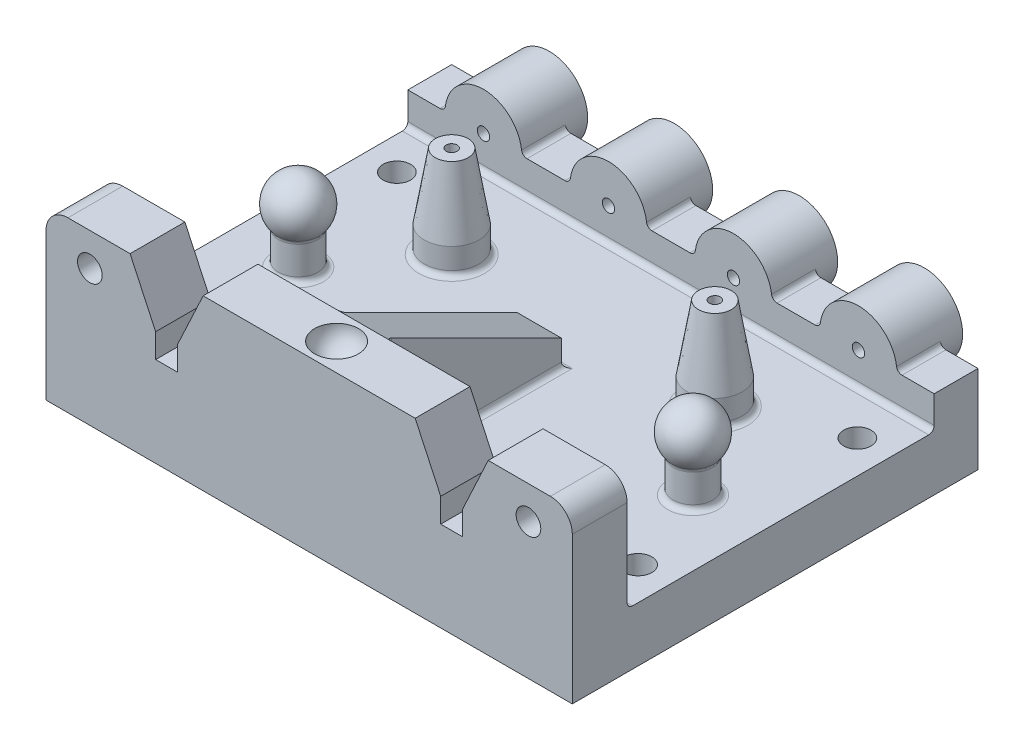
ISO-10303-21;
HEADER;
FILE_DESCRIPTION(('STEP AP214'),'2;1');
FILE_NAME('part.step','',(''),(''),'','','');
FILE_SCHEMA(('AUTOMOTIVE_DESIGN { 1 0 10303 214 1 1 1 1 }'));
ENDSEC;
DATA;
#1=APPLICATION_CONTEXT('core data for automotive mechanical design processes');
#2=APPLICATION_PROTOCOL_DEFINITION('international standard','automotive_design',2000,#1);
#3=PRODUCT_CONTEXT('',#1,'mechanical');
#4=PRODUCT('Part','Part','',(#3));
#5=PRODUCT_RELATED_PRODUCT_CATEGORY('part','',(#4));
#6=PRODUCT_DEFINITION_FORMATION('','',#4);
#7=PRODUCT_DEFINITION_CONTEXT('part definition',#1,'design');
#8=PRODUCT_DEFINITION('design','',#6,#7);
#9=PRODUCT_DEFINITION_SHAPE('','',#8);
#10=(LENGTH_UNIT() NAMED_UNIT(*) SI_UNIT(.MILLI.,.METRE.));
#11=(NAMED_UNIT(*) PLANE_ANGLE_UNIT() SI_UNIT($,.RADIAN.));
#12=(NAMED_UNIT(*) SI_UNIT($,.STERADIAN.) SOLID_ANGLE_UNIT());
#13=UNCERTAINTY_MEASURE_WITH_UNIT(LENGTH_MEASURE(1.E-05),#10,'distance_accuracy_value','');
#14=(GEOMETRIC_REPRESENTATION_CONTEXT(3) GLOBAL_UNCERTAINTY_ASSIGNED_CONTEXT((#13)) GLOBAL_UNIT_ASSIGNED_CONTEXT((#10,
#11,#12)) REPRESENTATION_CONTEXT('',''));
#15=CARTESIAN_POINT('',(0.,0.,0.));
#16=DIRECTION('',(0.,0.,1.));
#17=DIRECTION('',(1.,0.,0.));
#18=AXIS2_PLACEMENT_3D('',#15,#16,#17);
#19=CARTESIAN_POINT('',(-152.4,97.79,0.));
#20=DIRECTION('',(0.,1.,0.));
#21=DIRECTION('',(0.,0.,1.));
#22=AXIS2_PLACEMENT_3D('',#19,#20,#21);
#23=PLANE('',#22);
#24=DIRECTION('',(1.,0.,0.));
#25=VECTOR('',#24,1.);
#26=CARTESIAN_POINT('',(-152.4,97.79,0.));
#27=LINE('',#26,#25);
#28=CARTESIAN_POINT('',(103.705268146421,97.79,0.));
#29=VERTEX_POINT('',#28);
#30=CARTESIAN_POINT('',(139.7,97.79,0.));
#31=VERTEX_POINT('',#30);
#32=EDGE_CURVE('E1043',#29,#31,#27,.T.);
#33=ORIENTED_EDGE('',*,*,#32,.T.);
#34=DIRECTION('',(0.,0.,1.));
#35=VECTOR('',#34,1.);
#36=CARTESIAN_POINT('',(139.7,97.79,-31.75));
#37=LINE('',#36,#35);
#38=CARTESIAN_POINT('',(139.7,97.79,-31.75));
#39=VERTEX_POINT('',#38);
#40=EDGE_CURVE('E1156',#31,#39,#37,.F.);
#41=ORIENTED_EDGE('',*,*,#40,.T.);
#42=DIRECTION('',(1.,0.,0.));
#43=VECTOR('',#42,1.);
#44=CARTESIAN_POINT('',(-152.4,97.79,-31.75));
#45=LINE('',#44,#43);
#46=CARTESIAN_POINT('',(103.705268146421,97.79,-31.75));
#47=VERTEX_POINT('',#46);
#48=EDGE_CURVE('E1052',#47,#39,#45,.T.);
#49=ORIENTED_EDGE('',*,*,#48,.F.);
#50=DIRECTION('',(0.,0.,-1.));
#51=VECTOR('',#50,1.);
#52=CARTESIAN_POINT('',(103.705268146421,97.79,0.001000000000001));
#53=LINE('',#52,#51);
#54=EDGE_CURVE('E834',#29,#47,#53,.T.);
#55=ORIENTED_EDGE('',*,*,#54,.F.);
#56=EDGE_LOOP('',(#33,#41,#49,#55));
#57=FACE_BOUND('',#56,.T.);
#58=ADVANCED_FACE('F34',(#57),#23,.T.);
#59=CARTESIAN_POINT('',(-152.4,50.8,-209.55));
#60=DIRECTION('',(0.,1.,0.));
#61=DIRECTION('',(0.,0.,1.));
#62=AXIS2_PLACEMENT_3D('',#59,#60,#61);
#63=PLANE('',#62);
#64=DIRECTION('',(1.,0.,0.));
#65=VECTOR('',#64,1.);
#66=CARTESIAN_POINT('',(-152.4,50.8,-234.95));
#67=LINE('',#66,#65);
#68=CARTESIAN_POINT('',(-83.3842187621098,50.8,-234.95));
#69=VERTEX_POINT('',#68);
#70=CARTESIAN_POINT('',(-61.3957812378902,50.8,-234.95));
#71=VERTEX_POINT('',#70);
#72=EDGE_CURVE('E1059',#69,#71,#67,.T.);
#73=ORIENTED_EDGE('',*,*,#72,.F.);
#74=DIRECTION('',(0.,0.,-1.));
#75=VECTOR('',#74,1.);
#76=CARTESIAN_POINT('',(-83.3842187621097,50.8,-209.55));
#77=LINE('',#76,#75);
#78=CARTESIAN_POINT('',(-83.3842187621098,50.8,-209.55));
#79=VERTEX_POINT('',#78);
#80=EDGE_CURVE('E1172',#69,#79,#77,.F.);
#81=ORIENTED_EDGE('',*,*,#80,.T.);
#82=DIRECTION('',(1.,0.,0.));
#83=VECTOR('',#82,1.);
#84=CARTESIAN_POINT('',(-152.4,50.8,-209.55));
#85=LINE('',#84,#83);
#86=CARTESIAN_POINT('',(-61.3957812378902,50.8,-209.55));
#87=VERTEX_POINT('',#86);
#88=EDGE_CURVE('E1054',#79,#87,#85,.T.);
#89=ORIENTED_EDGE('',*,*,#88,.T.);
#90=DIRECTION('',(0.,0.,-1.));
#91=VECTOR('',#90,1.);
#92=CARTESIAN_POINT('',(-61.3957812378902,50.8,-209.55));
#93=LINE('',#92,#91);
#94=EDGE_CURVE('E1169',#87,#71,#93,.T.);
#95=ORIENTED_EDGE('',*,*,#94,.T.);
#96=EDGE_LOOP('',(#73,#81,#89,#95));
#97=FACE_BOUND('',#96,.T.);
#98=ADVANCED_FACE('F1467',(#97),#63,.T.);
#99=CARTESIAN_POINT('',(-108.585,50.8,-247.65));
#100=DIRECTION('',(0.,0.,-1.));
#101=DIRECTION('',(-1.,0.,0.));
#102=AXIS2_PLACEMENT_3D('',#99,#100,#101);
#103=CYLINDRICAL_SURFACE('',#102,3.56869999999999);
#104=CARTESIAN_POINT('',(-108.585,50.8,-209.55));
#105=DIRECTION('',(0.,0.,-1.));
#106=DIRECTION('',(-1.,0.,0.));
#107=AXIS2_PLACEMENT_3D('',#104,#105,#106);
#108=CIRCLE('',#107,3.56869999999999);
#109=CARTESIAN_POINT('',(-112.1537,50.8,-209.55));
#110=VERTEX_POINT('',#109);
#111=EDGE_CURVE('E1138',#110,#110,#108,.T.);
#112=ORIENTED_EDGE('',*,*,#111,.F.);
#113=EDGE_LOOP('',(#112));
#114=FACE_BOUND('',#113,.T.);
#115=CARTESIAN_POINT('',(-108.585,50.8,-239.7125));
#116=DIRECTION('',(0.,0.,-1.));
#117=DIRECTION('',(-1.,0.,0.));
#118=AXIS2_PLACEMENT_3D('',#115,#116,#117);
#119=CIRCLE('',#118,3.56869999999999);
#120=CARTESIAN_POINT('',(-112.1537,50.8,-239.7125));
#121=VERTEX_POINT('',#120);
#122=EDGE_CURVE('E1135',#121,#121,#119,.T.);
#123=ORIENTED_EDGE('',*,*,#122,.T.);
#124=EDGE_LOOP('',(#123));
#125=FACE_BOUND('',#124,.T.);
#126=ADVANCED_FACE('F1472',(#114,#125),#103,.F.);
#127=CARTESIAN_POINT('',(-105.0163,50.8,-239.7125));
#128=DIRECTION('',(0.,0.,1.));
#129=DIRECTION('',(1.,0.,0.));
#130=AXIS2_PLACEMENT_3D('',#127,#128,#129);
#131=PLANE('',#130);
#132=ORIENTED_EDGE('',*,*,#122,.F.);
#133=EDGE_LOOP('',(#132));
#134=FACE_BOUND('',#133,.T.);
#135=CARTESIAN_POINT('',(-108.585,50.8,-239.7125));
#136=DIRECTION('',(0.,0.,-1.));
#137=DIRECTION('',(-1.,0.,0.));
#138=AXIS2_PLACEMENT_3D('',#135,#136,#137);
#139=CIRCLE('',#138,5.08);
#140=CARTESIAN_POINT('',(-113.665,50.8,-239.7125));
#141=VERTEX_POINT('',#140);
#142=EDGE_CURVE('E1132',#141,#141,#139,.T.);
#143=ORIENTED_EDGE('',*,*,#142,.T.);
#144=EDGE_LOOP('',(#143));
#145=FACE_BOUND('',#144,.T.);
#146=ADVANCED_FACE('F1570',(#134,#145),#131,.F.);
#147=CARTESIAN_POINT('',(-108.585,50.8,-247.65));
#148=DIRECTION('',(0.,0.,-1.));
#149=DIRECTION('',(-1.,0.,0.));
#150=AXIS2_PLACEMENT_3D('',#147,#148,#149);
#151=CYLINDRICAL_SURFACE('',#150,5.08);
#152=ORIENTED_EDGE('',*,*,#142,.F.);
#153=EDGE_LOOP('',(#152));
#154=FACE_BOUND('',#153,.T.);
#155=CARTESIAN_POINT('',(-108.585,50.8,-247.65));
#156=DIRECTION('',(0.,0.,-1.));
#157=DIRECTION('',(-1.,0.,0.));
#158=AXIS2_PLACEMENT_3D('',#155,#156,#157);
#159=CIRCLE('',#158,5.08);
#160=CARTESIAN_POINT('',(-113.665,50.8,-247.65));
#161=VERTEX_POINT('',#160);
#162=EDGE_CURVE('E1121',#161,#161,#159,.T.);
#163=ORIENTED_EDGE('',*,*,#162,.T.);
#164=EDGE_LOOP('',(#163));
#165=FACE_BOUND('',#164,.T.);
#166=ADVANCED_FACE('F1566',(#154,#165),#151,.F.);
#167=CARTESIAN_POINT('',(-108.585,50.8,-209.55));
#168=DIRECTION('',(0.,0.,-1.));
#169=DIRECTION('',(-1.,0.,0.));
#170=AXIS2_PLACEMENT_3D('',#167,#168,#169);
#171=CYLINDRICAL_SURFACE('',#170,22.225);
#172=CARTESIAN_POINT('',(-108.585,50.8,-234.95));
#173=DIRECTION('',(0.,0.,-1.));
#174=DIRECTION('',(-1.,0.,0.));
#175=AXIS2_PLACEMENT_3D('',#172,#173,#174);
#176=CIRCLE('',#175,22.225);
#177=CARTESIAN_POINT('',(-130.635683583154,53.578125,-234.95));
#178=VERTEX_POINT('',#177);
#179=CARTESIAN_POINT('',(-86.534316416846,53.578125,-234.95));
#180=VERTEX_POINT('',#179);
#181=EDGE_CURVE('E1127',#178,#180,#176,.F.);
#182=ORIENTED_EDGE('',*,*,#181,.F.);
#183=DIRECTION('',(0.,0.,-1.));
#184=VECTOR('',#183,1.);
#185=CARTESIAN_POINT('',(-130.635683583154,53.578125,-209.55));
#186=LINE('',#185,#184);
#187=CARTESIAN_POINT('',(-130.635683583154,53.578125,-209.55));
#188=VERTEX_POINT('',#187);
#189=EDGE_CURVE('E1167',#178,#188,#186,.F.);
#190=ORIENTED_EDGE('',*,*,#189,.T.);
#191=CARTESIAN_POINT('',(-108.585,50.8,-209.55));
#192=DIRECTION('',(0.,0.,1.));
#193=DIRECTION('',(1.,0.,0.));
#194=AXIS2_PLACEMENT_3D('',#191,#192,#193);
#195=CIRCLE('',#194,22.225);
#196=CARTESIAN_POINT('',(-86.534316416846,53.578125,-209.55));
#197=VERTEX_POINT('',#196);
#198=EDGE_CURVE('E1129',#197,#188,#195,.T.);
#199=ORIENTED_EDGE('',*,*,#198,.F.);
#200=DIRECTION('',(0.,0.,-1.));
#201=VECTOR('',#200,1.);
#202=CARTESIAN_POINT('',(-86.534316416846,53.578125,-209.55));
#203=LINE('',#202,#201);
#204=EDGE_CURVE('E1164',#197,#180,#203,.T.);
#205=ORIENTED_EDGE('',*,*,#204,.T.);
#206=EDGE_LOOP('',(#182,#190,#199,#205));
#207=FACE_BOUND('',#206,.T.);
#208=CARTESIAN_POINT('',(-108.585,50.8,-247.65));
#209=DIRECTION('',(0.,0.,1.));
#210=DIRECTION('',(1.,0.,0.));
#211=AXIS2_PLACEMENT_3D('',#208,#209,#210);
#212=CIRCLE('',#211,22.225);
#213=CARTESIAN_POINT('',(-86.36,50.8,-247.65));
#214=VERTEX_POINT('',#213);
#215=EDGE_CURVE('E1124',#214,#214,#212,.T.);
#216=ORIENTED_EDGE('',*,*,#215,.T.);
#217=EDGE_LOOP('',(#216));
#218=FACE_BOUND('',#217,.T.);
#219=ADVANCED_FACE('F1562',(#207,#218),#171,.T.);
#220=CARTESIAN_POINT('',(-108.585,50.8,-247.65));
#221=DIRECTION('',(0.,0.,1.));
#222=DIRECTION('',(1.,0.,0.));
#223=AXIS2_PLACEMENT_3D('',#220,#221,#222);
#224=PLANE('',#223);
#225=ORIENTED_EDGE('',*,*,#162,.F.);
#226=EDGE_LOOP('',(#225));
#227=FACE_BOUND('',#226,.T.);
#228=ORIENTED_EDGE('',*,*,#215,.F.);
#229=EDGE_LOOP('',(#228));
#230=FACE_BOUND('',#229,.T.);
#231=ADVANCED_FACE('F1559',(#227,#230),#224,.F.);
#232=CARTESIAN_POINT('',(-10.9942187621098,50.8,-234.95));
#233=VERTEX_POINT('',#232);
#234=CARTESIAN_POINT('',(10.9942187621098,50.8,-234.95));
#235=VERTEX_POINT('',#234);
#236=EDGE_CURVE('E1099',#233,#235,#67,.T.);
#237=ORIENTED_EDGE('',*,*,#236,.F.);
#238=DIRECTION('',(0.,0.,-1.));
#239=VECTOR('',#238,1.);
#240=CARTESIAN_POINT('',(-10.9942187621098,50.8,-209.55));
#241=LINE('',#240,#239);
#242=CARTESIAN_POINT('',(-10.9942187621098,50.8,-209.55));
#243=VERTEX_POINT('',#242);
#244=EDGE_CURVE('E1183',#233,#243,#241,.F.);
#245=ORIENTED_EDGE('',*,*,#244,.T.);
#246=CARTESIAN_POINT('',(10.9942187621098,50.8,-209.55));
#247=VERTEX_POINT('',#246);
#248=EDGE_CURVE('E1104',#243,#247,#85,.T.);
#249=ORIENTED_EDGE('',*,*,#248,.T.);
#250=DIRECTION('',(0.,0.,-1.));
#251=VECTOR('',#250,1.);
#252=CARTESIAN_POINT('',(10.9942187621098,50.8,-209.55));
#253=LINE('',#252,#251);
#254=EDGE_CURVE('E1180',#247,#235,#253,.T.);
#255=ORIENTED_EDGE('',*,*,#254,.T.);
#256=EDGE_LOOP('',(#237,#245,#249,#255));
#257=FACE_BOUND('',#256,.T.);
#258=ADVANCED_FACE('F1475',(#257),#63,.T.);
#259=CARTESIAN_POINT('',(-36.195,50.8,-247.65));
#260=DIRECTION('',(0.,0.,-1.));
#261=DIRECTION('',(-1.,0.,0.));
#262=AXIS2_PLACEMENT_3D('',#259,#260,#261);
#263=CYLINDRICAL_SURFACE('',#262,3.56869999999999);
#264=CARTESIAN_POINT('',(-36.195,50.8,-209.55));
#265=DIRECTION('',(0.,0.,-1.));
#266=DIRECTION('',(-1.,0.,0.));
#267=AXIS2_PLACEMENT_3D('',#264,#265,#266);
#268=CIRCLE('',#267,3.56869999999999);
#269=CARTESIAN_POINT('',(-39.7637,50.8,-209.55));
#270=VERTEX_POINT('',#269);
#271=EDGE_CURVE('E1118',#270,#270,#268,.T.);
#272=ORIENTED_EDGE('',*,*,#271,.F.);
#273=EDGE_LOOP('',(#272));
#274=FACE_BOUND('',#273,.T.);
#275=CARTESIAN_POINT('',(-36.195,50.8,-239.7125));
#276=DIRECTION('',(0.,0.,-1.));
#277=DIRECTION('',(-1.,0.,0.));
#278=AXIS2_PLACEMENT_3D('',#275,#276,#277);
#279=CIRCLE('',#278,3.56869999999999);
#280=CARTESIAN_POINT('',(-39.7637,50.8,-239.7125));
#281=VERTEX_POINT('',#280);
#282=EDGE_CURVE('E1115',#281,#281,#279,.T.);
#283=ORIENTED_EDGE('',*,*,#282,.T.);
#284=EDGE_LOOP('',(#283));
#285=FACE_BOUND('',#284,.T.);
#286=ADVANCED_FACE('F1554',(#274,#285),#263,.F.);
#287=CARTESIAN_POINT('',(-32.6263,50.8,-239.7125));
#288=DIRECTION('',(0.,0.,1.));
#289=DIRECTION('',(1.,0.,0.));
#290=AXIS2_PLACEMENT_3D('',#287,#288,#289);
#291=PLANE('',#290);
#292=ORIENTED_EDGE('',*,*,#282,.F.);
#293=EDGE_LOOP('',(#292));
#294=FACE_BOUND('',#293,.T.);
#295=CARTESIAN_POINT('',(-36.195,50.8,-239.7125));
#296=DIRECTION('',(0.,0.,-1.));
#297=DIRECTION('',(-1.,0.,0.));
#298=AXIS2_PLACEMENT_3D('',#295,#296,#297);
#299=CIRCLE('',#298,5.08);
#300=CARTESIAN_POINT('',(-41.275,50.8,-239.7125));
#301=VERTEX_POINT('',#300);
#302=EDGE_CURVE('E1112',#301,#301,#299,.T.);
#303=ORIENTED_EDGE('',*,*,#302,.T.);
#304=EDGE_LOOP('',(#303));
#305=FACE_BOUND('',#304,.T.);
#306=ADVANCED_FACE('F1550',(#294,#305),#291,.F.);
#307=CARTESIAN_POINT('',(-36.195,50.8,-247.65));
#308=DIRECTION('',(0.,0.,-1.));
#309=DIRECTION('',(-1.,0.,0.));
#310=AXIS2_PLACEMENT_3D('',#307,#308,#309);
#311=CYLINDRICAL_SURFACE('',#310,5.08);
#312=ORIENTED_EDGE('',*,*,#302,.F.);
#313=EDGE_LOOP('',(#312));
#314=FACE_BOUND('',#313,.T.);
#315=CARTESIAN_POINT('',(-36.195,50.8,-247.65));
#316=DIRECTION('',(0.,0.,-1.));
#317=DIRECTION('',(-1.,0.,0.));
#318=AXIS2_PLACEMENT_3D('',#315,#316,#317);
#319=CIRCLE('',#318,5.08);
#320=CARTESIAN_POINT('',(-41.275,50.8,-247.65));
#321=VERTEX_POINT('',#320);
#322=EDGE_CURVE('E1100',#321,#321,#319,.T.);
#323=ORIENTED_EDGE('',*,*,#322,.T.);
#324=EDGE_LOOP('',(#323));
#325=FACE_BOUND('',#324,.T.);
#326=ADVANCED_FACE('F1546',(#314,#325),#311,.F.);
#327=CARTESIAN_POINT('',(-36.195,50.8,-209.55));
#328=DIRECTION('',(0.,0.,-1.));
#329=DIRECTION('',(-1.,0.,0.));
#330=AXIS2_PLACEMENT_3D('',#327,#328,#329);
#331=CYLINDRICAL_SURFACE('',#330,22.225);
#332=CARTESIAN_POINT('',(-36.195,50.8,-234.95));
#333=DIRECTION('',(0.,0.,-1.));
#334=DIRECTION('',(-1.,0.,0.));
#335=AXIS2_PLACEMENT_3D('',#332,#333,#334);
#336=CIRCLE('',#335,22.225);
#337=CARTESIAN_POINT('',(-58.2456835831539,53.578125,-234.95));
#338=VERTEX_POINT('',#337);
#339=CARTESIAN_POINT('',(-14.144316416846,53.578125,-234.95));
#340=VERTEX_POINT('',#339);
#341=EDGE_CURVE('E1107',#338,#340,#336,.F.);
#342=ORIENTED_EDGE('',*,*,#341,.F.);
#343=DIRECTION('',(0.,0.,-1.));
#344=VECTOR('',#343,1.);
#345=CARTESIAN_POINT('',(-58.2456835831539,53.578125,-209.55));
#346=LINE('',#345,#344);
#347=CARTESIAN_POINT('',(-58.2456835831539,53.578125,-209.55));
#348=VERTEX_POINT('',#347);
#349=EDGE_CURVE('E1178',#338,#348,#346,.F.);
#350=ORIENTED_EDGE('',*,*,#349,.T.);
#351=CARTESIAN_POINT('',(-36.195,50.8,-209.55));
#352=DIRECTION('',(0.,0.,1.));
#353=DIRECTION('',(1.,0.,0.));
#354=AXIS2_PLACEMENT_3D('',#351,#352,#353);
#355=CIRCLE('',#354,22.225);
#356=CARTESIAN_POINT('',(-14.144316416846,53.578125,-209.55));
#357=VERTEX_POINT('',#356);
#358=EDGE_CURVE('E1109',#357,#348,#355,.T.);
#359=ORIENTED_EDGE('',*,*,#358,.F.);
#360=DIRECTION('',(0.,0.,-1.));
#361=VECTOR('',#360,1.);
#362=CARTESIAN_POINT('',(-14.144316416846,53.578125,-209.55));
#363=LINE('',#362,#361);
#364=EDGE_CURVE('E1175',#357,#340,#363,.T.);
#365=ORIENTED_EDGE('',*,*,#364,.T.);
#366=EDGE_LOOP('',(#342,#350,#359,#365));
#367=FACE_BOUND('',#366,.T.);
#368=CARTESIAN_POINT('',(-36.195,50.8,-247.65));
#369=DIRECTION('',(0.,0.,1.));
#370=DIRECTION('',(1.,0.,0.));
#371=AXIS2_PLACEMENT_3D('',#368,#369,#370);
#372=CIRCLE('',#371,22.225);
#373=CARTESIAN_POINT('',(-13.97,50.8,-247.65));
#374=VERTEX_POINT('',#373);
#375=EDGE_CURVE('E1103',#374,#374,#372,.T.);
#376=ORIENTED_EDGE('',*,*,#375,.T.);
#377=EDGE_LOOP('',(#376));
#378=FACE_BOUND('',#377,.T.);
#379=ADVANCED_FACE('F1542',(#367,#378),#331,.T.);
#380=CARTESIAN_POINT('',(-36.195,50.8,-247.65));
#381=DIRECTION('',(0.,0.,1.));
#382=DIRECTION('',(1.,0.,0.));
#383=AXIS2_PLACEMENT_3D('',#380,#381,#382);
#384=PLANE('',#383);
#385=ORIENTED_EDGE('',*,*,#322,.F.);
#386=EDGE_LOOP('',(#385));
#387=FACE_BOUND('',#386,.T.);
#388=ORIENTED_EDGE('',*,*,#375,.F.);
#389=EDGE_LOOP('',(#388));
#390=FACE_BOUND('',#389,.T.);
#391=ADVANCED_FACE('F1539',(#387,#390),#384,.F.);
#392=CARTESIAN_POINT('',(61.3957812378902,50.8,-234.95));
#393=VERTEX_POINT('',#392);
#394=CARTESIAN_POINT('',(83.3842187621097,50.8,-234.95));
#395=VERTEX_POINT('',#394);
#396=EDGE_CURVE('E1077',#393,#395,#67,.T.);
#397=ORIENTED_EDGE('',*,*,#396,.F.);
#398=DIRECTION('',(0.,0.,-1.));
#399=VECTOR('',#398,1.);
#400=CARTESIAN_POINT('',(61.3957812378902,50.8,-209.55));
#401=LINE('',#400,#399);
#402=CARTESIAN_POINT('',(61.3957812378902,50.8,-209.55));
#403=VERTEX_POINT('',#402);
#404=EDGE_CURVE('E1194',#393,#403,#401,.F.);
#405=ORIENTED_EDGE('',*,*,#404,.T.);
#406=CARTESIAN_POINT('',(83.3842187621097,50.8,-209.55));
#407=VERTEX_POINT('',#406);
#408=EDGE_CURVE('E1082',#403,#407,#85,.T.);
#409=ORIENTED_EDGE('',*,*,#408,.T.);
#410=DIRECTION('',(0.,0.,-1.));
#411=VECTOR('',#410,1.);
#412=CARTESIAN_POINT('',(83.3842187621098,50.8,-209.55));
#413=LINE('',#412,#411);
#414=EDGE_CURVE('E1191',#407,#395,#413,.T.);
#415=ORIENTED_EDGE('',*,*,#414,.T.);
#416=EDGE_LOOP('',(#397,#405,#409,#415));
#417=FACE_BOUND('',#416,.T.);
#418=ADVANCED_FACE('F1537',(#417),#63,.T.);
#419=CARTESIAN_POINT('',(36.195,50.8,-247.65));
#420=DIRECTION('',(0.,0.,-1.));
#421=DIRECTION('',(-1.,0.,0.));
#422=AXIS2_PLACEMENT_3D('',#419,#420,#421);
#423=CYLINDRICAL_SURFACE('',#422,3.56869999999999);
#424=CARTESIAN_POINT('',(36.195,50.8,-209.55));
#425=DIRECTION('',(0.,0.,-1.));
#426=DIRECTION('',(-1.,0.,0.));
#427=AXIS2_PLACEMENT_3D('',#424,#425,#426);
#428=CIRCLE('',#427,3.56869999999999);
#429=CARTESIAN_POINT('',(32.6263,50.8,-209.55));
#430=VERTEX_POINT('',#429);
#431=EDGE_CURVE('E1096',#430,#430,#428,.T.);
#432=ORIENTED_EDGE('',*,*,#431,.F.);
#433=EDGE_LOOP('',(#432));
#434=FACE_BOUND('',#433,.T.);
#435=CARTESIAN_POINT('',(36.195,50.8,-239.7125));
#436=DIRECTION('',(0.,0.,-1.));
#437=DIRECTION('',(-1.,0.,0.));
#438=AXIS2_PLACEMENT_3D('',#435,#436,#437);
#439=CIRCLE('',#438,3.56869999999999);
#440=CARTESIAN_POINT('',(32.6263,50.8,-239.7125));
#441=VERTEX_POINT('',#440);
#442=EDGE_CURVE('E1093',#441,#441,#439,.T.);
#443=ORIENTED_EDGE('',*,*,#442,.T.);
#444=EDGE_LOOP('',(#443));
#445=FACE_BOUND('',#444,.T.);
#446=ADVANCED_FACE('F1533',(#434,#445),#423,.F.);
#447=CARTESIAN_POINT('',(39.7637,50.8,-239.7125));
#448=DIRECTION('',(0.,0.,1.));
#449=DIRECTION('',(1.,0.,0.));
#450=AXIS2_PLACEMENT_3D('',#447,#448,#449);
#451=PLANE('',#450);
#452=ORIENTED_EDGE('',*,*,#442,.F.);
#453=EDGE_LOOP('',(#452));
#454=FACE_BOUND('',#453,.T.);
#455=CARTESIAN_POINT('',(36.195,50.8,-239.7125));
#456=DIRECTION('',(0.,0.,-1.));
#457=DIRECTION('',(-1.,0.,0.));
#458=AXIS2_PLACEMENT_3D('',#455,#456,#457);
#459=CIRCLE('',#458,5.08);
#460=CARTESIAN_POINT('',(31.115,50.8,-239.7125));
#461=VERTEX_POINT('',#460);
#462=EDGE_CURVE('E1090',#461,#461,#459,.T.);
#463=ORIENTED_EDGE('',*,*,#462,.T.);
#464=EDGE_LOOP('',(#463));
#465=FACE_BOUND('',#464,.T.);
#466=ADVANCED_FACE('F1529',(#454,#465),#451,.F.);
#467=CARTESIAN_POINT('',(36.195,50.8,-247.65));
#468=DIRECTION('',(0.,0.,-1.));
#469=DIRECTION('',(-1.,0.,0.));
#470=AXIS2_PLACEMENT_3D('',#467,#468,#469);
#471=CYLINDRICAL_SURFACE('',#470,5.08);
#472=ORIENTED_EDGE('',*,*,#462,.F.);
#473=EDGE_LOOP('',(#472));
#474=FACE_BOUND('',#473,.T.);
#475=CARTESIAN_POINT('',(36.195,50.8,-247.65));
#476=DIRECTION('',(0.,0.,-1.));
#477=DIRECTION('',(-1.,0.,0.));
#478=AXIS2_PLACEMENT_3D('',#475,#476,#477);
#479=CIRCLE('',#478,5.08);
#480=CARTESIAN_POINT('',(31.115,50.8,-247.65));
#481=VERTEX_POINT('',#480);
#482=EDGE_CURVE('E1078',#481,#481,#479,.T.);
#483=ORIENTED_EDGE('',*,*,#482,.T.);
#484=EDGE_LOOP('',(#483));
#485=FACE_BOUND('',#484,.T.);
#486=ADVANCED_FACE('F1525',(#474,#485),#471,.F.);
#487=CARTESIAN_POINT('',(36.195,50.8,-209.55));
#488=DIRECTION('',(0.,0.,-1.));
#489=DIRECTION('',(-1.,0.,0.));
#490=AXIS2_PLACEMENT_3D('',#487,#488,#489);
#491=CYLINDRICAL_SURFACE('',#490,22.225);
#492=CARTESIAN_POINT('',(36.195,50.8,-234.95));
#493=DIRECTION('',(0.,0.,-1.));
#494=DIRECTION('',(-1.,0.,0.));
#495=AXIS2_PLACEMENT_3D('',#492,#493,#494);
#496=CIRCLE('',#495,22.225);
#497=CARTESIAN_POINT('',(14.1443164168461,53.578125,-234.95));
#498=VERTEX_POINT('',#497);
#499=CARTESIAN_POINT('',(58.245683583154,53.578125,-234.95));
#500=VERTEX_POINT('',#499);
#501=EDGE_CURVE('E1085',#498,#500,#496,.F.);
#502=ORIENTED_EDGE('',*,*,#501,.F.);
#503=DIRECTION('',(0.,0.,-1.));
#504=VECTOR('',#503,1.);
#505=CARTESIAN_POINT('',(14.1443164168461,53.578125,-209.55));
#506=LINE('',#505,#504);
#507=CARTESIAN_POINT('',(14.1443164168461,53.578125,-209.55));
#508=VERTEX_POINT('',#507);
#509=EDGE_CURVE('E1189',#498,#508,#506,.F.);
#510=ORIENTED_EDGE('',*,*,#509,.T.);
#511=CARTESIAN_POINT('',(36.195,50.8,-209.55));
#512=DIRECTION('',(0.,0.,1.));
#513=DIRECTION('',(1.,0.,0.));
#514=AXIS2_PLACEMENT_3D('',#511,#512,#513);
#515=CIRCLE('',#514,22.225);
#516=CARTESIAN_POINT('',(58.245683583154,53.578125,-209.55));
#517=VERTEX_POINT('',#516);
#518=EDGE_CURVE('E1087',#517,#508,#515,.T.);
#519=ORIENTED_EDGE('',*,*,#518,.F.);
#520=DIRECTION('',(0.,0.,-1.));
#521=VECTOR('',#520,1.);
#522=CARTESIAN_POINT('',(58.245683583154,53.578125,-209.55));
#523=LINE('',#522,#521);
#524=EDGE_CURVE('E1186',#517,#500,#523,.T.);
#525=ORIENTED_EDGE('',*,*,#524,.T.);
#526=EDGE_LOOP('',(#502,#510,#519,#525));
#527=FACE_BOUND('',#526,.T.);
#528=CARTESIAN_POINT('',(36.195,50.8,-247.65));
#529=DIRECTION('',(0.,0.,1.));
#530=DIRECTION('',(1.,0.,0.));
#531=AXIS2_PLACEMENT_3D('',#528,#529,#530);
#532=CIRCLE('',#531,22.225);
#533=CARTESIAN_POINT('',(58.42,50.8,-247.65));
#534=VERTEX_POINT('',#533);
#535=EDGE_CURVE('E1081',#534,#534,#532,.T.);
#536=ORIENTED_EDGE('',*,*,#535,.T.);
#537=EDGE_LOOP('',(#536));
#538=FACE_BOUND('',#537,.T.);
#539=ADVANCED_FACE('F1521',(#527,#538),#491,.T.);
#540=CARTESIAN_POINT('',(36.195,50.8,-247.65));
#541=DIRECTION('',(0.,0.,1.));
#542=DIRECTION('',(1.,0.,0.));
#543=AXIS2_PLACEMENT_3D('',#540,#541,#542);
#544=PLANE('',#543);
#545=ORIENTED_EDGE('',*,*,#482,.F.);
#546=EDGE_LOOP('',(#545));
#547=FACE_BOUND('',#546,.T.);
#548=ORIENTED_EDGE('',*,*,#535,.F.);
#549=EDGE_LOOP('',(#548));
#550=FACE_BOUND('',#549,.T.);
#551=ADVANCED_FACE('F1517',(#547,#550),#544,.F.);
#552=CARTESIAN_POINT('',(-76.2,-13.1512806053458,-158.75));
#553=DIRECTION('',(0.,1.,0.));
#554=DIRECTION('',(0.,0.,1.));
#555=AXIS2_PLACEMENT_3D('',#552,#553,#554);
#556=CYLINDRICAL_SURFACE('',#555,15.875);
#557=CARTESIAN_POINT('',(-76.2,34.925,-158.75));
#558=DIRECTION('',(0.,1.,0.));
#559=DIRECTION('',(0.,0.,1.));
#560=AXIS2_PLACEMENT_3D('',#557,#558,#559);
#561=CIRCLE('',#560,15.875);
#562=CARTESIAN_POINT('',(-76.2,34.925,-142.875));
#563=VERTEX_POINT('',#562);
#564=EDGE_CURVE('E1241',#563,#563,#561,.T.);
#565=ORIENTED_EDGE('',*,*,#564,.T.);
#566=EDGE_LOOP('',(#565));
#567=FACE_BOUND('',#566,.T.);
#568=CARTESIAN_POINT('',(-76.2,46.99,-158.75));
#569=DIRECTION('',(0.,1.,0.));
#570=DIRECTION('',(0.,0.,1.));
#571=AXIS2_PLACEMENT_3D('',#568,#569,#570);
#572=CIRCLE('',#571,15.875);
#573=CARTESIAN_POINT('',(-76.2,46.99,-142.875));
#574=VERTEX_POINT('',#573);
#575=EDGE_CURVE('E1074',#574,#574,#572,.T.);
#576=ORIENTED_EDGE('',*,*,#575,.F.);
#577=EDGE_LOOP('',(#576));
#578=FACE_BOUND('',#577,.T.);
#579=ADVANCED_FACE('F1513',(#567,#578),#556,.T.);
#580=CARTESIAN_POINT('',(-76.2,46.99,-158.75));
#581=DIRECTION('',(0.,-1.,0.));
#582=DIRECTION('',(0.,0.,-1.));
#583=AXIS2_PLACEMENT_3D('',#580,#581,#582);
#584=CONICAL_SURFACE('',#583,15.875,0.165148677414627);
#585=CARTESIAN_POINT('',(-76.2,85.09,-158.75));
#586=DIRECTION('',(0.,-1.,0.));
#587=DIRECTION('',(0.,0.,-1.));
#588=AXIS2_PLACEMENT_3D('',#585,#586,#587);
#589=CIRCLE('',#588,9.52500000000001);
#590=CARTESIAN_POINT('',(-76.2,85.09,-168.275));
#591=VERTEX_POINT('',#590);
#592=EDGE_CURVE('E1071',#591,#591,#589,.T.);
#593=ORIENTED_EDGE('',*,*,#592,.T.);
#594=EDGE_LOOP('',(#593));
#595=FACE_BOUND('',#594,.T.);
#596=ORIENTED_EDGE('',*,*,#575,.T.);
#597=EDGE_LOOP('',(#596));
#598=FACE_BOUND('',#597,.T.);
#599=ADVANCED_FACE('F1509',(#595,#598),#584,.T.);
#600=CARTESIAN_POINT('',(-76.2,85.09,-168.275));
#601=DIRECTION('',(0.,1.,0.));
#602=DIRECTION('',(0.,0.,1.));
#603=AXIS2_PLACEMENT_3D('',#600,#601,#602);
#604=PLANE('',#603);
#605=CARTESIAN_POINT('',(-76.2,85.09,-158.75));
#606=DIRECTION('',(0.,1.,0.));
#607=DIRECTION('',(0.,0.,1.));
#608=AXIS2_PLACEMENT_3D('',#605,#606,#607);
#609=CIRCLE('',#608,3.17499999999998);
#610=CARTESIAN_POINT('',(-76.2,85.09,-155.575));
#611=VERTEX_POINT('',#610);
#612=EDGE_CURVE('E1068',#611,#611,#609,.T.);
#613=ORIENTED_EDGE('',*,*,#612,.F.);
#614=EDGE_LOOP('',(#613));
#615=FACE_BOUND('',#614,.T.);
#616=ORIENTED_EDGE('',*,*,#592,.F.);
#617=EDGE_LOOP('',(#616));
#618=FACE_BOUND('',#617,.T.);
#619=ADVANCED_FACE('F1505',(#615,#618),#604,.T.);
#620=CARTESIAN_POINT('',(-76.2,72.39,-158.75));
#621=DIRECTION('',(0.,1.,0.));
#622=DIRECTION('',(0.,0.,1.));
#623=AXIS2_PLACEMENT_3D('',#620,#621,#622);
#624=CONICAL_SURFACE('',#623,3.175,1.02974425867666);
#625=CARTESIAN_POINT('',(-76.2,70.4822675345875,-158.75));
#626=VERTEX_POINT('',#625);
#627=VERTEX_LOOP('',#626);
#628=FACE_BOUND('',#627,.T.);
#629=CARTESIAN_POINT('',(-76.2,72.39,-158.75));
#630=DIRECTION('',(0.,1.,0.));
#631=DIRECTION('',(0.,0.,1.));
#632=AXIS2_PLACEMENT_3D('',#629,#630,#631);
#633=CIRCLE('',#632,3.175);
#634=CARTESIAN_POINT('',(-76.2,72.39,-155.575));
#635=VERTEX_POINT('',#634);
#636=EDGE_CURVE('E1065',#635,#635,#633,.T.);
#637=ORIENTED_EDGE('',*,*,#636,.T.);
#638=EDGE_LOOP('',(#637));
#639=FACE_BOUND('',#638,.T.);
#640=ADVANCED_FACE('F1501',(#628,#639),#624,.F.);
#641=CARTESIAN_POINT('',(-76.2,85.09,-158.75));
#642=DIRECTION('',(0.,1.,0.));
#643=DIRECTION('',(0.,0.,1.));
#644=AXIS2_PLACEMENT_3D('',#641,#642,#643);
#645=CYLINDRICAL_SURFACE('',#644,3.17499999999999);
#646=ORIENTED_EDGE('',*,*,#636,.F.);
#647=EDGE_LOOP('',(#646));
#648=FACE_BOUND('',#647,.T.);
#649=ORIENTED_EDGE('',*,*,#612,.T.);
#650=EDGE_LOOP('',(#649));
#651=FACE_BOUND('',#650,.T.);
#652=ADVANCED_FACE('F1498',(#648,#651),#645,.F.);
#653=CARTESIAN_POINT('',(-152.4,31.75,-31.75));
#654=DIRECTION('',(0.,1.,0.));
#655=DIRECTION('',(0.,0.,1.));
#656=AXIS2_PLACEMENT_3D('',#653,#654,#655);
#657=PLANE('',#656);
#658=CARTESIAN_POINT('',(-114.3,31.75,-107.95));
#659=DIRECTION('',(0.,1.,0.));
#660=DIRECTION('',(0.,0.,1.));
#661=AXIS2_PLACEMENT_3D('',#658,#659,#660);
#662=CIRCLE('',#661,14.605);
#663=CARTESIAN_POINT('',(-114.3,31.75,-93.345));
#664=VERTEX_POINT('',#663);
#665=EDGE_CURVE('E1227',#664,#664,#662,.F.);
#666=ORIENTED_EDGE('',*,*,#665,.T.);
#667=EDGE_LOOP('',(#666));
#668=FACE_BOUND('',#667,.T.);
#669=CARTESIAN_POINT('',(-76.2,31.75,-158.75));
#670=DIRECTION('',(0.,1.,0.));
#671=DIRECTION('',(0.,0.,1.));
#672=AXIS2_PLACEMENT_3D('',#669,#670,#671);
#673=CIRCLE('',#672,19.05);
#674=CARTESIAN_POINT('',(-76.2,31.75,-139.7));
#675=VERTEX_POINT('',#674);
#676=EDGE_CURVE('E1224',#675,#675,#673,.F.);
#677=ORIENTED_EDGE('',*,*,#676,.T.);
#678=EDGE_LOOP('',(#677));
#679=FACE_BOUND('',#678,.T.);
#680=CARTESIAN_POINT('',(76.2,31.75,-158.75));
#681=DIRECTION('',(0.,1.,0.));
#682=DIRECTION('',(0.,0.,1.));
#683=AXIS2_PLACEMENT_3D('',#680,#681,#682);
#684=CIRCLE('',#683,19.05);
#685=CARTESIAN_POINT('',(76.2,31.75,-139.7));
#686=VERTEX_POINT('',#685);
#687=EDGE_CURVE('E1221',#686,#686,#684,.F.);
#688=ORIENTED_EDGE('',*,*,#687,.T.);
#689=EDGE_LOOP('',(#688));
#690=FACE_BOUND('',#689,.T.);
#691=CARTESIAN_POINT('',(114.3,31.75,-107.95));
#692=DIRECTION('',(0.,1.,0.));
#693=DIRECTION('',(0.,0.,1.));
#694=AXIS2_PLACEMENT_3D('',#691,#692,#693);
#695=CIRCLE('',#694,14.605);
#696=CARTESIAN_POINT('',(114.3,31.75,-93.345));
#697=VERTEX_POINT('',#696);
#698=EDGE_CURVE('E1218',#697,#697,#695,.F.);
#699=ORIENTED_EDGE('',*,*,#698,.T.);
#700=EDGE_LOOP('',(#699));
#701=FACE_BOUND('',#700,.T.);
#702=DIRECTION('',(0.,0.,1.));
#703=VECTOR('',#702,1.);
#704=CARTESIAN_POINT('',(152.4,31.75,-31.75));
#705=LINE('',#704,#703);
#706=CARTESIAN_POINT('',(152.4,31.75,-206.375));
#707=VERTEX_POINT('',#706);
#708=CARTESIAN_POINT('',(152.4,31.75,-34.925));
#709=VERTEX_POINT('',#708);
#710=EDGE_CURVE('E1014',#707,#709,#705,.T.);
#711=ORIENTED_EDGE('',*,*,#710,.F.);
#712=DIRECTION('',(1.,0.,0.));
#713=VECTOR('',#712,1.);
#714=CARTESIAN_POINT('',(-152.4,31.75,-206.375));
#715=LINE('',#714,#713);
#716=CARTESIAN_POINT('',(-152.4,31.75,-206.375));
#717=VERTEX_POINT('',#716);
#718=EDGE_CURVE('E1230',#707,#717,#715,.F.);
#719=ORIENTED_EDGE('',*,*,#718,.T.);
#720=DIRECTION('',(0.,0.,1.));
#721=VECTOR('',#720,1.);
#722=CARTESIAN_POINT('',(-152.4,31.75,-31.75));
#723=LINE('',#722,#721);
#724=CARTESIAN_POINT('',(-152.4,31.75,-34.925));
#725=VERTEX_POINT('',#724);
#726=EDGE_CURVE('E1033',#717,#725,#723,.T.);
#727=ORIENTED_EDGE('',*,*,#726,.T.);
#728=DIRECTION('',(1.,0.,0.));
#729=VECTOR('',#728,1.);
#730=CARTESIAN_POINT('',(-12.7,31.75,-34.925));
#731=LINE('',#730,#729);
#732=CARTESIAN_POINT('',(-15.875,31.75,-34.925));
#733=VERTEX_POINT('',#732);
#734=EDGE_CURVE('E1208',#725,#733,#731,.T.);
#735=ORIENTED_EDGE('',*,*,#734,.T.);
#736=DIRECTION('',(0.,0.,-1.));
#737=VECTOR('',#736,1.);
#738=CARTESIAN_POINT('',(-15.875,31.75,-31.75));
#739=LINE('',#738,#737);
#740=CARTESIAN_POINT('',(-15.875,31.75,-136.525));
#741=VERTEX_POINT('',#740);
#742=EDGE_CURVE('E1210',#733,#741,#739,.T.);
#743=ORIENTED_EDGE('',*,*,#742,.T.);
#744=DIRECTION('',(1.,0.,0.));
#745=VECTOR('',#744,1.);
#746=CARTESIAN_POINT('',(12.7,31.75,-136.525));
#747=LINE('',#746,#745);
#748=CARTESIAN_POINT('',(15.875,31.75,-136.525));
#749=VERTEX_POINT('',#748);
#750=EDGE_CURVE('E1212',#741,#749,#747,.T.);
#751=ORIENTED_EDGE('',*,*,#750,.T.);
#752=DIRECTION('',(0.,0.,-1.));
#753=VECTOR('',#752,1.);
#754=CARTESIAN_POINT('',(15.875,31.75,-31.75));
#755=LINE('',#754,#753);
#756=CARTESIAN_POINT('',(15.875,31.75,-34.925));
#757=VERTEX_POINT('',#756);
#758=EDGE_CURVE('E1214',#749,#757,#755,.F.);
#759=ORIENTED_EDGE('',*,*,#758,.T.);
#760=DIRECTION('',(1.,0.,0.));
#761=VECTOR('',#760,1.);
#762=CARTESIAN_POINT('',(152.4,31.75,-34.925));
#763=LINE('',#762,#761);
#764=EDGE_CURVE('E1216',#757,#709,#763,.T.);
#765=ORIENTED_EDGE('',*,*,#764,.T.);
#766=EDGE_LOOP('',(#711,#719,#727,#735,#743,#751,#759,#765));
#767=FACE_BOUND('',#766,.T.);
#768=CARTESIAN_POINT('',(-133.35,31.7499999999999,-57.15));
#769=DIRECTION('',(0.,1.,0.));
#770=DIRECTION('',(0.,0.,1.));
#771=AXIS2_PLACEMENT_3D('',#768,#769,#770);
#772=CIRCLE('',#771,7.93749999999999);
#773=CARTESIAN_POINT('',(-133.35,31.7499999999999,-49.2125));
#774=VERTEX_POINT('',#773);
#775=EDGE_CURVE('E920',#774,#774,#772,.T.);
#776=ORIENTED_EDGE('',*,*,#775,.F.);
#777=EDGE_LOOP('',(#776));
#778=FACE_BOUND('',#777,.T.);
#779=CARTESIAN_POINT('',(-133.35,31.7499999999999,-184.15));
#780=DIRECTION('',(0.,1.,0.));
#781=DIRECTION('',(0.,0.,1.));
#782=AXIS2_PLACEMENT_3D('',#779,#780,#781);
#783=CIRCLE('',#782,7.93749999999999);
#784=CARTESIAN_POINT('',(-133.35,31.7499999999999,-176.2125));
#785=VERTEX_POINT('',#784);
#786=EDGE_CURVE('E908',#785,#785,#783,.T.);
#787=ORIENTED_EDGE('',*,*,#786,.F.);
#788=EDGE_LOOP('',(#787));
#789=FACE_BOUND('',#788,.T.);
#790=CARTESIAN_POINT('',(133.35,31.75,-184.15));
#791=DIRECTION('',(0.,1.,0.));
#792=DIRECTION('',(0.,0.,1.));
#793=AXIS2_PLACEMENT_3D('',#790,#791,#792);
#794=CIRCLE('',#793,7.93749999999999);
#795=CARTESIAN_POINT('',(133.35,31.75,-176.2125));
#796=VERTEX_POINT('',#795);
#797=EDGE_CURVE('E896',#796,#796,#794,.T.);
#798=ORIENTED_EDGE('',*,*,#797,.F.);
#799=EDGE_LOOP('',(#798));
#800=FACE_BOUND('',#799,.T.);
#801=CARTESIAN_POINT('',(133.35,31.75,-57.15));
#802=DIRECTION('',(0.,1.,0.));
#803=DIRECTION('',(0.,0.,1.));
#804=AXIS2_PLACEMENT_3D('',#801,#802,#803);
#805=CIRCLE('',#804,7.93749999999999);
#806=CARTESIAN_POINT('',(133.35,31.75,-49.2125));
#807=VERTEX_POINT('',#806);
#808=EDGE_CURVE('E884',#807,#807,#805,.T.);
#809=ORIENTED_EDGE('',*,*,#808,.F.);
#810=EDGE_LOOP('',(#809));
#811=FACE_BOUND('',#810,.T.);
#812=ADVANCED_FACE('F1358',(#668,#679,#690,#701,#767,#778,#789,#800,#811),#657,.T.);
#813=CARTESIAN_POINT('',(0.,97.79,-15.875));
#814=DIRECTION('',(0.,1.,0.));
#815=DIRECTION('',(0.,0.,1.));
#816=AXIS2_PLACEMENT_3D('',#813,#814,#815);
#817=CIRCLE('',#816,12.7);
#818=CARTESIAN_POINT('',(0.,97.79,-3.175));
#819=VERTEX_POINT('',#818);
#820=EDGE_CURVE('E38',#819,#819,#817,.T.);
#821=ORIENTED_EDGE('',*,*,#820,.F.);
#822=EDGE_LOOP('',(#821));
#823=FACE_BOUND('',#822,.T.);
#824=DIRECTION('',(0.,0.,-1.));
#825=VECTOR('',#824,1.);
#826=CARTESIAN_POINT('',(61.3947318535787,97.79,0.001000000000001));
#827=LINE('',#826,#825);
#828=CARTESIAN_POINT('',(61.3947318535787,97.79,0.));
#829=VERTEX_POINT('',#828);
#830=CARTESIAN_POINT('',(61.3947318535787,97.79,-31.75));
#831=VERTEX_POINT('',#830);
#832=EDGE_CURVE('E821',#829,#831,#827,.T.);
#833=ORIENTED_EDGE('',*,*,#832,.T.);
#834=CARTESIAN_POINT('',(15.8749999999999,97.79,-31.75));
#835=VERTEX_POINT('',#834);
#836=EDGE_CURVE('E1047',#835,#831,#45,.T.);
#837=ORIENTED_EDGE('',*,*,#836,.F.);
#838=CARTESIAN_POINT('',(-15.8750000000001,97.79,-31.75));
#839=VERTEX_POINT('',#838);
#840=EDGE_CURVE('E1048',#839,#835,#45,.T.);
#841=ORIENTED_EDGE('',*,*,#840,.F.);
#842=CARTESIAN_POINT('',(-61.3947318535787,97.79,-31.75));
#843=VERTEX_POINT('',#842);
#844=EDGE_CURVE('E1046',#843,#839,#45,.T.);
#845=ORIENTED_EDGE('',*,*,#844,.F.);
#846=DIRECTION('',(0.,0.,-1.));
#847=VECTOR('',#846,1.);
#848=CARTESIAN_POINT('',(-61.3947318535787,97.79,0.001000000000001));
#849=LINE('',#848,#847);
#850=CARTESIAN_POINT('',(-61.3947318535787,97.79,0.));
#851=VERTEX_POINT('',#850);
#852=EDGE_CURVE('E963',#851,#843,#849,.T.);
#853=ORIENTED_EDGE('',*,*,#852,.F.);
#854=EDGE_CURVE('E1042',#851,#829,#27,.T.);
#855=ORIENTED_EDGE('',*,*,#854,.T.);
#856=EDGE_LOOP('',(#833,#837,#841,#845,#853,#855));
#857=FACE_BOUND('',#856,.T.);
#858=ADVANCED_FACE('F1412',(#823,#857),#23,.T.);
#859=CARTESIAN_POINT('',(-152.4,97.79,-31.75));
#860=DIRECTION('',(0.,0.,-1.));
#861=DIRECTION('',(-1.,0.,0.));
#862=AXIS2_PLACEMENT_3D('',#859,#860,#861);
#863=PLANE('',#862);
#864=CARTESIAN_POINT('',(-127.,78.74,-31.75));
#865=DIRECTION('',(0.,0.,-1.));
#866=DIRECTION('',(-1.,0.,0.));
#867=AXIS2_PLACEMENT_3D('',#864,#865,#866);
#868=CIRCLE('',#867,10.31875);
#869=CARTESIAN_POINT('',(-137.31875,78.74,-31.75));
#870=VERTEX_POINT('',#869);
#871=EDGE_CURVE('E842',#870,#870,#868,.T.);
#872=ORIENTED_EDGE('',*,*,#871,.F.);
#873=EDGE_LOOP('',(#872));
#874=FACE_BOUND('',#873,.T.);
#875=ORIENTED_EDGE('',*,*,#844,.T.);
#876=DIRECTION('',(0.,-1.,0.));
#877=VECTOR('',#876,1.);
#878=CARTESIAN_POINT('',(-15.875,97.79,-31.75));
#879=LINE('',#878,#877);
#880=CARTESIAN_POINT('',(-15.875,34.925,-31.75));
#881=VERTEX_POINT('',#880);
#882=EDGE_CURVE('E1274',#839,#881,#879,.T.);
#883=ORIENTED_EDGE('',*,*,#882,.T.);
#884=DIRECTION('',(1.,0.,0.));
#885=VECTOR('',#884,1.);
#886=CARTESIAN_POINT('',(-152.4,34.925,-31.75));
#887=LINE('',#886,#885);
#888=CARTESIAN_POINT('',(-152.4,34.925,-31.75));
#889=VERTEX_POINT('',#888);
#890=EDGE_CURVE('E1272',#881,#889,#887,.F.);
#891=ORIENTED_EDGE('',*,*,#890,.T.);
#892=DIRECTION('',(0.,1.,0.));
#893=VECTOR('',#892,1.);
#894=CARTESIAN_POINT('',(-152.4,97.79,-31.75));
#895=LINE('',#894,#893);
#896=CARTESIAN_POINT('',(-152.4,85.09,-31.75));
#897=VERTEX_POINT('',#896);
#898=EDGE_CURVE('E1036',#889,#897,#895,.T.);
#899=ORIENTED_EDGE('',*,*,#898,.T.);
#900=CARTESIAN_POINT('',(-139.7,85.09,-31.75));
#901=DIRECTION('',(0.,0.,-1.));
#902=DIRECTION('',(-1.,0.,0.));
#903=AXIS2_PLACEMENT_3D('',#900,#901,#902);
#904=CIRCLE('',#903,12.7);
#905=CARTESIAN_POINT('',(-139.7,97.79,-31.75));
#906=VERTEX_POINT('',#905);
#907=EDGE_CURVE('E1151',#897,#906,#904,.T.);
#908=ORIENTED_EDGE('',*,*,#907,.T.);
#909=CARTESIAN_POINT('',(-103.705268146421,97.79,-31.75));
#910=VERTEX_POINT('',#909);
#911=EDGE_CURVE('E1044',#906,#910,#45,.T.);
#912=ORIENTED_EDGE('',*,*,#911,.T.);
#913=DIRECTION('',(-0.4226182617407,0.906307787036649,0.));
#914=VECTOR('',#913,1.);
#915=CARTESIAN_POINT('',(-88.9,66.04,-31.75));
#916=LINE('',#915,#914);
#917=CARTESIAN_POINT('',(-88.9,66.04,-31.75));
#918=VERTEX_POINT('',#917);
#919=EDGE_CURVE('E953',#918,#910,#916,.T.);
#920=ORIENTED_EDGE('',*,*,#919,.F.);
#921=DIRECTION('',(0.,1.,0.));
#922=VECTOR('',#921,1.);
#923=CARTESIAN_POINT('',(-88.9,52.07,-31.75));
#924=LINE('',#923,#922);
#925=CARTESIAN_POINT('',(-88.9,52.07,-31.75));
#926=VERTEX_POINT('',#925);
#927=EDGE_CURVE('E950',#926,#918,#924,.T.);
#928=ORIENTED_EDGE('',*,*,#927,.F.);
#929=DIRECTION('',(-1.,0.,0.));
#930=VECTOR('',#929,1.);
#931=CARTESIAN_POINT('',(-76.2,52.07,-31.75));
#932=LINE('',#931,#930);
#933=CARTESIAN_POINT('',(-76.2,52.07,-31.75));
#934=VERTEX_POINT('',#933);
#935=EDGE_CURVE('E947',#934,#926,#932,.T.);
#936=ORIENTED_EDGE('',*,*,#935,.F.);
#937=DIRECTION('',(0.,-1.,0.));
#938=VECTOR('',#937,1.);
#939=CARTESIAN_POINT('',(-76.2,52.07,-31.75));
#940=LINE('',#939,#938);
#941=CARTESIAN_POINT('',(-76.2,66.04,-31.75));
#942=VERTEX_POINT('',#941);
#943=EDGE_CURVE('E944',#942,#934,#940,.T.);
#944=ORIENTED_EDGE('',*,*,#943,.F.);
#945=DIRECTION('',(-0.422618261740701,-0.906307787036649,0.));
#946=VECTOR('',#945,1.);
#947=CARTESIAN_POINT('',(-76.2,66.04,-31.75));
#948=LINE('',#947,#946);
#949=EDGE_CURVE('E956',#843,#942,#948,.T.);
#950=ORIENTED_EDGE('',*,*,#949,.F.);
#951=EDGE_LOOP('',(#875,#883,#891,#899,#908,#912,#920,#928,#936,#944,#950));
#952=FACE_BOUND('',#951,.T.);
#953=ADVANCED_FACE('F1370',(#874,#952),#863,.T.);
#954=CARTESIAN_POINT('',(133.78578123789,50.8,-234.95));
#955=VERTEX_POINT('',#954);
#956=CARTESIAN_POINT('',(152.4,50.8,-234.95));
#957=VERTEX_POINT('',#956);
#958=EDGE_CURVE('E1058',#955,#957,#67,.T.);
#959=ORIENTED_EDGE('',*,*,#958,.F.);
#960=DIRECTION('',(0.,0.,-1.));
#961=VECTOR('',#960,1.);
#962=CARTESIAN_POINT('',(133.78578123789,50.8,-209.55));
#963=LINE('',#962,#961);
#964=CARTESIAN_POINT('',(133.78578123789,50.8,-209.55));
#965=VERTEX_POINT('',#964);
#966=EDGE_CURVE('E1202',#955,#965,#963,.F.);
#967=ORIENTED_EDGE('',*,*,#966,.T.);
#968=CARTESIAN_POINT('',(152.4,50.8,-209.55));
#969=VERTEX_POINT('',#968);
#970=EDGE_CURVE('E1053',#965,#969,#85,.T.);
#971=ORIENTED_EDGE('',*,*,#970,.T.);
#972=DIRECTION('',(0.,0.,1.));
#973=VECTOR('',#972,1.);
#974=CARTESIAN_POINT('',(152.4,50.8,-209.55));
#975=LINE('',#974,#973);
#976=EDGE_CURVE('E1008',#957,#969,#975,.T.);
#977=ORIENTED_EDGE('',*,*,#976,.F.);
#978=EDGE_LOOP('',(#959,#967,#971,#977));
#979=FACE_BOUND('',#978,.T.);
#980=ADVANCED_FACE('F1476',(#979),#63,.T.);
#981=CARTESIAN_POINT('',(-152.4,50.8,-209.55));
#982=VERTEX_POINT('',#981);
#983=CARTESIAN_POINT('',(-133.78578123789,50.8,-209.55));
#984=VERTEX_POINT('',#983);
#985=EDGE_CURVE('E1049',#982,#984,#85,.T.);
#986=ORIENTED_EDGE('',*,*,#985,.T.);
#987=DIRECTION('',(0.,0.,-1.));
#988=VECTOR('',#987,1.);
#989=CARTESIAN_POINT('',(-133.78578123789,50.8,-209.55));
#990=LINE('',#989,#988);
#991=CARTESIAN_POINT('',(-133.78578123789,50.8,-234.95));
#992=VERTEX_POINT('',#991);
#993=EDGE_CURVE('E1161',#984,#992,#990,.T.);
#994=ORIENTED_EDGE('',*,*,#993,.T.);
#995=CARTESIAN_POINT('',(-152.4,50.8,-234.95));
#996=VERTEX_POINT('',#995);
#997=EDGE_CURVE('E1055',#996,#992,#67,.T.);
#998=ORIENTED_EDGE('',*,*,#997,.F.);
#999=DIRECTION('',(0.,0.,1.));
#1000=VECTOR('',#999,1.);
#1001=CARTESIAN_POINT('',(-152.4,50.8,-209.55));
#1002=LINE('',#1001,#1000);
#1003=EDGE_CURVE('E1027',#996,#982,#1002,.T.);
#1004=ORIENTED_EDGE('',*,*,#1003,.T.);
#1005=EDGE_LOOP('',(#986,#994,#998,#1004));
#1006=FACE_BOUND('',#1005,.T.);
#1007=ADVANCED_FACE('F1492',(#1006),#63,.T.);
#1008=CARTESIAN_POINT('',(-152.4,50.8,-234.95));
#1009=DIRECTION('',(0.,0.,-1.));
#1010=DIRECTION('',(-1.,0.,0.));
#1011=AXIS2_PLACEMENT_3D('',#1008,#1009,#1010);
#1012=PLANE('',#1011);
#1013=DIRECTION('',(-1.,0.,0.));
#1014=VECTOR('',#1013,1.);
#1015=CARTESIAN_POINT('',(24.8375075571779,6.34999999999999,-234.95));
#1016=LINE('',#1015,#1014);
#1017=CARTESIAN_POINT('',(27.94,6.35,-234.95));
#1018=VERTEX_POINT('',#1017);
#1019=CARTESIAN_POINT('',(24.837507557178,6.34999999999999,-234.95));
#1020=VERTEX_POINT('',#1019);
#1021=EDGE_CURVE('E51',#1018,#1020,#1016,.T.);
#1022=ORIENTED_EDGE('',*,*,#1021,.F.);
#1023=DIRECTION('',(0.,-1.,0.));
#1024=VECTOR('',#1023,1.);
#1025=CARTESIAN_POINT('',(27.94,6.35,-234.95));
#1026=LINE('',#1025,#1024);
#1027=CARTESIAN_POINT('',(27.94,18.5120916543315,-234.95));
#1028=VERTEX_POINT('',#1027);
#1029=EDGE_CURVE('E559',#1028,#1018,#1026,.T.);
#1030=ORIENTED_EDGE('',*,*,#1029,.F.);
#1031=CARTESIAN_POINT('',(24.6790232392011,18.5120916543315,-234.95));
#1032=DIRECTION('',(0.,0.,-1.));
#1033=DIRECTION('',(-1.,0.,0.));
#1034=AXIS2_PLACEMENT_3D('',#1031,#1032,#1033);
#1035=CIRCLE('',#1034,3.2609767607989);
#1036=CARTESIAN_POINT('',(22.2848148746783,20.7260780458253,-234.95));
#1037=VERTEX_POINT('',#1036);
#1038=EDGE_CURVE('E562',#1037,#1028,#1035,.T.);
#1039=ORIENTED_EDGE('',*,*,#1038,.F.);
#1040=DIRECTION('',(0.678933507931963,0.734199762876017,0.));
#1041=VECTOR('',#1040,1.);
#1042=CARTESIAN_POINT('',(22.2848148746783,20.7260780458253,-234.95));
#1043=LINE('',#1042,#1041);
#1044=CARTESIAN_POINT('',(12.0199634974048,9.62565162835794,-234.95));
#1045=VERTEX_POINT('',#1044);
#1046=EDGE_CURVE('E614',#1045,#1037,#1043,.T.);
#1047=ORIENTED_EDGE('',*,*,#1046,.F.);
#1048=CARTESIAN_POINT('',(11.7155335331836,9.90716588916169,-234.95));
#1049=DIRECTION('',(0.,0.,1.));
#1050=DIRECTION('',(-1.,0.,0.));
#1051=AXIS2_PLACEMENT_3D('',#1048,#1049,#1050);
#1052=CIRCLE('',#1051,0.414641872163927);
#1053=CARTESIAN_POINT('',(11.3023452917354,9.94185535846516,-234.95));
#1054=VERTEX_POINT('',#1053);
#1055=EDGE_CURVE('E611',#1054,#1045,#1052,.T.);
#1056=ORIENTED_EDGE('',*,*,#1055,.F.);
#1057=DIRECTION('',(0.,-1.,0.));
#1058=VECTOR('',#1057,1.);
#1059=CARTESIAN_POINT('',(11.3023452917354,9.94185535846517,-234.95));
#1060=LINE('',#1059,#1058);
#1061=CARTESIAN_POINT('',(11.3023452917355,21.35,-234.95));
#1062=VERTEX_POINT('',#1061);
#1063=EDGE_CURVE('E608',#1062,#1054,#1060,.T.);
#1064=ORIENTED_EDGE('',*,*,#1063,.F.);
#1065=DIRECTION('',(1.,0.,0.));
#1066=VECTOR('',#1065,1.);
#1067=CARTESIAN_POINT('',(11.3023452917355,21.35,-234.95));
#1068=LINE('',#1067,#1066);
#1069=CARTESIAN_POINT('',(8.17008041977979,21.35,-234.95));
#1070=VERTEX_POINT('',#1069);
#1071=EDGE_CURVE('E605',#1070,#1062,#1068,.T.);
#1072=ORIENTED_EDGE('',*,*,#1071,.F.);
#1073=DIRECTION('',(0.,1.,0.));
#1074=VECTOR('',#1073,1.);
#1075=CARTESIAN_POINT('',(8.17008041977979,21.35,-234.95));
#1076=LINE('',#1075,#1074);
#1077=CARTESIAN_POINT('',(8.17008041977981,9.86714187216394,-234.95));
#1078=VERTEX_POINT('',#1077);
#1079=EDGE_CURVE('E602',#1078,#1070,#1076,.T.);
#1080=ORIENTED_EDGE('',*,*,#1079,.F.);
#1081=CARTESIAN_POINT('',(11.6872222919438,9.86714187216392,-234.95));
#1082=DIRECTION('',(0.,0.,-1.));
#1083=DIRECTION('',(-1.,0.,0.));
#1084=AXIS2_PLACEMENT_3D('',#1081,#1082,#1083);
#1085=CIRCLE('',#1084,3.51714187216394);
#1086=CARTESIAN_POINT('',(14.433187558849,7.6694244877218,-234.95));
#1087=VERTEX_POINT('',#1086);
#1088=EDGE_CURVE('E599',#1087,#1078,#1085,.T.);
#1089=ORIENTED_EDGE('',*,*,#1088,.F.);
#1090=DIRECTION('',(-0.677084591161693,-0.735905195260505,0.));
#1091=VECTOR('',#1090,1.);
#1092=CARTESIAN_POINT('',(14.4331875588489,7.6694244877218,-234.95));
#1093=LINE('',#1092,#1091);
#1094=CARTESIAN_POINT('',(23.9003426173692,17.9590229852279,-234.95));
#1095=VERTEX_POINT('',#1094);
#1096=EDGE_CURVE('E596',#1095,#1087,#1093,.T.);
#1097=ORIENTED_EDGE('',*,*,#1096,.F.);
#1098=CARTESIAN_POINT('',(24.2976365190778,17.5934846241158,-234.95));
#1099=DIRECTION('',(0.,0.,1.));
#1100=DIRECTION('',(-1.,0.,0.));
#1101=AXIS2_PLACEMENT_3D('',#1098,#1099,#1100);
#1102=CIRCLE('',#1101,0.539871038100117);
#1103=CARTESIAN_POINT('',(24.8375075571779,17.5934846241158,-234.95));
#1104=VERTEX_POINT('',#1103);
#1105=EDGE_CURVE('E593',#1104,#1095,#1102,.T.);
#1106=ORIENTED_EDGE('',*,*,#1105,.F.);
#1107=DIRECTION('',(0.,1.,0.));
#1108=VECTOR('',#1107,1.);
#1109=CARTESIAN_POINT('',(24.8375075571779,17.5934846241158,-234.95));
#1110=LINE('',#1109,#1108);
#1111=EDGE_CURVE('E591',#1020,#1104,#1110,.T.);
#1112=ORIENTED_EDGE('',*,*,#1111,.F.);
#1113=EDGE_LOOP('',(#1022,#1030,#1039,#1047,#1056,#1064,#1072,#1080,#1089,#1097,#1106,#1112));
#1114=FACE_BOUND('',#1113,.T.);
#1115=DIRECTION('',(1.,0.,0.));
#1116=VECTOR('',#1115,1.);
#1117=CARTESIAN_POINT('',(3.02663662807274,21.35,-234.95));
#1118=LINE('',#1117,#1116);
#1119=CARTESIAN_POINT('',(3.02663662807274,21.35,-234.95));
#1120=VERTEX_POINT('',#1119);
#1121=CARTESIAN_POINT('',(6.15890150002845,21.35,-234.95));
#1122=VERTEX_POINT('',#1121);
#1123=EDGE_CURVE('E59',#1120,#1122,#1118,.T.);
#1124=ORIENTED_EDGE('',*,*,#1123,.F.);
#1125=DIRECTION('',(0.,1.,0.));
#1126=VECTOR('',#1125,1.);
#1127=CARTESIAN_POINT('',(3.02663662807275,10.5457376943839,-234.95));
#1128=LINE('',#1127,#1126);
#1129=CARTESIAN_POINT('',(3.02663662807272,10.5457376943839,-234.95));
#1130=VERTEX_POINT('',#1129);
#1131=EDGE_CURVE('E644',#1130,#1120,#1128,.T.);
#1132=ORIENTED_EDGE('',*,*,#1131,.F.);
#1133=CARTESIAN_POINT('',(1.93407580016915,10.5457376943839,-234.95));
#1134=DIRECTION('',(0.,0.,1.));
#1135=DIRECTION('',(-1.,0.,0.));
#1136=AXIS2_PLACEMENT_3D('',#1133,#1134,#1135);
#1137=CIRCLE('',#1136,1.09256082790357);
#1138=CARTESIAN_POINT('',(1.93407580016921,9.45317686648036,-234.95));
#1139=VERTEX_POINT('',#1138);
#1140=EDGE_CURVE('E754',#1139,#1130,#1137,.T.);
#1141=ORIENTED_EDGE('',*,*,#1140,.F.);
#1142=DIRECTION('',(1.,0.,0.));
#1143=VECTOR('',#1142,1.);
#1144=CARTESIAN_POINT('',(-12.7773900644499,9.45317686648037,-234.95));
#1145=LINE('',#1144,#1143);
#1146=CARTESIAN_POINT('',(-12.7773900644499,9.45317686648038,-234.95));
#1147=VERTEX_POINT('',#1146);
#1148=EDGE_CURVE('E751',#1147,#1139,#1145,.T.);
#1149=ORIENTED_EDGE('',*,*,#1148,.F.);
#1150=CARTESIAN_POINT('',(-12.5971857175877,10.8582868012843,-234.95));
#1151=DIRECTION('',(0.,0.,1.));
#1152=DIRECTION('',(-1.,0.,0.));
#1153=AXIS2_PLACEMENT_3D('',#1150,#1151,#1152);
#1154=CIRCLE('',#1153,1.4166183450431);
#1155=CARTESIAN_POINT('',(-12.7198984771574,12.2695802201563,-234.95));
#1156=VERTEX_POINT('',#1155);
#1157=EDGE_CURVE('E748',#1156,#1147,#1154,.T.);
#1158=ORIENTED_EDGE('',*,*,#1157,.F.);
#1159=DIRECTION('',(-1.,0.,0.));
#1160=VECTOR('',#1159,1.);
#1161=CARTESIAN_POINT('',(-3.66805338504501,12.2695802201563,-234.95));
#1162=LINE('',#1161,#1160);
#1163=CARTESIAN_POINT('',(-3.66805338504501,12.2695802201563,-234.95));
#1164=VERTEX_POINT('',#1163);
#1165=EDGE_CURVE('E745',#1164,#1156,#1162,.T.);
#1166=ORIENTED_EDGE('',*,*,#1165,.F.);
#1167=CARTESIAN_POINT('',(-3.32413049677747,16.8032770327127,-234.95));
#1168=DIRECTION('',(0.,0.,-1.));
#1169=DIRECTION('',(-1.,0.,0.));
#1170=AXIS2_PLACEMENT_3D('',#1167,#1168,#1169);
#1171=CIRCLE('',#1170,4.54672296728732);
#1172=CARTESIAN_POINT('',(-3.32413049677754,21.35,-234.95));
#1173=VERTEX_POINT('',#1172);
#1174=EDGE_CURVE('E742',#1173,#1164,#1171,.T.);
#1175=ORIENTED_EDGE('',*,*,#1174,.F.);
#1176=DIRECTION('',(1.,0.,0.));
#1177=VECTOR('',#1176,1.);
#1178=CARTESIAN_POINT('',(-28.9273929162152,21.35,-234.95));
#1179=LINE('',#1178,#1177);
#1180=CARTESIAN_POINT('',(-28.9273929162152,21.35,-234.95));
#1181=VERTEX_POINT('',#1180);
#1182=EDGE_CURVE('E739',#1181,#1173,#1179,.T.);
#1183=ORIENTED_EDGE('',*,*,#1182,.F.);
#1184=DIRECTION('',(0.,1.,0.));
#1185=VECTOR('',#1184,1.);
#1186=CARTESIAN_POINT('',(-28.9273929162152,18.188989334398,-234.95));
#1187=LINE('',#1186,#1185);
#1188=CARTESIAN_POINT('',(-28.9273929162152,18.188989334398,-234.95));
#1189=VERTEX_POINT('',#1188);
#1190=EDGE_CURVE('E736',#1189,#1181,#1187,.T.);
#1191=ORIENTED_EDGE('',*,*,#1190,.F.);
#1192=DIRECTION('',(-1.,0.,0.));
#1193=VECTOR('',#1192,1.);
#1194=CARTESIAN_POINT('',(-22.518107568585,18.188989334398,-234.95));
#1195=LINE('',#1194,#1193);
#1196=CARTESIAN_POINT('',(-22.518107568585,18.188989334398,-234.95));
#1197=VERTEX_POINT('',#1196);
#1198=EDGE_CURVE('E733',#1197,#1189,#1195,.T.);
#1199=ORIENTED_EDGE('',*,*,#1198,.F.);
#1200=DIRECTION('',(0.,1.,0.));
#1201=VECTOR('',#1200,1.);
#1202=CARTESIAN_POINT('',(-22.518107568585,6.35000000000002,-234.95));
#1203=LINE('',#1202,#1201);
#1204=CARTESIAN_POINT('',(-22.518107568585,6.35000000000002,-234.95));
#1205=VERTEX_POINT('',#1204);
#1206=EDGE_CURVE('E730',#1205,#1197,#1203,.T.);
#1207=ORIENTED_EDGE('',*,*,#1206,.F.);
#1208=DIRECTION('',(-1.,0.,0.));
#1209=VECTOR('',#1208,1.);
#1210=CARTESIAN_POINT('',(-19.4156151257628,6.35,-234.95));
#1211=LINE('',#1210,#1209);
#1212=CARTESIAN_POINT('',(-19.4156151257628,6.35,-234.95));
#1213=VERTEX_POINT('',#1212);
#1214=EDGE_CURVE('E727',#1213,#1205,#1211,.T.);
#1215=ORIENTED_EDGE('',*,*,#1214,.F.);
#1216=DIRECTION('',(0.,-1.,0.));
#1217=VECTOR('',#1216,1.);
#1218=CARTESIAN_POINT('',(-19.4156151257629,18.188989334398,-234.95));
#1219=LINE('',#1218,#1217);
#1220=CARTESIAN_POINT('',(-19.4156151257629,18.188989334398,-234.95));
#1221=VERTEX_POINT('',#1220);
#1222=EDGE_CURVE('E724',#1221,#1213,#1219,.T.);
#1223=ORIENTED_EDGE('',*,*,#1222,.F.);
#1224=DIRECTION('',(-1.,0.,0.));
#1225=VECTOR('',#1224,1.);
#1226=CARTESIAN_POINT('',(-3.72554497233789,18.188989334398,-234.95));
#1227=LINE('',#1226,#1225);
#1228=CARTESIAN_POINT('',(-3.72554497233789,18.188989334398,-234.95));
#1229=VERTEX_POINT('',#1228);
#1230=EDGE_CURVE('E721',#1229,#1221,#1227,.T.);
#1231=ORIENTED_EDGE('',*,*,#1230,.F.);
#1232=CARTESIAN_POINT('',(-3.61056179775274,16.7833062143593,-234.95));
#1233=DIRECTION('',(0.,0.,1.));
#1234=DIRECTION('',(-1.,0.,0.));
#1235=AXIS2_PLACEMENT_3D('',#1232,#1233,#1234);
#1236=CIRCLE('',#1235,1.41037802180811);
#1237=CARTESIAN_POINT('',(-3.6105617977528,15.3729281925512,-234.95));
#1238=VERTEX_POINT('',#1237);
#1239=EDGE_CURVE('E718',#1238,#1229,#1236,.T.);
#1240=ORIENTED_EDGE('',*,*,#1239,.F.);
#1241=DIRECTION('',(1.,0.,0.));
#1242=VECTOR('',#1241,1.);
#1243=CARTESIAN_POINT('',(-13.2373227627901,15.3729281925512,-234.95));
#1244=LINE('',#1243,#1242);
#1245=CARTESIAN_POINT('',(-13.2373227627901,15.3729281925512,-234.95));
#1246=VERTEX_POINT('',#1245);
#1247=EDGE_CURVE('E715',#1246,#1238,#1244,.T.);
#1248=ORIENTED_EDGE('',*,*,#1247,.F.);
#1249=CARTESIAN_POINT('',(-12.5188972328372,10.8614640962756,-234.95));
#1250=DIRECTION('',(0.,0.,-1.));
#1251=DIRECTION('',(-1.,0.,0.));
#1252=AXIS2_PLACEMENT_3D('',#1249,#1250,#1251);
#1253=CIRCLE('',#1252,4.5683086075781);
#1254=CARTESIAN_POINT('',(-13.2373227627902,6.34999999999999,-234.95));
#1255=VERTEX_POINT('',#1254);
#1256=EDGE_CURVE('E712',#1255,#1246,#1253,.T.);
#1257=ORIENTED_EDGE('',*,*,#1256,.F.);
#1258=DIRECTION('',(-1.,0.,0.));
#1259=VECTOR('',#1258,1.);
#1260=CARTESIAN_POINT('',(1.96316380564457,6.34999999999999,-234.95));
#1261=LINE('',#1260,#1259);
#1262=CARTESIAN_POINT('',(1.96316380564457,6.34999999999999,-234.95));
#1263=VERTEX_POINT('',#1262);
#1264=EDGE_CURVE('E709',#1263,#1255,#1261,.T.);
#1265=ORIENTED_EDGE('',*,*,#1264,.F.);
#1266=CARTESIAN_POINT('',(1.96316380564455,10.5457376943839,-234.95));
#1267=DIRECTION('',(0.,0.,-1.));
#1268=DIRECTION('',(-1.,0.,0.));
#1269=AXIS2_PLACEMENT_3D('',#1266,#1267,#1268);
#1270=CIRCLE('',#1269,4.19573769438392);
#1271=CARTESIAN_POINT('',(6.15890150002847,10.5457376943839,-234.95));
#1272=VERTEX_POINT('',#1271);
#1273=EDGE_CURVE('E706',#1272,#1263,#1270,.T.);
#1274=ORIENTED_EDGE('',*,*,#1273,.F.);
#1275=DIRECTION('',(0.,-1.,0.));
#1276=VECTOR('',#1275,1.);
#1277=CARTESIAN_POINT('',(6.15890150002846,21.35,-234.95));
#1278=LINE('',#1277,#1276);
#1279=EDGE_CURVE('E703',#1122,#1272,#1278,.T.);
#1280=ORIENTED_EDGE('',*,*,#1279,.F.);
#1281=EDGE_LOOP('',(#1124,#1132,#1141,#1149,#1158,#1166,#1175,#1183,#1191,#1199,#1207,#1215,
#1223,#1231,#1240,#1248,#1257,#1265,#1274,#1280));
#1282=FACE_BOUND('',#1281,.T.);
#1283=ORIENTED_EDGE('',*,*,#997,.T.);
#1284=CARTESIAN_POINT('',(-133.78578123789,53.975,-234.95));
#1285=DIRECTION('',(0.,0.,-1.));
#1286=DIRECTION('',(-1.,0.,0.));
#1287=AXIS2_PLACEMENT_3D('',#1284,#1285,#1286);
#1288=CIRCLE('',#1287,3.175);
#1289=EDGE_CURVE('E1276',#992,#178,#1288,.F.);
#1290=ORIENTED_EDGE('',*,*,#1289,.T.);
#1291=ORIENTED_EDGE('',*,*,#181,.T.);
#1292=CARTESIAN_POINT('',(-83.3842187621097,53.975,-234.95));
#1293=DIRECTION('',(0.,0.,-1.));
#1294=DIRECTION('',(-1.,0.,0.));
#1295=AXIS2_PLACEMENT_3D('',#1292,#1293,#1294);
#1296=CIRCLE('',#1295,3.175);
#1297=EDGE_CURVE('E1283',#180,#69,#1296,.F.);
#1298=ORIENTED_EDGE('',*,*,#1297,.T.);
#1299=ORIENTED_EDGE('',*,*,#72,.T.);
#1300=CARTESIAN_POINT('',(-61.3957812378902,53.975,-234.95));
#1301=DIRECTION('',(0.,0.,-1.));
#1302=DIRECTION('',(-1.,0.,0.));
#1303=AXIS2_PLACEMENT_3D('',#1300,#1301,#1302);
#1304=CIRCLE('',#1303,3.175);
#1305=EDGE_CURVE('E1285',#71,#338,#1304,.F.);
#1306=ORIENTED_EDGE('',*,*,#1305,.T.);
#1307=ORIENTED_EDGE('',*,*,#341,.T.);
#1308=CARTESIAN_POINT('',(-10.9942187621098,53.975,-234.95));
#1309=DIRECTION('',(0.,0.,-1.));
#1310=DIRECTION('',(-1.,0.,0.));
#1311=AXIS2_PLACEMENT_3D('',#1308,#1309,#1310);
#1312=CIRCLE('',#1311,3.175);
#1313=EDGE_CURVE('E1292',#340,#233,#1312,.F.);
#1314=ORIENTED_EDGE('',*,*,#1313,.T.);
#1315=ORIENTED_EDGE('',*,*,#236,.T.);
#1316=CARTESIAN_POINT('',(10.9942187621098,53.975,-234.95));
#1317=DIRECTION('',(0.,0.,-1.));
#1318=DIRECTION('',(-1.,0.,0.));
#1319=AXIS2_PLACEMENT_3D('',#1316,#1317,#1318);
#1320=CIRCLE('',#1319,3.175);
#1321=EDGE_CURVE('E1294',#235,#498,#1320,.F.);
#1322=ORIENTED_EDGE('',*,*,#1321,.T.);
#1323=ORIENTED_EDGE('',*,*,#501,.T.);
#1324=CARTESIAN_POINT('',(61.3957812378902,53.975,-234.95));
#1325=DIRECTION('',(0.,0.,-1.));
#1326=DIRECTION('',(-1.,0.,0.));
#1327=AXIS2_PLACEMENT_3D('',#1324,#1325,#1326);
#1328=CIRCLE('',#1327,3.175);
#1329=EDGE_CURVE('E1301',#500,#393,#1328,.F.);
#1330=ORIENTED_EDGE('',*,*,#1329,.T.);
#1331=ORIENTED_EDGE('',*,*,#396,.T.);
#1332=CARTESIAN_POINT('',(83.3842187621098,53.975,-234.95));
#1333=DIRECTION('',(0.,0.,-1.));
#1334=DIRECTION('',(-1.,0.,0.));
#1335=AXIS2_PLACEMENT_3D('',#1332,#1333,#1334);
#1336=CIRCLE('',#1335,3.175);
#1337=CARTESIAN_POINT('',(86.5343164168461,53.578125,-234.95));
#1338=VERTEX_POINT('',#1337);
#1339=EDGE_CURVE('E1303',#395,#1338,#1336,.F.);
#1340=ORIENTED_EDGE('',*,*,#1339,.T.);
#1341=CARTESIAN_POINT('',(108.585,50.8,-234.95));
#1342=DIRECTION('',(0.,0.,-1.));
#1343=DIRECTION('',(-1.,0.,0.));
#1344=AXIS2_PLACEMENT_3D('',#1341,#1342,#1343);
#1345=CIRCLE('',#1344,22.225);
#1346=CARTESIAN_POINT('',(130.635683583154,53.578125,-234.95));
#1347=VERTEX_POINT('',#1346);
#1348=EDGE_CURVE('E1041',#1338,#1347,#1345,.F.);
#1349=ORIENTED_EDGE('',*,*,#1348,.T.);
#1350=CARTESIAN_POINT('',(133.78578123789,53.975,-234.95));
#1351=DIRECTION('',(0.,0.,-1.));
#1352=DIRECTION('',(-1.,0.,0.));
#1353=AXIS2_PLACEMENT_3D('',#1350,#1351,#1352);
#1354=CIRCLE('',#1353,3.175);
#1355=EDGE_CURVE('E1310',#1347,#955,#1354,.F.);
#1356=ORIENTED_EDGE('',*,*,#1355,.T.);
#1357=ORIENTED_EDGE('',*,*,#958,.T.);
#1358=DIRECTION('',(0.,1.,0.));
#1359=VECTOR('',#1358,1.);
#1360=CARTESIAN_POINT('',(152.4,50.8,-234.95));
#1361=LINE('',#1360,#1359);
#1362=CARTESIAN_POINT('',(152.4,0.,-234.95));
#1363=VERTEX_POINT('',#1362);
#1364=EDGE_CURVE('E1005',#1363,#957,#1361,.T.);
#1365=ORIENTED_EDGE('',*,*,#1364,.F.);
#1366=DIRECTION('',(1.,0.,0.));
#1367=VECTOR('',#1366,1.);
#1368=CARTESIAN_POINT('',(-152.4,0.,-234.95));
#1369=LINE('',#1368,#1367);
#1370=CARTESIAN_POINT('',(-152.4,0.,-234.95));
#1371=VERTEX_POINT('',#1370);
#1372=EDGE_CURVE('E1060',#1371,#1363,#1369,.T.);
#1373=ORIENTED_EDGE('',*,*,#1372,.F.);
#1374=DIRECTION('',(0.,1.,0.));
#1375=VECTOR('',#1374,1.);
#1376=CARTESIAN_POINT('',(-152.4,50.8,-234.95));
#1377=LINE('',#1376,#1375);
#1378=EDGE_CURVE('E1024',#1371,#996,#1377,.T.);
#1379=ORIENTED_EDGE('',*,*,#1378,.T.);
#1380=EDGE_LOOP('',(#1283,#1290,#1291,#1298,#1299,#1306,#1307,#1314,#1315,#1322,#1323,#1330,
#1331,#1340,#1349,#1356,#1357,#1365,#1373,#1379));
#1381=FACE_BOUND('',#1380,.T.);
#1382=ADVANCED_FACE('F1487',(#1114,#1282,#1381),#1012,.T.);
#1383=CARTESIAN_POINT('',(-152.4,0.,0.));
#1384=DIRECTION('',(0.,0.,1.));
#1385=DIRECTION('',(1.,0.,0.));
#1386=AXIS2_PLACEMENT_3D('',#1383,#1384,#1385);
#1387=PLANE('',#1386);
#1388=CARTESIAN_POINT('',(-139.7,97.79,0.));
#1389=VERTEX_POINT('',#1388);
#1390=CARTESIAN_POINT('',(-103.705268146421,97.79,0.));
#1391=VERTEX_POINT('',#1390);
#1392=EDGE_CURVE('E1039',#1389,#1391,#27,.T.);
#1393=ORIENTED_EDGE('',*,*,#1392,.F.);
#1394=CARTESIAN_POINT('',(-139.7,85.09,0.));
#1395=DIRECTION('',(0.,0.,1.));
#1396=DIRECTION('',(1.,0.,0.));
#1397=AXIS2_PLACEMENT_3D('',#1394,#1395,#1396);
#1398=CIRCLE('',#1397,12.7);
#1399=CARTESIAN_POINT('',(-152.4,85.09,0.));
#1400=VERTEX_POINT('',#1399);
#1401=EDGE_CURVE('E1146',#1389,#1400,#1398,.T.);
#1402=ORIENTED_EDGE('',*,*,#1401,.T.);
#1403=DIRECTION('',(0.,-1.,0.));
#1404=VECTOR('',#1403,1.);
#1405=CARTESIAN_POINT('',(-152.4,0.,0.));
#1406=LINE('',#1405,#1404);
#1407=CARTESIAN_POINT('',(-152.4,0.,0.));
#1408=VERTEX_POINT('',#1407);
#1409=EDGE_CURVE('E1019',#1400,#1408,#1406,.T.);
#1410=ORIENTED_EDGE('',*,*,#1409,.T.);
#1411=DIRECTION('',(1.,0.,0.));
#1412=VECTOR('',#1411,1.);
#1413=CARTESIAN_POINT('',(-152.4,0.,0.));
#1414=LINE('',#1413,#1412);
#1415=CARTESIAN_POINT('',(152.4,0.,0.));
#1416=VERTEX_POINT('',#1415);
#1417=EDGE_CURVE('E1038',#1408,#1416,#1414,.T.);
#1418=ORIENTED_EDGE('',*,*,#1417,.T.);
#1419=DIRECTION('',(0.,-1.,0.));
#1420=VECTOR('',#1419,1.);
#1421=CARTESIAN_POINT('',(152.4,0.,0.));
#1422=LINE('',#1421,#1420);
#1423=CARTESIAN_POINT('',(152.4,85.09,0.));
#1424=VERTEX_POINT('',#1423);
#1425=EDGE_CURVE('E998',#1424,#1416,#1422,.T.);
#1426=ORIENTED_EDGE('',*,*,#1425,.F.);
#1427=CARTESIAN_POINT('',(139.7,85.09,0.));
#1428=DIRECTION('',(0.,0.,1.));
#1429=DIRECTION('',(1.,0.,0.));
#1430=AXIS2_PLACEMENT_3D('',#1427,#1428,#1429);
#1431=CIRCLE('',#1430,12.7);
#1432=EDGE_CURVE('E1144',#1424,#31,#1431,.T.);
#1433=ORIENTED_EDGE('',*,*,#1432,.T.);
#1434=ORIENTED_EDGE('',*,*,#32,.F.);
#1435=DIRECTION('',(-0.422618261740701,-0.906307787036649,0.));
#1436=VECTOR('',#1435,1.);
#1437=CARTESIAN_POINT('',(88.9,66.04,0.));
#1438=LINE('',#1437,#1436);
#1439=CARTESIAN_POINT('',(88.9,66.04,0.));
#1440=VERTEX_POINT('',#1439);
#1441=EDGE_CURVE('E839',#29,#1440,#1438,.T.);
#1442=ORIENTED_EDGE('',*,*,#1441,.T.);
#1443=DIRECTION('',(0.,-1.,0.));
#1444=VECTOR('',#1443,1.);
#1445=CARTESIAN_POINT('',(88.9,52.0700000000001,0.));
#1446=LINE('',#1445,#1444);
#1447=CARTESIAN_POINT('',(88.9,52.0700000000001,0.));
#1448=VERTEX_POINT('',#1447);
#1449=EDGE_CURVE('E831',#1440,#1448,#1446,.T.);
#1450=ORIENTED_EDGE('',*,*,#1449,.T.);
#1451=DIRECTION('',(-1.,0.,0.));
#1452=VECTOR('',#1451,1.);
#1453=CARTESIAN_POINT('',(88.9,52.0700000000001,0.));
#1454=LINE('',#1453,#1452);
#1455=CARTESIAN_POINT('',(76.2,52.0700000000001,0.));
#1456=VERTEX_POINT('',#1455);
#1457=EDGE_CURVE('E807',#1448,#1456,#1454,.T.);
#1458=ORIENTED_EDGE('',*,*,#1457,.T.);
#1459=DIRECTION('',(0.,1.,0.));
#1460=VECTOR('',#1459,1.);
#1461=CARTESIAN_POINT('',(76.2,52.0700000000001,0.));
#1462=LINE('',#1461,#1460);
#1463=CARTESIAN_POINT('',(76.2,66.04,0.));
#1464=VERTEX_POINT('',#1463);
#1465=EDGE_CURVE('E815',#1456,#1464,#1462,.T.);
#1466=ORIENTED_EDGE('',*,*,#1465,.T.);
#1467=DIRECTION('',(-0.4226182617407,0.90630778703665,0.));
#1468=VECTOR('',#1467,1.);
#1469=CARTESIAN_POINT('',(76.2,66.04,0.));
#1470=LINE('',#1469,#1468);
#1471=EDGE_CURVE('E824',#1464,#829,#1470,.T.);
#1472=ORIENTED_EDGE('',*,*,#1471,.T.);
#1473=ORIENTED_EDGE('',*,*,#854,.F.);
#1474=DIRECTION('',(-0.422618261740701,-0.906307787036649,0.));
#1475=VECTOR('',#1474,1.);
#1476=CARTESIAN_POINT('',(-76.2,66.04,0.));
#1477=LINE('',#1476,#1475);
#1478=CARTESIAN_POINT('',(-76.2,66.04,0.));
#1479=VERTEX_POINT('',#1478);
#1480=EDGE_CURVE('E941',#851,#1479,#1477,.T.);
#1481=ORIENTED_EDGE('',*,*,#1480,.T.);
#1482=DIRECTION('',(0.,-1.,0.));
#1483=VECTOR('',#1482,1.);
#1484=CARTESIAN_POINT('',(-76.2,52.07,0.));
#1485=LINE('',#1484,#1483);
#1486=CARTESIAN_POINT('',(-76.2,52.07,0.));
#1487=VERTEX_POINT('',#1486);
#1488=EDGE_CURVE('E938',#1479,#1487,#1485,.T.);
#1489=ORIENTED_EDGE('',*,*,#1488,.T.);
#1490=DIRECTION('',(-1.,0.,0.));
#1491=VECTOR('',#1490,1.);
#1492=CARTESIAN_POINT('',(-76.2,52.07,0.));
#1493=LINE('',#1492,#1491);
#1494=CARTESIAN_POINT('',(-88.9,52.07,0.));
#1495=VERTEX_POINT('',#1494);
#1496=EDGE_CURVE('E962',#1487,#1495,#1493,.T.);
#1497=ORIENTED_EDGE('',*,*,#1496,.T.);
#1498=DIRECTION('',(0.,1.,0.));
#1499=VECTOR('',#1498,1.);
#1500=CARTESIAN_POINT('',(-88.9,52.07,0.));
#1501=LINE('',#1500,#1499);
#1502=CARTESIAN_POINT('',(-88.9,66.04,0.));
#1503=VERTEX_POINT('',#1502);
#1504=EDGE_CURVE('E932',#1495,#1503,#1501,.T.);
#1505=ORIENTED_EDGE('',*,*,#1504,.T.);
#1506=DIRECTION('',(-0.4226182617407,0.90630778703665,0.));
#1507=VECTOR('',#1506,1.);
#1508=CARTESIAN_POINT('',(-88.9,66.04,0.));
#1509=LINE('',#1508,#1507);
#1510=EDGE_CURVE('E935',#1503,#1391,#1509,.T.);
#1511=ORIENTED_EDGE('',*,*,#1510,.T.);
#1512=EDGE_LOOP('',(#1393,#1402,#1410,#1418,#1426,#1433,#1434,#1442,#1450,#1458,#1466,#1472,
#1473,#1481,#1489,#1497,#1505,#1511));
#1513=FACE_BOUND('',#1512,.T.);
#1514=CARTESIAN_POINT('',(-127.,78.74,0.));
#1515=DIRECTION('',(0.,0.,1.));
#1516=DIRECTION('',(1.,0.,0.));
#1517=AXIS2_PLACEMENT_3D('',#1514,#1515,#1516);
#1518=CIRCLE('',#1517,7.14375);
#1519=CARTESIAN_POINT('',(-119.85625,78.74,0.));
#1520=VERTEX_POINT('',#1519);
#1521=EDGE_CURVE('E845',#1520,#1520,#1518,.T.);
#1522=ORIENTED_EDGE('',*,*,#1521,.F.);
#1523=EDGE_LOOP('',(#1522));
#1524=FACE_BOUND('',#1523,.T.);
#1525=CARTESIAN_POINT('',(127.,78.74,0.));
#1526=DIRECTION('',(0.,0.,1.));
#1527=DIRECTION('',(1.,0.,0.));
#1528=AXIS2_PLACEMENT_3D('',#1525,#1526,#1527);
#1529=CIRCLE('',#1528,7.14375);
#1530=CARTESIAN_POINT('',(134.14375,78.74,0.));
#1531=VERTEX_POINT('',#1530);
#1532=EDGE_CURVE('E863',#1531,#1531,#1529,.T.);
#1533=ORIENTED_EDGE('',*,*,#1532,.F.);
#1534=EDGE_LOOP('',(#1533));
#1535=FACE_BOUND('',#1534,.T.);
#1536=ADVANCED_FACE('F1390',(#1513,#1524,#1535),#1387,.T.);
#1537=ORIENTED_EDGE('',*,*,#911,.F.);
#1538=DIRECTION('',(0.,0.,1.));
#1539=VECTOR('',#1538,1.);
#1540=CARTESIAN_POINT('',(-139.7,97.79,0.));
#1541=LINE('',#1540,#1539);
#1542=EDGE_CURVE('E1141',#906,#1389,#1541,.T.);
#1543=ORIENTED_EDGE('',*,*,#1542,.T.);
#1544=ORIENTED_EDGE('',*,*,#1392,.T.);
#1545=DIRECTION('',(0.,0.,-1.));
#1546=VECTOR('',#1545,1.);
#1547=CARTESIAN_POINT('',(-103.705268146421,97.79,0.001000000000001));
#1548=LINE('',#1547,#1546);
#1549=EDGE_CURVE('E965',#1391,#910,#1548,.T.);
#1550=ORIENTED_EDGE('',*,*,#1549,.T.);
#1551=EDGE_LOOP('',(#1537,#1543,#1544,#1550));
#1552=FACE_BOUND('',#1551,.T.);
#1553=ADVANCED_FACE('F1383',(#1552),#23,.T.);
#1554=DIRECTION('',(1.,0.,0.));
#1555=VECTOR('',#1554,1.);
#1556=CARTESIAN_POINT('',(12.7,34.925,-31.75));
#1557=LINE('',#1556,#1555);
#1558=CARTESIAN_POINT('',(152.4,34.925,-31.75));
#1559=VERTEX_POINT('',#1558);
#1560=CARTESIAN_POINT('',(15.875,34.925,-31.75));
#1561=VERTEX_POINT('',#1560);
#1562=EDGE_CURVE('E1261',#1559,#1561,#1557,.F.);
#1563=ORIENTED_EDGE('',*,*,#1562,.T.);
#1564=DIRECTION('',(0.,-1.,0.));
#1565=VECTOR('',#1564,1.);
#1566=CARTESIAN_POINT('',(15.875,97.79,-31.75));
#1567=LINE('',#1566,#1565);
#1568=EDGE_CURVE('E1263',#1561,#835,#1567,.F.);
#1569=ORIENTED_EDGE('',*,*,#1568,.T.);
#1570=ORIENTED_EDGE('',*,*,#836,.T.);
#1571=DIRECTION('',(-0.4226182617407,0.906307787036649,0.));
#1572=VECTOR('',#1571,1.);
#1573=CARTESIAN_POINT('',(76.2,66.04,-31.75));
#1574=LINE('',#1573,#1572);
#1575=CARTESIAN_POINT('',(76.2,66.04,-31.75));
#1576=VERTEX_POINT('',#1575);
#1577=EDGE_CURVE('E818',#1576,#831,#1574,.T.);
#1578=ORIENTED_EDGE('',*,*,#1577,.F.);
#1579=DIRECTION('',(0.,1.,0.));
#1580=VECTOR('',#1579,1.);
#1581=CARTESIAN_POINT('',(76.2,52.0700000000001,-31.75));
#1582=LINE('',#1581,#1580);
#1583=CARTESIAN_POINT('',(76.2,52.0700000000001,-31.75));
#1584=VERTEX_POINT('',#1583);
#1585=EDGE_CURVE('E810',#1584,#1576,#1582,.T.);
#1586=ORIENTED_EDGE('',*,*,#1585,.F.);
#1587=DIRECTION('',(-1.,0.,0.));
#1588=VECTOR('',#1587,1.);
#1589=CARTESIAN_POINT('',(88.9,52.0700000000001,-31.75));
#1590=LINE('',#1589,#1588);
#1591=CARTESIAN_POINT('',(88.9,52.0700000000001,-31.75));
#1592=VERTEX_POINT('',#1591);
#1593=EDGE_CURVE('E798',#1592,#1584,#1590,.T.);
#1594=ORIENTED_EDGE('',*,*,#1593,.F.);
#1595=DIRECTION('',(0.,-1.,0.));
#1596=VECTOR('',#1595,1.);
#1597=CARTESIAN_POINT('',(88.9,52.0700000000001,-31.75));
#1598=LINE('',#1597,#1596);
#1599=CARTESIAN_POINT('',(88.9,66.04,-31.75));
#1600=VERTEX_POINT('',#1599);
#1601=EDGE_CURVE('E829',#1600,#1592,#1598,.T.);
#1602=ORIENTED_EDGE('',*,*,#1601,.F.);
#1603=DIRECTION('',(-0.422618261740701,-0.906307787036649,0.));
#1604=VECTOR('',#1603,1.);
#1605=CARTESIAN_POINT('',(88.9,66.04,-31.75));
#1606=LINE('',#1605,#1604);
#1607=EDGE_CURVE('E836',#47,#1600,#1606,.T.);
#1608=ORIENTED_EDGE('',*,*,#1607,.F.);
#1609=ORIENTED_EDGE('',*,*,#48,.T.);
#1610=CARTESIAN_POINT('',(139.7,85.09,-31.75));
#1611=DIRECTION('',(0.,0.,-1.));
#1612=DIRECTION('',(-1.,0.,0.));
#1613=AXIS2_PLACEMENT_3D('',#1610,#1611,#1612);
#1614=CIRCLE('',#1613,12.7);
#1615=CARTESIAN_POINT('',(152.4,85.09,-31.75));
#1616=VERTEX_POINT('',#1615);
#1617=EDGE_CURVE('E1158',#39,#1616,#1614,.T.);
#1618=ORIENTED_EDGE('',*,*,#1617,.T.);
#1619=DIRECTION('',(0.,1.,0.));
#1620=VECTOR('',#1619,1.);
#1621=CARTESIAN_POINT('',(152.4,97.79,-31.75));
#1622=LINE('',#1621,#1620);
#1623=EDGE_CURVE('E1017',#1559,#1616,#1622,.T.);
#1624=ORIENTED_EDGE('',*,*,#1623,.F.);
#1625=EDGE_LOOP('',(#1563,#1569,#1570,#1578,#1586,#1594,#1602,#1608,#1609,#1618,#1624));
#1626=FACE_BOUND('',#1625,.T.);
#1627=CARTESIAN_POINT('',(127.,78.74,-31.75));
#1628=DIRECTION('',(0.,0.,-1.));
#1629=DIRECTION('',(-1.,0.,0.));
#1630=AXIS2_PLACEMENT_3D('',#1627,#1628,#1629);
#1631=CIRCLE('',#1630,10.31875);
#1632=CARTESIAN_POINT('',(116.68125,78.74,-31.75));
#1633=VERTEX_POINT('',#1632);
#1634=EDGE_CURVE('E854',#1633,#1633,#1631,.T.);
#1635=ORIENTED_EDGE('',*,*,#1634,.F.);
#1636=EDGE_LOOP('',(#1635));
#1637=FACE_BOUND('',#1636,.T.);
#1638=ADVANCED_FACE('F1427',(#1626,#1637),#863,.T.);
#1639=CARTESIAN_POINT('',(-152.4,31.75,-209.55));
#1640=DIRECTION('',(0.,0.,1.));
#1641=DIRECTION('',(1.,0.,0.));
#1642=AXIS2_PLACEMENT_3D('',#1639,#1640,#1641);
#1643=PLANE('',#1642);
#1644=ORIENTED_EDGE('',*,*,#111,.T.);
#1645=EDGE_LOOP('',(#1644));
#1646=FACE_BOUND('',#1645,.T.);
#1647=ORIENTED_EDGE('',*,*,#271,.T.);
#1648=EDGE_LOOP('',(#1647));
#1649=FACE_BOUND('',#1648,.T.);
#1650=ORIENTED_EDGE('',*,*,#431,.T.);
#1651=EDGE_LOOP('',(#1650));
#1652=FACE_BOUND('',#1651,.T.);
#1653=CARTESIAN_POINT('',(108.585,50.8,-209.55));
#1654=DIRECTION('',(0.,0.,-1.));
#1655=DIRECTION('',(-1.,0.,0.));
#1656=AXIS2_PLACEMENT_3D('',#1653,#1654,#1655);
#1657=CIRCLE('',#1656,3.56869999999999);
#1658=CARTESIAN_POINT('',(105.0163,50.8,-209.55));
#1659=VERTEX_POINT('',#1658);
#1660=EDGE_CURVE('E875',#1659,#1659,#1657,.T.);
#1661=ORIENTED_EDGE('',*,*,#1660,.T.);
#1662=EDGE_LOOP('',(#1661));
#1663=FACE_BOUND('',#1662,.T.);
#1664=DIRECTION('',(0.,-1.,0.));
#1665=VECTOR('',#1664,1.);
#1666=CARTESIAN_POINT('',(-152.4,31.75,-209.55));
#1667=LINE('',#1666,#1665);
#1668=CARTESIAN_POINT('',(-152.4,34.925,-209.55));
#1669=VERTEX_POINT('',#1668);
#1670=EDGE_CURVE('E1030',#982,#1669,#1667,.T.);
#1671=ORIENTED_EDGE('',*,*,#1670,.T.);
#1672=DIRECTION('',(1.,0.,0.));
#1673=VECTOR('',#1672,1.);
#1674=CARTESIAN_POINT('',(152.4,34.925,-209.55));
#1675=LINE('',#1674,#1673);
#1676=CARTESIAN_POINT('',(152.4,34.925,-209.55));
#1677=VERTEX_POINT('',#1676);
#1678=EDGE_CURVE('E1205',#1669,#1677,#1675,.T.);
#1679=ORIENTED_EDGE('',*,*,#1678,.T.);
#1680=DIRECTION('',(0.,-1.,0.));
#1681=VECTOR('',#1680,1.);
#1682=CARTESIAN_POINT('',(152.4,31.75,-209.55));
#1683=LINE('',#1682,#1681);
#1684=EDGE_CURVE('E1011',#969,#1677,#1683,.T.);
#1685=ORIENTED_EDGE('',*,*,#1684,.F.);
#1686=ORIENTED_EDGE('',*,*,#970,.F.);
#1687=CARTESIAN_POINT('',(133.78578123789,53.975,-209.55));
#1688=DIRECTION('',(0.,0.,1.));
#1689=DIRECTION('',(1.,0.,0.));
#1690=AXIS2_PLACEMENT_3D('',#1687,#1688,#1689);
#1691=CIRCLE('',#1690,3.175);
#1692=CARTESIAN_POINT('',(130.635683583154,53.578125,-209.55));
#1693=VERTEX_POINT('',#1692);
#1694=EDGE_CURVE('E1308',#965,#1693,#1691,.F.);
#1695=ORIENTED_EDGE('',*,*,#1694,.T.);
#1696=CARTESIAN_POINT('',(108.585,50.8,-209.55));
#1697=DIRECTION('',(0.,0.,1.));
#1698=DIRECTION('',(1.,0.,0.));
#1699=AXIS2_PLACEMENT_3D('',#1696,#1697,#1698);
#1700=CIRCLE('',#1699,22.225);
#1701=CARTESIAN_POINT('',(86.5343164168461,53.578125,-209.55));
#1702=VERTEX_POINT('',#1701);
#1703=EDGE_CURVE('E995',#1693,#1702,#1700,.T.);
#1704=ORIENTED_EDGE('',*,*,#1703,.T.);
#1705=CARTESIAN_POINT('',(83.3842187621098,53.975,-209.55));
#1706=DIRECTION('',(0.,0.,1.));
#1707=DIRECTION('',(1.,0.,0.));
#1708=AXIS2_PLACEMENT_3D('',#1705,#1706,#1707);
#1709=CIRCLE('',#1708,3.175);
#1710=EDGE_CURVE('E1306',#1702,#407,#1709,.F.);
#1711=ORIENTED_EDGE('',*,*,#1710,.T.);
#1712=ORIENTED_EDGE('',*,*,#408,.F.);
#1713=CARTESIAN_POINT('',(61.3957812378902,53.975,-209.55));
#1714=DIRECTION('',(0.,0.,1.));
#1715=DIRECTION('',(1.,0.,0.));
#1716=AXIS2_PLACEMENT_3D('',#1713,#1714,#1715);
#1717=CIRCLE('',#1716,3.175);
#1718=EDGE_CURVE('E1299',#403,#517,#1717,.F.);
#1719=ORIENTED_EDGE('',*,*,#1718,.T.);
#1720=ORIENTED_EDGE('',*,*,#518,.T.);
#1721=CARTESIAN_POINT('',(10.9942187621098,53.975,-209.55));
#1722=DIRECTION('',(0.,0.,1.));
#1723=DIRECTION('',(1.,0.,0.));
#1724=AXIS2_PLACEMENT_3D('',#1721,#1722,#1723);
#1725=CIRCLE('',#1724,3.175);
#1726=EDGE_CURVE('E1297',#508,#247,#1725,.F.);
#1727=ORIENTED_EDGE('',*,*,#1726,.T.);
#1728=ORIENTED_EDGE('',*,*,#248,.F.);
#1729=CARTESIAN_POINT('',(-10.9942187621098,53.975,-209.55));
#1730=DIRECTION('',(0.,0.,1.));
#1731=DIRECTION('',(1.,0.,0.));
#1732=AXIS2_PLACEMENT_3D('',#1729,#1730,#1731);
#1733=CIRCLE('',#1732,3.175);
#1734=EDGE_CURVE('E1290',#243,#357,#1733,.F.);
#1735=ORIENTED_EDGE('',*,*,#1734,.T.);
#1736=ORIENTED_EDGE('',*,*,#358,.T.);
#1737=CARTESIAN_POINT('',(-61.3957812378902,53.975,-209.55));
#1738=DIRECTION('',(0.,0.,1.));
#1739=DIRECTION('',(1.,0.,0.));
#1740=AXIS2_PLACEMENT_3D('',#1737,#1738,#1739);
#1741=CIRCLE('',#1740,3.175);
#1742=EDGE_CURVE('E1288',#348,#87,#1741,.F.);
#1743=ORIENTED_EDGE('',*,*,#1742,.T.);
#1744=ORIENTED_EDGE('',*,*,#88,.F.);
#1745=CARTESIAN_POINT('',(-83.3842187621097,53.975,-209.55));
#1746=DIRECTION('',(0.,0.,1.));
#1747=DIRECTION('',(1.,0.,0.));
#1748=AXIS2_PLACEMENT_3D('',#1745,#1746,#1747);
#1749=CIRCLE('',#1748,3.175);
#1750=EDGE_CURVE('E1281',#79,#197,#1749,.F.);
#1751=ORIENTED_EDGE('',*,*,#1750,.T.);
#1752=ORIENTED_EDGE('',*,*,#198,.T.);
#1753=CARTESIAN_POINT('',(-133.78578123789,53.975,-209.55));
#1754=DIRECTION('',(0.,0.,1.));
#1755=DIRECTION('',(1.,0.,0.));
#1756=AXIS2_PLACEMENT_3D('',#1753,#1754,#1755);
#1757=CIRCLE('',#1756,3.175);
#1758=EDGE_CURVE('E1279',#188,#984,#1757,.F.);
#1759=ORIENTED_EDGE('',*,*,#1758,.T.);
#1760=ORIENTED_EDGE('',*,*,#985,.F.);
#1761=EDGE_LOOP('',(#1671,#1679,#1685,#1686,#1695,#1704,#1711,#1712,#1719,#1720,#1727,#1728,
#1735,#1736,#1743,#1744,#1751,#1752,#1759,#1760));
#1762=FACE_BOUND('',#1761,.T.);
#1763=ADVANCED_FACE('F1486',(#1646,#1649,#1652,#1663,#1762),#1643,.T.);
#1764=CARTESIAN_POINT('',(-152.4,0.,-234.95));
#1765=DIRECTION('',(0.,-1.,0.));
#1766=DIRECTION('',(0.,0.,-1.));
#1767=AXIS2_PLACEMENT_3D('',#1764,#1765,#1766);
#1768=PLANE('',#1767);
#1769=CARTESIAN_POINT('',(133.35,0.,-57.15));
#1770=DIRECTION('',(0.,-1.,0.));
#1771=DIRECTION('',(0.,0.,-1.));
#1772=AXIS2_PLACEMENT_3D('',#1769,#1770,#1771);
#1773=CIRCLE('',#1772,5.2705);
#1774=CARTESIAN_POINT('',(133.35,0.,-62.4205));
#1775=VERTEX_POINT('',#1774);
#1776=EDGE_CURVE('E893',#1775,#1775,#1773,.T.);
#1777=ORIENTED_EDGE('',*,*,#1776,.F.);
#1778=EDGE_LOOP('',(#1777));
#1779=FACE_BOUND('',#1778,.T.);
#1780=CARTESIAN_POINT('',(133.35,0.,-184.15));
#1781=DIRECTION('',(0.,-1.,0.));
#1782=DIRECTION('',(0.,0.,-1.));
#1783=AXIS2_PLACEMENT_3D('',#1780,#1781,#1782);
#1784=CIRCLE('',#1783,5.2705);
#1785=CARTESIAN_POINT('',(133.35,0.,-189.4205));
#1786=VERTEX_POINT('',#1785);
#1787=EDGE_CURVE('E905',#1786,#1786,#1784,.T.);
#1788=ORIENTED_EDGE('',*,*,#1787,.F.);
#1789=EDGE_LOOP('',(#1788));
#1790=FACE_BOUND('',#1789,.T.);
#1791=CARTESIAN_POINT('',(-133.35,0.,-184.15));
#1792=DIRECTION('',(0.,-1.,0.));
#1793=DIRECTION('',(0.,0.,-1.));
#1794=AXIS2_PLACEMENT_3D('',#1791,#1792,#1793);
#1795=CIRCLE('',#1794,5.2705);
#1796=CARTESIAN_POINT('',(-133.35,0.,-189.4205));
#1797=VERTEX_POINT('',#1796);
#1798=EDGE_CURVE('E917',#1797,#1797,#1795,.T.);
#1799=ORIENTED_EDGE('',*,*,#1798,.F.);
#1800=EDGE_LOOP('',(#1799));
#1801=FACE_BOUND('',#1800,.T.);
#1802=CARTESIAN_POINT('',(-133.35,0.,-57.15));
#1803=DIRECTION('',(0.,-1.,0.));
#1804=DIRECTION('',(0.,0.,-1.));
#1805=AXIS2_PLACEMENT_3D('',#1802,#1803,#1804);
#1806=CIRCLE('',#1805,5.2705);
#1807=CARTESIAN_POINT('',(-133.35,0.,-62.4205));
#1808=VERTEX_POINT('',#1807);
#1809=EDGE_CURVE('E929',#1808,#1808,#1806,.T.);
#1810=ORIENTED_EDGE('',*,*,#1809,.F.);
#1811=EDGE_LOOP('',(#1810));
#1812=FACE_BOUND('',#1811,.T.);
#1813=DIRECTION('',(0.,0.,-1.));
#1814=VECTOR('',#1813,1.);
#1815=CARTESIAN_POINT('',(152.4,0.,-234.95));
#1816=LINE('',#1815,#1814);
#1817=EDGE_CURVE('E1002',#1416,#1363,#1816,.T.);
#1818=ORIENTED_EDGE('',*,*,#1817,.F.);
#1819=ORIENTED_EDGE('',*,*,#1417,.F.);
#1820=DIRECTION('',(0.,0.,-1.));
#1821=VECTOR('',#1820,1.);
#1822=CARTESIAN_POINT('',(-152.4,0.,-234.95));
#1823=LINE('',#1822,#1821);
#1824=EDGE_CURVE('E1021',#1408,#1371,#1823,.T.);
#1825=ORIENTED_EDGE('',*,*,#1824,.T.);
#1826=ORIENTED_EDGE('',*,*,#1372,.T.);
#1827=EDGE_LOOP('',(#1818,#1819,#1825,#1826));
#1828=FACE_BOUND('',#1827,.T.);
#1829=ADVANCED_FACE('F1497',(#1779,#1790,#1801,#1812,#1828),#1768,.T.);
#1830=CARTESIAN_POINT('',(-152.4,0.,0.));
#1831=DIRECTION('',(-1.,0.,0.));
#1832=DIRECTION('',(0.,0.,1.));
#1833=AXIS2_PLACEMENT_3D('',#1830,#1831,#1832);
#1834=PLANE('',#1833);
#1835=ORIENTED_EDGE('',*,*,#1409,.F.);
#1836=DIRECTION('',(0.,0.,1.));
#1837=VECTOR('',#1836,1.);
#1838=CARTESIAN_POINT('',(-152.4,85.09,0.));
#1839=LINE('',#1838,#1837);
#1840=EDGE_CURVE('E1148',#1400,#897,#1839,.F.);
#1841=ORIENTED_EDGE('',*,*,#1840,.T.);
#1842=ORIENTED_EDGE('',*,*,#898,.F.);
#1843=CARTESIAN_POINT('',(-152.4,34.925,-34.925));
#1844=DIRECTION('',(-1.,0.,0.));
#1845=DIRECTION('',(0.,0.,1.));
#1846=AXIS2_PLACEMENT_3D('',#1843,#1844,#1845);
#1847=CIRCLE('',#1846,3.175);
#1848=EDGE_CURVE('E11',#889,#725,#1847,.F.);
#1849=ORIENTED_EDGE('',*,*,#1848,.T.);
#1850=ORIENTED_EDGE('',*,*,#726,.F.);
#1851=CARTESIAN_POINT('',(-152.4,34.925,-206.375));
#1852=DIRECTION('',(-1.,0.,0.));
#1853=DIRECTION('',(0.,0.,1.));
#1854=AXIS2_PLACEMENT_3D('',#1851,#1852,#1853);
#1855=CIRCLE('',#1854,3.175);
#1856=EDGE_CURVE('E1314',#717,#1669,#1855,.F.);
#1857=ORIENTED_EDGE('',*,*,#1856,.T.);
#1858=ORIENTED_EDGE('',*,*,#1670,.F.);
#1859=ORIENTED_EDGE('',*,*,#1003,.F.);
#1860=ORIENTED_EDGE('',*,*,#1378,.F.);
#1861=ORIENTED_EDGE('',*,*,#1824,.F.);
#1862=EDGE_LOOP('',(#1835,#1841,#1842,#1849,#1850,#1857,#1858,#1859,#1860,#1861));
#1863=FACE_BOUND('',#1862,.T.);
#1864=ADVANCED_FACE('F1373',(#1863),#1834,.T.);
#1865=CARTESIAN_POINT('',(152.4,0.,0.));
#1866=DIRECTION('',(-1.,0.,0.));
#1867=DIRECTION('',(0.,0.,1.));
#1868=AXIS2_PLACEMENT_3D('',#1865,#1866,#1867);
#1869=PLANE('',#1868);
#1870=ORIENTED_EDGE('',*,*,#710,.T.);
#1871=CARTESIAN_POINT('',(152.4,34.925,-34.925));
#1872=DIRECTION('',(-1.,0.,0.));
#1873=DIRECTION('',(0.,0.,1.));
#1874=AXIS2_PLACEMENT_3D('',#1871,#1872,#1873);
#1875=CIRCLE('',#1874,3.175);
#1876=EDGE_CURVE('E1318',#709,#1559,#1875,.T.);
#1877=ORIENTED_EDGE('',*,*,#1876,.T.);
#1878=ORIENTED_EDGE('',*,*,#1623,.T.);
#1879=DIRECTION('',(0.,0.,1.));
#1880=VECTOR('',#1879,1.);
#1881=CARTESIAN_POINT('',(152.4,85.09,0.));
#1882=LINE('',#1881,#1880);
#1883=EDGE_CURVE('E1153',#1616,#1424,#1882,.T.);
#1884=ORIENTED_EDGE('',*,*,#1883,.T.);
#1885=ORIENTED_EDGE('',*,*,#1425,.T.);
#1886=ORIENTED_EDGE('',*,*,#1817,.T.);
#1887=ORIENTED_EDGE('',*,*,#1364,.T.);
#1888=ORIENTED_EDGE('',*,*,#976,.T.);
#1889=ORIENTED_EDGE('',*,*,#1684,.T.);
#1890=CARTESIAN_POINT('',(152.4,34.925,-206.375));
#1891=DIRECTION('',(-1.,0.,0.));
#1892=DIRECTION('',(0.,0.,1.));
#1893=AXIS2_PLACEMENT_3D('',#1890,#1891,#1892);
#1894=CIRCLE('',#1893,3.175);
#1895=EDGE_CURVE('E1312',#1677,#707,#1894,.T.);
#1896=ORIENTED_EDGE('',*,*,#1895,.T.);
#1897=EDGE_LOOP('',(#1870,#1877,#1878,#1884,#1885,#1886,#1887,#1888,#1889,#1896));
#1898=FACE_BOUND('',#1897,.T.);
#1899=ADVANCED_FACE('F2762',(#1898),#1869,.F.);
#1900=CARTESIAN_POINT('',(108.585,50.8,-209.55));
#1901=DIRECTION('',(0.,0.,-1.));
#1902=DIRECTION('',(-1.,0.,0.));
#1903=AXIS2_PLACEMENT_3D('',#1900,#1901,#1902);
#1904=CYLINDRICAL_SURFACE('',#1903,22.225);
#1905=ORIENTED_EDGE('',*,*,#1348,.F.);
#1906=DIRECTION('',(0.,0.,-1.));
#1907=VECTOR('',#1906,1.);
#1908=CARTESIAN_POINT('',(86.5343164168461,53.578125,-209.55));
#1909=LINE('',#1908,#1907);
#1910=EDGE_CURVE('E1200',#1338,#1702,#1909,.F.);
#1911=ORIENTED_EDGE('',*,*,#1910,.T.);
#1912=ORIENTED_EDGE('',*,*,#1703,.F.);
#1913=DIRECTION('',(0.,0.,-1.));
#1914=VECTOR('',#1913,1.);
#1915=CARTESIAN_POINT('',(130.635683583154,53.578125,-209.55));
#1916=LINE('',#1915,#1914);
#1917=EDGE_CURVE('E1197',#1693,#1347,#1916,.T.);
#1918=ORIENTED_EDGE('',*,*,#1917,.T.);
#1919=EDGE_LOOP('',(#1905,#1911,#1912,#1918));
#1920=FACE_BOUND('',#1919,.T.);
#1921=CARTESIAN_POINT('',(108.585,50.8,-247.65));
#1922=DIRECTION('',(0.,0.,1.));
#1923=DIRECTION('',(1.,0.,0.));
#1924=AXIS2_PLACEMENT_3D('',#1921,#1922,#1923);
#1925=CIRCLE('',#1924,22.225);
#1926=CARTESIAN_POINT('',(130.81,50.8,-247.65));
#1927=VERTEX_POINT('',#1926);
#1928=EDGE_CURVE('E994',#1927,#1927,#1925,.T.);
#1929=ORIENTED_EDGE('',*,*,#1928,.T.);
#1930=EDGE_LOOP('',(#1929));
#1931=FACE_BOUND('',#1930,.T.);
#1932=ADVANCED_FACE('F2754',(#1920,#1931),#1904,.T.);
#1933=CARTESIAN_POINT('',(108.585,50.8,-247.65));
#1934=DIRECTION('',(0.,0.,1.));
#1935=DIRECTION('',(1.,0.,0.));
#1936=AXIS2_PLACEMENT_3D('',#1933,#1934,#1935);
#1937=PLANE('',#1936);
#1938=CARTESIAN_POINT('',(108.585,50.8,-247.65));
#1939=DIRECTION('',(0.,0.,-1.));
#1940=DIRECTION('',(-1.,0.,0.));
#1941=AXIS2_PLACEMENT_3D('',#1938,#1939,#1940);
#1942=CIRCLE('',#1941,5.08);
#1943=CARTESIAN_POINT('',(103.505,50.8,-247.65));
#1944=VERTEX_POINT('',#1943);
#1945=EDGE_CURVE('E866',#1944,#1944,#1942,.T.);
#1946=ORIENTED_EDGE('',*,*,#1945,.F.);
#1947=EDGE_LOOP('',(#1946));
#1948=FACE_BOUND('',#1947,.T.);
#1949=ORIENTED_EDGE('',*,*,#1928,.F.);
#1950=EDGE_LOOP('',(#1949));
#1951=FACE_BOUND('',#1950,.T.);
#1952=ADVANCED_FACE('F2738',(#1948,#1951),#1937,.F.);
#1953=CARTESIAN_POINT('',(0.,46.99,-133.35));
#1954=DIRECTION('',(0.,0.,1.));
#1955=DIRECTION('',(0.,-1.,0.));
#1956=AXIS2_PLACEMENT_3D('',#1953,#1954,#1955);
#1957=PLANE('',#1956);
#1958=DIRECTION('',(0.,1.,0.));
#1959=VECTOR('',#1958,1.);
#1960=CARTESIAN_POINT('',(12.7,48.895,-133.35));
#1961=LINE('',#1960,#1959);
#1962=CARTESIAN_POINT('',(12.7,46.99,-133.35));
#1963=VERTEX_POINT('',#1962);
#1964=CARTESIAN_POINT('',(12.7,34.925,-133.35));
#1965=VERTEX_POINT('',#1964);
#1966=EDGE_CURVE('E985',#1963,#1965,#1961,.F.);
#1967=ORIENTED_EDGE('',*,*,#1966,.T.);
#1968=DIRECTION('',(-1.,0.,0.));
#1969=VECTOR('',#1968,1.);
#1970=CARTESIAN_POINT('',(-12.7,34.925,-133.35));
#1971=LINE('',#1970,#1969);
#1972=CARTESIAN_POINT('',(-12.7,34.925,-133.35));
#1973=VERTEX_POINT('',#1972);
#1974=EDGE_CURVE('E1266',#1965,#1973,#1971,.T.);
#1975=ORIENTED_EDGE('',*,*,#1974,.T.);
#1976=DIRECTION('',(0.,1.,0.));
#1977=VECTOR('',#1976,1.);
#1978=CARTESIAN_POINT('',(-12.7,48.895,-133.35));
#1979=LINE('',#1978,#1977);
#1980=CARTESIAN_POINT('',(-12.7,46.99,-133.35));
#1981=VERTEX_POINT('',#1980);
#1982=EDGE_CURVE('E981',#1981,#1973,#1979,.F.);
#1983=ORIENTED_EDGE('',*,*,#1982,.F.);
#1984=DIRECTION('',(1.,0.,0.));
#1985=VECTOR('',#1984,1.);
#1986=CARTESIAN_POINT('',(0.,46.99,-133.35));
#1987=LINE('',#1986,#1985);
#1988=EDGE_CURVE('E984',#1981,#1963,#1987,.T.);
#1989=ORIENTED_EDGE('',*,*,#1988,.T.);
#1990=EDGE_LOOP('',(#1967,#1975,#1983,#1989));
#1991=FACE_BOUND('',#1990,.T.);
#1992=ADVANCED_FACE('F1453',(#1991),#1957,.F.);
#1993=CARTESIAN_POINT('',(12.7,48.895,-123.825));
#1994=DIRECTION('',(1.,0.,0.));
#1995=DIRECTION('',(0.,0.,-1.));
#1996=AXIS2_PLACEMENT_3D('',#1993,#1994,#1995);
#1997=PLANE('',#1996);
#1998=DIRECTION('',(0.,-0.447213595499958,-0.894427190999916));
#1999=VECTOR('',#1998,1.);
#2000=CARTESIAN_POINT('',(12.7,97.79,-31.75));
#2001=LINE('',#2000,#1999);
#2002=CARTESIAN_POINT('',(12.7,96.2025,-34.925));
#2003=VERTEX_POINT('',#2002);
#2004=EDGE_CURVE('E982',#2003,#1963,#2001,.T.);
#2005=ORIENTED_EDGE('',*,*,#2004,.F.);
#2006=DIRECTION('',(0.,-1.,0.));
#2007=VECTOR('',#2006,1.);
#2008=CARTESIAN_POINT('',(12.7,31.75,-34.925));
#2009=LINE('',#2008,#2007);
#2010=CARTESIAN_POINT('',(12.7,34.925,-34.925));
#2011=VERTEX_POINT('',#2010);
#2012=EDGE_CURVE('E1258',#2003,#2011,#2009,.T.);
#2013=ORIENTED_EDGE('',*,*,#2012,.T.);
#2014=DIRECTION('',(0.,0.,-1.));
#2015=VECTOR('',#2014,1.);
#2016=CARTESIAN_POINT('',(12.7,34.925,-133.35));
#2017=LINE('',#2016,#2015);
#2018=EDGE_CURVE('E1256',#2011,#1965,#2017,.T.);
#2019=ORIENTED_EDGE('',*,*,#2018,.T.);
#2020=ORIENTED_EDGE('',*,*,#1966,.F.);
#2021=EDGE_LOOP('',(#2005,#2013,#2019,#2020));
#2022=FACE_BOUND('',#2021,.T.);
#2023=ADVANCED_FACE('F1447',(#2022),#1997,.T.);
#2024=CARTESIAN_POINT('',(-12.7,48.895,-123.825));
#2025=DIRECTION('',(1.,0.,0.));
#2026=DIRECTION('',(0.,0.,-1.));
#2027=AXIS2_PLACEMENT_3D('',#2024,#2025,#2026);
#2028=PLANE('',#2027);
#2029=ORIENTED_EDGE('',*,*,#1982,.T.);
#2030=DIRECTION('',(0.,0.,-1.));
#2031=VECTOR('',#2030,1.);
#2032=CARTESIAN_POINT('',(-12.7,34.925,-123.825));
#2033=LINE('',#2032,#2031);
#2034=CARTESIAN_POINT('',(-12.7,34.925,-34.925));
#2035=VERTEX_POINT('',#2034);
#2036=EDGE_CURVE('E1270',#1973,#2035,#2033,.F.);
#2037=ORIENTED_EDGE('',*,*,#2036,.T.);
#2038=DIRECTION('',(0.,-1.,0.));
#2039=VECTOR('',#2038,1.);
#2040=CARTESIAN_POINT('',(-12.7,48.895,-34.925));
#2041=LINE('',#2040,#2039);
#2042=CARTESIAN_POINT('',(-12.7,96.2025,-34.925));
#2043=VERTEX_POINT('',#2042);
#2044=EDGE_CURVE('E1268',#2035,#2043,#2041,.F.);
#2045=ORIENTED_EDGE('',*,*,#2044,.T.);
#2046=DIRECTION('',(0.,-0.447213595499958,-0.894427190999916));
#2047=VECTOR('',#2046,1.);
#2048=CARTESIAN_POINT('',(-12.7,97.79,-31.75));
#2049=LINE('',#2048,#2047);
#2050=EDGE_CURVE('E988',#2043,#1981,#2049,.T.);
#2051=ORIENTED_EDGE('',*,*,#2050,.T.);
#2052=EDGE_LOOP('',(#2029,#2037,#2045,#2051));
#2053=FACE_BOUND('',#2052,.T.);
#2054=ADVANCED_FACE('F1456',(#2053),#2028,.F.);
#2055=CARTESIAN_POINT('',(0.,97.79,-31.75));
#2056=DIRECTION('',(0.,-0.894427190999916,0.447213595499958));
#2057=DIRECTION('',(0.,-0.447213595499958,-0.894427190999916));
#2058=AXIS2_PLACEMENT_3D('',#2055,#2056,#2057);
#2059=PLANE('',#2058);
#2060=ORIENTED_EDGE('',*,*,#2050,.F.);
#2061=CARTESIAN_POINT('',(-15.875,96.2025,-34.925));
#2062=DIRECTION('',(0.,-0.894427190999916,0.447213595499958));
#2063=DIRECTION('',(0.,-0.447213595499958,-0.894427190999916));
#2064=AXIS2_PLACEMENT_3D('',#2061,#2062,#2063);
#2065=ELLIPSE('',#2064,3.54975791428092,3.175);
#2066=EDGE_CURVE('E43',#2043,#839,#2065,.T.);
#2067=ORIENTED_EDGE('',*,*,#2066,.T.);
#2068=ORIENTED_EDGE('',*,*,#840,.T.);
#2069=CARTESIAN_POINT('',(15.875,96.2025,-34.925));
#2070=DIRECTION('',(0.,-0.894427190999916,0.447213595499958));
#2071=DIRECTION('',(0.,0.447213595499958,0.894427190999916));
#2072=AXIS2_PLACEMENT_3D('',#2069,#2070,#2071);
#2073=ELLIPSE('',#2072,3.54975791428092,3.175);
#2074=EDGE_CURVE('E1316',#835,#2003,#2073,.T.);
#2075=ORIENTED_EDGE('',*,*,#2074,.T.);
#2076=ORIENTED_EDGE('',*,*,#2004,.T.);
#2077=ORIENTED_EDGE('',*,*,#1988,.F.);
#2078=EDGE_LOOP('',(#2060,#2067,#2068,#2075,#2076,#2077));
#2079=FACE_BOUND('',#2078,.T.);
#2080=ADVANCED_FACE('F1434',(#2079),#2059,.F.);
#2081=CARTESIAN_POINT('',(76.2,-13.1512806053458,-158.75));
#2082=DIRECTION('',(0.,1.,0.));
#2083=DIRECTION('',(0.,0.,1.));
#2084=AXIS2_PLACEMENT_3D('',#2081,#2082,#2083);
#2085=CYLINDRICAL_SURFACE('',#2084,15.875);
#2086=CARTESIAN_POINT('',(76.2,34.925,-158.75));
#2087=DIRECTION('',(0.,1.,0.));
#2088=DIRECTION('',(0.,0.,1.));
#2089=AXIS2_PLACEMENT_3D('',#2086,#2087,#2088);
#2090=CIRCLE('',#2089,15.875);
#2091=CARTESIAN_POINT('',(76.2,34.925,-142.875));
#2092=VERTEX_POINT('',#2091);
#2093=EDGE_CURVE('E1244',#2092,#2092,#2090,.T.);
#2094=ORIENTED_EDGE('',*,*,#2093,.T.);
#2095=EDGE_LOOP('',(#2094));
#2096=FACE_BOUND('',#2095,.T.);
#2097=CARTESIAN_POINT('',(76.2,46.99,-158.75));
#2098=DIRECTION('',(0.,1.,0.));
#2099=DIRECTION('',(0.,0.,1.));
#2100=AXIS2_PLACEMENT_3D('',#2097,#2098,#2099);
#2101=CIRCLE('',#2100,15.875);
#2102=CARTESIAN_POINT('',(76.2,46.99,-142.875));
#2103=VERTEX_POINT('',#2102);
#2104=EDGE_CURVE('E978',#2103,#2103,#2101,.T.);
#2105=ORIENTED_EDGE('',*,*,#2104,.F.);
#2106=EDGE_LOOP('',(#2105));
#2107=FACE_BOUND('',#2106,.T.);
#2108=ADVANCED_FACE('F2698',(#2096,#2107),#2085,.T.);
#2109=CARTESIAN_POINT('',(76.2,46.99,-158.75));
#2110=DIRECTION('',(0.,-1.,0.));
#2111=DIRECTION('',(0.,0.,-1.));
#2112=AXIS2_PLACEMENT_3D('',#2109,#2110,#2111);
#2113=CONICAL_SURFACE('',#2112,15.875,0.165148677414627);
#2114=CARTESIAN_POINT('',(76.2,85.09,-158.75));
#2115=DIRECTION('',(0.,-1.,0.));
#2116=DIRECTION('',(0.,0.,-1.));
#2117=AXIS2_PLACEMENT_3D('',#2114,#2115,#2116);
#2118=CIRCLE('',#2117,9.52500000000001);
#2119=CARTESIAN_POINT('',(76.2,85.09,-168.275));
#2120=VERTEX_POINT('',#2119);
#2121=EDGE_CURVE('E975',#2120,#2120,#2118,.T.);
#2122=ORIENTED_EDGE('',*,*,#2121,.T.);
#2123=EDGE_LOOP('',(#2122));
#2124=FACE_BOUND('',#2123,.T.);
#2125=ORIENTED_EDGE('',*,*,#2104,.T.);
#2126=EDGE_LOOP('',(#2125));
#2127=FACE_BOUND('',#2126,.T.);
#2128=ADVANCED_FACE('F2690',(#2124,#2127),#2113,.T.);
#2129=CARTESIAN_POINT('',(76.2,85.09,-168.275));
#2130=DIRECTION('',(0.,1.,0.));
#2131=DIRECTION('',(0.,0.,1.));
#2132=AXIS2_PLACEMENT_3D('',#2129,#2130,#2131);
#2133=PLANE('',#2132);
#2134=CARTESIAN_POINT('',(76.2,85.09,-158.75));
#2135=DIRECTION('',(0.,1.,0.));
#2136=DIRECTION('',(0.,0.,1.));
#2137=AXIS2_PLACEMENT_3D('',#2134,#2135,#2136);
#2138=CIRCLE('',#2137,3.17499999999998);
#2139=CARTESIAN_POINT('',(76.2,85.09,-155.575));
#2140=VERTEX_POINT('',#2139);
#2141=EDGE_CURVE('E878',#2140,#2140,#2138,.T.);
#2142=ORIENTED_EDGE('',*,*,#2141,.F.);
#2143=EDGE_LOOP('',(#2142));
#2144=FACE_BOUND('',#2143,.T.);
#2145=ORIENTED_EDGE('',*,*,#2121,.F.);
#2146=EDGE_LOOP('',(#2145));
#2147=FACE_BOUND('',#2146,.T.);
#2148=ADVANCED_FACE('F2673',(#2144,#2147),#2133,.T.);
#2149=CARTESIAN_POINT('',(114.3,193.404587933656,-107.95));
#2150=DIRECTION('',(0.,-1.,0.));
#2151=DIRECTION('',(0.,0.,-1.));
#2152=AXIS2_PLACEMENT_3D('',#2149,#2150,#2151);
#2153=CYLINDRICAL_SURFACE('',#2152,11.43);
#2154=CARTESIAN_POINT('',(114.3,51.269036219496,-107.95));
#2155=DIRECTION('',(0.,1.,0.));
#2156=DIRECTION('',(0.,0.,1.));
#2157=AXIS2_PLACEMENT_3D('',#2154,#2155,#2156);
#2158=CIRCLE('',#2157,11.43);
#2159=CARTESIAN_POINT('',(114.3,51.269036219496,-96.52));
#2160=VERTEX_POINT('',#2159);
#2161=EDGE_CURVE('E1253',#2160,#2160,#2158,.F.);
#2162=ORIENTED_EDGE('',*,*,#2161,.T.);
#2163=EDGE_LOOP('',(#2162));
#2164=FACE_BOUND('',#2163,.T.);
#2165=CARTESIAN_POINT('',(114.3,34.925,-107.95));
#2166=DIRECTION('',(0.,1.,0.));
#2167=DIRECTION('',(0.,0.,1.));
#2168=AXIS2_PLACEMENT_3D('',#2165,#2166,#2167);
#2169=CIRCLE('',#2168,11.43);
#2170=CARTESIAN_POINT('',(114.3,34.925,-96.52));
#2171=VERTEX_POINT('',#2170);
#2172=EDGE_CURVE('E1250',#2171,#2171,#2169,.T.);
#2173=ORIENTED_EDGE('',*,*,#2172,.T.);
#2174=EDGE_LOOP('',(#2173));
#2175=FACE_BOUND('',#2174,.T.);
#2176=ADVANCED_FACE('F2667',(#2164,#2175),#2153,.T.);
#2177=CARTESIAN_POINT('',(114.3,63.5,-107.95));
#2178=DIRECTION('',(0.,1.,0.));
#2179=DIRECTION('',(0.,0.,1.));
#2180=AXIS2_PLACEMENT_3D('',#2177,#2178,#2179);
#2181=SPHERICAL_SURFACE('',#2180,15.875);
#2182=CARTESIAN_POINT('',(114.3,53.3075301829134,-107.95));
#2183=DIRECTION('',(0.,1.,0.));
#2184=DIRECTION('',(0.,0.,1.));
#2185=AXIS2_PLACEMENT_3D('',#2182,#2183,#2184);
#2186=CIRCLE('',#2185,12.1708333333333);
#2187=CARTESIAN_POINT('',(114.3,53.3075301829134,-95.7791666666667));
#2188=VERTEX_POINT('',#2187);
#2189=EDGE_CURVE('E1247',#2188,#2188,#2186,.T.);
#2190=ORIENTED_EDGE('',*,*,#2189,.T.);
#2191=EDGE_LOOP('',(#2190));
#2192=FACE_BOUND('',#2191,.T.);
#2193=ADVANCED_FACE('F2658',(#2192),#2181,.T.);
#2194=CARTESIAN_POINT('',(-76.2,52.07,0.001000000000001));
#2195=DIRECTION('',(1.,0.,0.));
#2196=DIRECTION('',(0.,1.,0.));
#2197=AXIS2_PLACEMENT_3D('',#2194,#2195,#2196);
#2198=PLANE('',#2197);
#2199=DIRECTION('',(0.,0.,-1.));
#2200=VECTOR('',#2199,1.);
#2201=CARTESIAN_POINT('',(-76.2,66.04,0.001000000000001));
#2202=LINE('',#2201,#2200);
#2203=EDGE_CURVE('E960',#1479,#942,#2202,.T.);
#2204=ORIENTED_EDGE('',*,*,#2203,.T.);
#2205=ORIENTED_EDGE('',*,*,#943,.T.);
#2206=DIRECTION('',(0.,0.,-1.));
#2207=VECTOR('',#2206,1.);
#2208=CARTESIAN_POINT('',(-76.2,52.07,0.001000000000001));
#2209=LINE('',#2208,#2207);
#2210=EDGE_CURVE('E959',#1487,#934,#2209,.T.);
#2211=ORIENTED_EDGE('',*,*,#2210,.F.);
#2212=ORIENTED_EDGE('',*,*,#1488,.F.);
#2213=EDGE_LOOP('',(#2204,#2205,#2211,#2212));
#2214=FACE_BOUND('',#2213,.T.);
#2215=ADVANCED_FACE('F1404',(#2214),#2198,.F.);
#2216=CARTESIAN_POINT('',(-76.2,66.04,0.001000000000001));
#2217=DIRECTION('',(0.906307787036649,-0.422618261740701,0.));
#2218=DIRECTION('',(0.422618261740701,0.906307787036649,0.));
#2219=AXIS2_PLACEMENT_3D('',#2216,#2217,#2218);
#2220=PLANE('',#2219);
#2221=ORIENTED_EDGE('',*,*,#852,.T.);
#2222=ORIENTED_EDGE('',*,*,#949,.T.);
#2223=ORIENTED_EDGE('',*,*,#2203,.F.);
#2224=ORIENTED_EDGE('',*,*,#1480,.F.);
#2225=EDGE_LOOP('',(#2221,#2222,#2223,#2224));
#2226=FACE_BOUND('',#2225,.T.);
#2227=ADVANCED_FACE('F1407',(#2226),#2220,.F.);
#2228=CARTESIAN_POINT('',(-88.9,66.04,0.001000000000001));
#2229=DIRECTION('',(-0.906307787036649,-0.4226182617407,0.));
#2230=DIRECTION('',(0.4226182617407,-0.906307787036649,0.));
#2231=AXIS2_PLACEMENT_3D('',#2228,#2229,#2230);
#2232=PLANE('',#2231);
#2233=DIRECTION('',(0.,0.,-1.));
#2234=VECTOR('',#2233,1.);
#2235=CARTESIAN_POINT('',(-88.9,66.04,0.001000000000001));
#2236=LINE('',#2235,#2234);
#2237=EDGE_CURVE('E968',#1503,#918,#2236,.T.);
#2238=ORIENTED_EDGE('',*,*,#2237,.T.);
#2239=ORIENTED_EDGE('',*,*,#919,.T.);
#2240=ORIENTED_EDGE('',*,*,#1549,.F.);
#2241=ORIENTED_EDGE('',*,*,#1510,.F.);
#2242=EDGE_LOOP('',(#2238,#2239,#2240,#2241));
#2243=FACE_BOUND('',#2242,.T.);
#2244=ADVANCED_FACE('F1387',(#2243),#2232,.F.);
#2245=CARTESIAN_POINT('',(-88.9,52.07,0.001000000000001));
#2246=DIRECTION('',(-1.,0.,0.));
#2247=DIRECTION('',(0.,-1.,0.));
#2248=AXIS2_PLACEMENT_3D('',#2245,#2246,#2247);
#2249=PLANE('',#2248);
#2250=DIRECTION('',(0.,0.,-1.));
#2251=VECTOR('',#2250,1.);
#2252=CARTESIAN_POINT('',(-88.9,52.07,0.001000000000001));
#2253=LINE('',#2252,#2251);
#2254=EDGE_CURVE('E970',#1495,#926,#2253,.T.);
#2255=ORIENTED_EDGE('',*,*,#2254,.T.);
#2256=ORIENTED_EDGE('',*,*,#927,.T.);
#2257=ORIENTED_EDGE('',*,*,#2237,.F.);
#2258=ORIENTED_EDGE('',*,*,#1504,.F.);
#2259=EDGE_LOOP('',(#2255,#2256,#2257,#2258));
#2260=FACE_BOUND('',#2259,.T.);
#2261=ADVANCED_FACE('F1394',(#2260),#2249,.F.);
#2262=CARTESIAN_POINT('',(-76.2,52.07,0.001000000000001));
#2263=DIRECTION('',(0.,-1.,0.));
#2264=DIRECTION('',(1.,0.,0.));
#2265=AXIS2_PLACEMENT_3D('',#2262,#2263,#2264);
#2266=PLANE('',#2265);
#2267=ORIENTED_EDGE('',*,*,#2210,.T.);
#2268=ORIENTED_EDGE('',*,*,#935,.T.);
#2269=ORIENTED_EDGE('',*,*,#2254,.F.);
#2270=ORIENTED_EDGE('',*,*,#1496,.F.);
#2271=EDGE_LOOP('',(#2267,#2268,#2269,#2270));
#2272=FACE_BOUND('',#2271,.T.);
#2273=ADVANCED_FACE('F1396',(#2272),#2266,.F.);
#2274=CARTESIAN_POINT('',(-133.35,31.7499999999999,-57.15));
#2275=DIRECTION('',(0.,1.,0.));
#2276=DIRECTION('',(0.,0.,1.));
#2277=AXIS2_PLACEMENT_3D('',#2274,#2275,#2276);
#2278=CYLINDRICAL_SURFACE('',#2277,5.2705);
#2279=CARTESIAN_POINT('',(-133.35,19.0499999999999,-57.15));
#2280=DIRECTION('',(0.,1.,0.));
#2281=DIRECTION('',(0.,0.,1.));
#2282=AXIS2_PLACEMENT_3D('',#2279,#2280,#2281);
#2283=CIRCLE('',#2282,5.27050000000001);
#2284=CARTESIAN_POINT('',(-133.35,19.0499999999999,-51.8795));
#2285=VERTEX_POINT('',#2284);
#2286=EDGE_CURVE('E926',#2285,#2285,#2283,.T.);
#2287=ORIENTED_EDGE('',*,*,#2286,.T.);
#2288=EDGE_LOOP('',(#2287));
#2289=FACE_BOUND('',#2288,.T.);
#2290=ORIENTED_EDGE('',*,*,#1809,.T.);
#2291=EDGE_LOOP('',(#2290));
#2292=FACE_BOUND('',#2291,.T.);
#2293=ADVANCED_FACE('F2609',(#2289,#2292),#2278,.F.);
#2294=CARTESIAN_POINT('',(-128.0795,19.0499999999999,-57.15));
#2295=DIRECTION('',(0.,-1.,0.));
#2296=DIRECTION('',(0.,0.,-1.));
#2297=AXIS2_PLACEMENT_3D('',#2294,#2295,#2296);
#2298=PLANE('',#2297);
#2299=ORIENTED_EDGE('',*,*,#2286,.F.);
#2300=EDGE_LOOP('',(#2299));
#2301=FACE_BOUND('',#2300,.T.);
#2302=CARTESIAN_POINT('',(-133.35,19.0499999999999,-57.15));
#2303=DIRECTION('',(0.,1.,0.));
#2304=DIRECTION('',(0.,0.,1.));
#2305=AXIS2_PLACEMENT_3D('',#2302,#2303,#2304);
#2306=CIRCLE('',#2305,7.93749999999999);
#2307=CARTESIAN_POINT('',(-133.35,19.0499999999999,-49.2125));
#2308=VERTEX_POINT('',#2307);
#2309=EDGE_CURVE('E923',#2308,#2308,#2306,.T.);
#2310=ORIENTED_EDGE('',*,*,#2309,.T.);
#2311=EDGE_LOOP('',(#2310));
#2312=FACE_BOUND('',#2311,.T.);
#2313=ADVANCED_FACE('F2599',(#2301,#2312),#2298,.F.);
#2314=CARTESIAN_POINT('',(-133.35,31.7499999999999,-57.15));
#2315=DIRECTION('',(0.,1.,0.));
#2316=DIRECTION('',(0.,0.,1.));
#2317=AXIS2_PLACEMENT_3D('',#2314,#2315,#2316);
#2318=CYLINDRICAL_SURFACE('',#2317,7.93749999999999);
#2319=ORIENTED_EDGE('',*,*,#2309,.F.);
#2320=EDGE_LOOP('',(#2319));
#2321=FACE_BOUND('',#2320,.T.);
#2322=ORIENTED_EDGE('',*,*,#775,.T.);
#2323=EDGE_LOOP('',(#2322));
#2324=FACE_BOUND('',#2323,.T.);
#2325=ADVANCED_FACE('F2589',(#2321,#2324),#2318,.F.);
#2326=CARTESIAN_POINT('',(-133.35,31.7499999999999,-184.15));
#2327=DIRECTION('',(0.,1.,0.));
#2328=DIRECTION('',(0.,0.,1.));
#2329=AXIS2_PLACEMENT_3D('',#2326,#2327,#2328);
#2330=CYLINDRICAL_SURFACE('',#2329,5.2705);
#2331=CARTESIAN_POINT('',(-133.35,19.0499999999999,-184.15));
#2332=DIRECTION('',(0.,1.,0.));
#2333=DIRECTION('',(0.,0.,1.));
#2334=AXIS2_PLACEMENT_3D('',#2331,#2332,#2333);
#2335=CIRCLE('',#2334,5.27050000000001);
#2336=CARTESIAN_POINT('',(-133.35,19.0499999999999,-178.8795));
#2337=VERTEX_POINT('',#2336);
#2338=EDGE_CURVE('E914',#2337,#2337,#2335,.T.);
#2339=ORIENTED_EDGE('',*,*,#2338,.T.);
#2340=EDGE_LOOP('',(#2339));
#2341=FACE_BOUND('',#2340,.T.);
#2342=ORIENTED_EDGE('',*,*,#1798,.T.);
#2343=EDGE_LOOP('',(#2342));
#2344=FACE_BOUND('',#2343,.T.);
#2345=ADVANCED_FACE('F2579',(#2341,#2344),#2330,.F.);
#2346=CARTESIAN_POINT('',(-128.0795,19.0499999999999,-184.15));
#2347=DIRECTION('',(0.,-1.,0.));
#2348=DIRECTION('',(0.,0.,-1.));
#2349=AXIS2_PLACEMENT_3D('',#2346,#2347,#2348);
#2350=PLANE('',#2349);
#2351=ORIENTED_EDGE('',*,*,#2338,.F.);
#2352=EDGE_LOOP('',(#2351));
#2353=FACE_BOUND('',#2352,.T.);
#2354=CARTESIAN_POINT('',(-133.35,19.0499999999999,-184.15));
#2355=DIRECTION('',(0.,1.,0.));
#2356=DIRECTION('',(0.,0.,1.));
#2357=AXIS2_PLACEMENT_3D('',#2354,#2355,#2356);
#2358=CIRCLE('',#2357,7.93749999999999);
#2359=CARTESIAN_POINT('',(-133.35,19.0499999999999,-176.2125));
#2360=VERTEX_POINT('',#2359);
#2361=EDGE_CURVE('E911',#2360,#2360,#2358,.T.);
#2362=ORIENTED_EDGE('',*,*,#2361,.T.);
#2363=EDGE_LOOP('',(#2362));
#2364=FACE_BOUND('',#2363,.T.);
#2365=ADVANCED_FACE('F2569',(#2353,#2364),#2350,.F.);
#2366=CARTESIAN_POINT('',(-133.35,31.7499999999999,-184.15));
#2367=DIRECTION('',(0.,1.,0.));
#2368=DIRECTION('',(0.,0.,1.));
#2369=AXIS2_PLACEMENT_3D('',#2366,#2367,#2368);
#2370=CYLINDRICAL_SURFACE('',#2369,7.93749999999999);
#2371=ORIENTED_EDGE('',*,*,#2361,.F.);
#2372=EDGE_LOOP('',(#2371));
#2373=FACE_BOUND('',#2372,.T.);
#2374=ORIENTED_EDGE('',*,*,#786,.T.);
#2375=EDGE_LOOP('',(#2374));
#2376=FACE_BOUND('',#2375,.T.);
#2377=ADVANCED_FACE('F2559',(#2373,#2376),#2370,.F.);
#2378=CARTESIAN_POINT('',(133.35,31.75,-184.15));
#2379=DIRECTION('',(0.,1.,0.));
#2380=DIRECTION('',(0.,0.,1.));
#2381=AXIS2_PLACEMENT_3D('',#2378,#2379,#2380);
#2382=CYLINDRICAL_SURFACE('',#2381,5.2705);
#2383=CARTESIAN_POINT('',(133.35,19.05,-184.15));
#2384=DIRECTION('',(0.,1.,0.));
#2385=DIRECTION('',(0.,0.,1.));
#2386=AXIS2_PLACEMENT_3D('',#2383,#2384,#2385);
#2387=CIRCLE('',#2386,5.27050000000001);
#2388=CARTESIAN_POINT('',(133.35,19.05,-178.8795));
#2389=VERTEX_POINT('',#2388);
#2390=EDGE_CURVE('E902',#2389,#2389,#2387,.T.);
#2391=ORIENTED_EDGE('',*,*,#2390,.T.);
#2392=EDGE_LOOP('',(#2391));
#2393=FACE_BOUND('',#2392,.T.);
#2394=ORIENTED_EDGE('',*,*,#1787,.T.);
#2395=EDGE_LOOP('',(#2394));
#2396=FACE_BOUND('',#2395,.T.);
#2397=ADVANCED_FACE('F2549',(#2393,#2396),#2382,.F.);
#2398=CARTESIAN_POINT('',(138.6205,19.05,-184.15));
#2399=DIRECTION('',(0.,-1.,0.));
#2400=DIRECTION('',(0.,0.,-1.));
#2401=AXIS2_PLACEMENT_3D('',#2398,#2399,#2400);
#2402=PLANE('',#2401);
#2403=ORIENTED_EDGE('',*,*,#2390,.F.);
#2404=EDGE_LOOP('',(#2403));
#2405=FACE_BOUND('',#2404,.T.);
#2406=CARTESIAN_POINT('',(133.35,19.05,-184.15));
#2407=DIRECTION('',(0.,1.,0.));
#2408=DIRECTION('',(0.,0.,1.));
#2409=AXIS2_PLACEMENT_3D('',#2406,#2407,#2408);
#2410=CIRCLE('',#2409,7.93749999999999);
#2411=CARTESIAN_POINT('',(133.35,19.05,-176.2125));
#2412=VERTEX_POINT('',#2411);
#2413=EDGE_CURVE('E899',#2412,#2412,#2410,.T.);
#2414=ORIENTED_EDGE('',*,*,#2413,.T.);
#2415=EDGE_LOOP('',(#2414));
#2416=FACE_BOUND('',#2415,.T.);
#2417=ADVANCED_FACE('F2539',(#2405,#2416),#2402,.F.);
#2418=CARTESIAN_POINT('',(133.35,31.75,-184.15));
#2419=DIRECTION('',(0.,1.,0.));
#2420=DIRECTION('',(0.,0.,1.));
#2421=AXIS2_PLACEMENT_3D('',#2418,#2419,#2420);
#2422=CYLINDRICAL_SURFACE('',#2421,7.93749999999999);
#2423=ORIENTED_EDGE('',*,*,#2413,.F.);
#2424=EDGE_LOOP('',(#2423));
#2425=FACE_BOUND('',#2424,.T.);
#2426=ORIENTED_EDGE('',*,*,#797,.T.);
#2427=EDGE_LOOP('',(#2426));
#2428=FACE_BOUND('',#2427,.T.);
#2429=ADVANCED_FACE('F2529',(#2425,#2428),#2422,.F.);
#2430=CARTESIAN_POINT('',(133.35,31.75,-57.15));
#2431=DIRECTION('',(0.,1.,0.));
#2432=DIRECTION('',(0.,0.,1.));
#2433=AXIS2_PLACEMENT_3D('',#2430,#2431,#2432);
#2434=CYLINDRICAL_SURFACE('',#2433,5.2705);
#2435=CARTESIAN_POINT('',(133.35,19.05,-57.15));
#2436=DIRECTION('',(0.,1.,0.));
#2437=DIRECTION('',(0.,0.,1.));
#2438=AXIS2_PLACEMENT_3D('',#2435,#2436,#2437);
#2439=CIRCLE('',#2438,5.27050000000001);
#2440=CARTESIAN_POINT('',(133.35,19.05,-51.8795));
#2441=VERTEX_POINT('',#2440);
#2442=EDGE_CURVE('E890',#2441,#2441,#2439,.T.);
#2443=ORIENTED_EDGE('',*,*,#2442,.T.);
#2444=EDGE_LOOP('',(#2443));
#2445=FACE_BOUND('',#2444,.T.);
#2446=ORIENTED_EDGE('',*,*,#1776,.T.);
#2447=EDGE_LOOP('',(#2446));
#2448=FACE_BOUND('',#2447,.T.);
#2449=ADVANCED_FACE('F2519',(#2445,#2448),#2434,.F.);
#2450=CARTESIAN_POINT('',(138.6205,19.05,-57.15));
#2451=DIRECTION('',(0.,-1.,0.));
#2452=DIRECTION('',(0.,0.,-1.));
#2453=AXIS2_PLACEMENT_3D('',#2450,#2451,#2452);
#2454=PLANE('',#2453);
#2455=ORIENTED_EDGE('',*,*,#2442,.F.);
#2456=EDGE_LOOP('',(#2455));
#2457=FACE_BOUND('',#2456,.T.);
#2458=CARTESIAN_POINT('',(133.35,19.05,-57.15));
#2459=DIRECTION('',(0.,1.,0.));
#2460=DIRECTION('',(0.,0.,1.));
#2461=AXIS2_PLACEMENT_3D('',#2458,#2459,#2460);
#2462=CIRCLE('',#2461,7.93749999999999);
#2463=CARTESIAN_POINT('',(133.35,19.05,-49.2125));
#2464=VERTEX_POINT('',#2463);
#2465=EDGE_CURVE('E887',#2464,#2464,#2462,.T.);
#2466=ORIENTED_EDGE('',*,*,#2465,.T.);
#2467=EDGE_LOOP('',(#2466));
#2468=FACE_BOUND('',#2467,.T.);
#2469=ADVANCED_FACE('F2509',(#2457,#2468),#2454,.F.);
#2470=CARTESIAN_POINT('',(133.35,31.75,-57.15));
#2471=DIRECTION('',(0.,1.,0.));
#2472=DIRECTION('',(0.,0.,1.));
#2473=AXIS2_PLACEMENT_3D('',#2470,#2471,#2472);
#2474=CYLINDRICAL_SURFACE('',#2473,7.93749999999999);
#2475=ORIENTED_EDGE('',*,*,#2465,.F.);
#2476=EDGE_LOOP('',(#2475));
#2477=FACE_BOUND('',#2476,.T.);
#2478=ORIENTED_EDGE('',*,*,#808,.T.);
#2479=EDGE_LOOP('',(#2478));
#2480=FACE_BOUND('',#2479,.T.);
#2481=ADVANCED_FACE('F2498',(#2477,#2480),#2474,.F.);
#2482=CARTESIAN_POINT('',(76.2,72.39,-158.75));
#2483=DIRECTION('',(0.,1.,0.));
#2484=DIRECTION('',(0.,0.,1.));
#2485=AXIS2_PLACEMENT_3D('',#2482,#2483,#2484);
#2486=CONICAL_SURFACE('',#2485,3.175,1.02974425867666);
#2487=CARTESIAN_POINT('',(76.2,70.4822675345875,-158.75));
#2488=VERTEX_POINT('',#2487);
#2489=VERTEX_LOOP('',#2488);
#2490=FACE_BOUND('',#2489,.T.);
#2491=CARTESIAN_POINT('',(76.2,72.39,-158.75));
#2492=DIRECTION('',(0.,1.,0.));
#2493=DIRECTION('',(0.,0.,1.));
#2494=AXIS2_PLACEMENT_3D('',#2491,#2492,#2493);
#2495=CIRCLE('',#2494,3.175);
#2496=CARTESIAN_POINT('',(76.2,72.39,-155.575));
#2497=VERTEX_POINT('',#2496);
#2498=EDGE_CURVE('E881',#2497,#2497,#2495,.T.);
#2499=ORIENTED_EDGE('',*,*,#2498,.T.);
#2500=EDGE_LOOP('',(#2499));
#2501=FACE_BOUND('',#2500,.T.);
#2502=ADVANCED_FACE('F2488',(#2490,#2501),#2486,.F.);
#2503=CARTESIAN_POINT('',(76.2,85.09,-158.75));
#2504=DIRECTION('',(0.,1.,0.));
#2505=DIRECTION('',(0.,0.,1.));
#2506=AXIS2_PLACEMENT_3D('',#2503,#2504,#2505);
#2507=CYLINDRICAL_SURFACE('',#2506,3.17499999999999);
#2508=ORIENTED_EDGE('',*,*,#2498,.F.);
#2509=EDGE_LOOP('',(#2508));
#2510=FACE_BOUND('',#2509,.T.);
#2511=ORIENTED_EDGE('',*,*,#2141,.T.);
#2512=EDGE_LOOP('',(#2511));
#2513=FACE_BOUND('',#2512,.T.);
#2514=ADVANCED_FACE('F2477',(#2510,#2513),#2507,.F.);
#2515=CARTESIAN_POINT('',(108.585,50.8,-247.65));
#2516=DIRECTION('',(0.,0.,-1.));
#2517=DIRECTION('',(-1.,0.,0.));
#2518=AXIS2_PLACEMENT_3D('',#2515,#2516,#2517);
#2519=CYLINDRICAL_SURFACE('',#2518,3.56869999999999);
#2520=ORIENTED_EDGE('',*,*,#1660,.F.);
#2521=EDGE_LOOP('',(#2520));
#2522=FACE_BOUND('',#2521,.T.);
#2523=CARTESIAN_POINT('',(108.585,50.8,-239.7125));
#2524=DIRECTION('',(0.,0.,-1.));
#2525=DIRECTION('',(-1.,0.,0.));
#2526=AXIS2_PLACEMENT_3D('',#2523,#2524,#2525);
#2527=CIRCLE('',#2526,3.56869999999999);
#2528=CARTESIAN_POINT('',(105.0163,50.8,-239.7125));
#2529=VERTEX_POINT('',#2528);
#2530=EDGE_CURVE('E872',#2529,#2529,#2527,.T.);
#2531=ORIENTED_EDGE('',*,*,#2530,.T.);
#2532=EDGE_LOOP('',(#2531));
#2533=FACE_BOUND('',#2532,.T.);
#2534=ADVANCED_FACE('F2467',(#2522,#2533),#2519,.F.);
#2535=CARTESIAN_POINT('',(112.1537,50.8,-239.7125));
#2536=DIRECTION('',(0.,0.,1.));
#2537=DIRECTION('',(1.,0.,0.));
#2538=AXIS2_PLACEMENT_3D('',#2535,#2536,#2537);
#2539=PLANE('',#2538);
#2540=ORIENTED_EDGE('',*,*,#2530,.F.);
#2541=EDGE_LOOP('',(#2540));
#2542=FACE_BOUND('',#2541,.T.);
#2543=CARTESIAN_POINT('',(108.585,50.8,-239.7125));
#2544=DIRECTION('',(0.,0.,-1.));
#2545=DIRECTION('',(-1.,0.,0.));
#2546=AXIS2_PLACEMENT_3D('',#2543,#2544,#2545);
#2547=CIRCLE('',#2546,5.08);
#2548=CARTESIAN_POINT('',(103.505,50.8,-239.7125));
#2549=VERTEX_POINT('',#2548);
#2550=EDGE_CURVE('E869',#2549,#2549,#2547,.T.);
#2551=ORIENTED_EDGE('',*,*,#2550,.T.);
#2552=EDGE_LOOP('',(#2551));
#2553=FACE_BOUND('',#2552,.T.);
#2554=ADVANCED_FACE('F2457',(#2542,#2553),#2539,.F.);
#2555=CARTESIAN_POINT('',(108.585,50.8,-247.65));
#2556=DIRECTION('',(0.,0.,-1.));
#2557=DIRECTION('',(-1.,0.,0.));
#2558=AXIS2_PLACEMENT_3D('',#2555,#2556,#2557);
#2559=CYLINDRICAL_SURFACE('',#2558,5.08);
#2560=ORIENTED_EDGE('',*,*,#2550,.F.);
#2561=EDGE_LOOP('',(#2560));
#2562=FACE_BOUND('',#2561,.T.);
#2563=ORIENTED_EDGE('',*,*,#1945,.T.);
#2564=EDGE_LOOP('',(#2563));
#2565=FACE_BOUND('',#2564,.T.);
#2566=ADVANCED_FACE('F2448',(#2562,#2565),#2559,.F.);
#2567=CARTESIAN_POINT('',(127.,78.74,-31.75));
#2568=DIRECTION('',(0.,0.,-1.));
#2569=DIRECTION('',(-1.,0.,0.));
#2570=AXIS2_PLACEMENT_3D('',#2567,#2568,#2569);
#2571=CYLINDRICAL_SURFACE('',#2570,7.14375);
#2572=CARTESIAN_POINT('',(127.,78.74,-17.4625));
#2573=DIRECTION('',(0.,0.,-1.));
#2574=DIRECTION('',(-1.,0.,0.));
#2575=AXIS2_PLACEMENT_3D('',#2572,#2573,#2574);
#2576=CIRCLE('',#2575,7.14375);
#2577=CARTESIAN_POINT('',(119.85625,78.74,-17.4625));
#2578=VERTEX_POINT('',#2577);
#2579=EDGE_CURVE('E860',#2578,#2578,#2576,.T.);
#2580=ORIENTED_EDGE('',*,*,#2579,.T.);
#2581=EDGE_LOOP('',(#2580));
#2582=FACE_BOUND('',#2581,.T.);
#2583=ORIENTED_EDGE('',*,*,#1532,.T.);
#2584=EDGE_LOOP('',(#2583));
#2585=FACE_BOUND('',#2584,.T.);
#2586=ADVANCED_FACE('F2438',(#2582,#2585),#2571,.F.);
#2587=CARTESIAN_POINT('',(134.14375,78.74,-17.4625));
#2588=DIRECTION('',(0.,0.,1.));
#2589=DIRECTION('',(1.,0.,0.));
#2590=AXIS2_PLACEMENT_3D('',#2587,#2588,#2589);
#2591=PLANE('',#2590);
#2592=ORIENTED_EDGE('',*,*,#2579,.F.);
#2593=EDGE_LOOP('',(#2592));
#2594=FACE_BOUND('',#2593,.T.);
#2595=CARTESIAN_POINT('',(127.,78.74,-17.4625));
#2596=DIRECTION('',(0.,0.,-1.));
#2597=DIRECTION('',(-1.,0.,0.));
#2598=AXIS2_PLACEMENT_3D('',#2595,#2596,#2597);
#2599=CIRCLE('',#2598,10.31875);
#2600=CARTESIAN_POINT('',(116.68125,78.74,-17.4625));
#2601=VERTEX_POINT('',#2600);
#2602=EDGE_CURVE('E857',#2601,#2601,#2599,.T.);
#2603=ORIENTED_EDGE('',*,*,#2602,.T.);
#2604=EDGE_LOOP('',(#2603));
#2605=FACE_BOUND('',#2604,.T.);
#2606=ADVANCED_FACE('F2428',(#2594,#2605),#2591,.F.);
#2607=CARTESIAN_POINT('',(127.,78.74,-31.75));
#2608=DIRECTION('',(0.,0.,-1.));
#2609=DIRECTION('',(-1.,0.,0.));
#2610=AXIS2_PLACEMENT_3D('',#2607,#2608,#2609);
#2611=CYLINDRICAL_SURFACE('',#2610,10.31875);
#2612=ORIENTED_EDGE('',*,*,#2602,.F.);
#2613=EDGE_LOOP('',(#2612));
#2614=FACE_BOUND('',#2613,.T.);
#2615=ORIENTED_EDGE('',*,*,#1634,.T.);
#2616=EDGE_LOOP('',(#2615));
#2617=FACE_BOUND('',#2616,.T.);
#2618=ADVANCED_FACE('F2409',(#2614,#2617),#2611,.F.);
#2619=CARTESIAN_POINT('',(-114.3,63.5,-107.95));
#2620=DIRECTION('',(0.,1.,0.));
#2621=DIRECTION('',(0.,0.,1.));
#2622=AXIS2_PLACEMENT_3D('',#2619,#2620,#2621);
#2623=SPHERICAL_SURFACE('',#2622,15.875);
#2624=CARTESIAN_POINT('',(-114.3,53.3075301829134,-107.95));
#2625=DIRECTION('',(0.,1.,0.));
#2626=DIRECTION('',(0.,0.,1.));
#2627=AXIS2_PLACEMENT_3D('',#2624,#2625,#2626);
#2628=CIRCLE('',#2627,12.1708333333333);
#2629=CARTESIAN_POINT('',(-114.3,53.3075301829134,-95.7791666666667));
#2630=VERTEX_POINT('',#2629);
#2631=EDGE_CURVE('E1232',#2630,#2630,#2628,.T.);
#2632=ORIENTED_EDGE('',*,*,#2631,.T.);
#2633=EDGE_LOOP('',(#2632));
#2634=FACE_BOUND('',#2633,.T.);
#2635=ADVANCED_FACE('F2399',(#2634),#2623,.T.);
#2636=CARTESIAN_POINT('',(-114.3,193.404587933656,-107.95));
#2637=DIRECTION('',(0.,-1.,0.));
#2638=DIRECTION('',(0.,0.,-1.));
#2639=AXIS2_PLACEMENT_3D('',#2636,#2637,#2638);
#2640=CYLINDRICAL_SURFACE('',#2639,11.43);
#2641=CARTESIAN_POINT('',(-114.3,51.269036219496,-107.95));
#2642=DIRECTION('',(0.,1.,0.));
#2643=DIRECTION('',(0.,0.,1.));
#2644=AXIS2_PLACEMENT_3D('',#2641,#2642,#2643);
#2645=CIRCLE('',#2644,11.43);
#2646=CARTESIAN_POINT('',(-114.3,51.269036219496,-96.52));
#2647=VERTEX_POINT('',#2646);
#2648=EDGE_CURVE('E1238',#2647,#2647,#2645,.F.);
#2649=ORIENTED_EDGE('',*,*,#2648,.T.);
#2650=EDGE_LOOP('',(#2649));
#2651=FACE_BOUND('',#2650,.T.);
#2652=CARTESIAN_POINT('',(-114.3,34.925,-107.95));
#2653=DIRECTION('',(0.,1.,0.));
#2654=DIRECTION('',(0.,0.,1.));
#2655=AXIS2_PLACEMENT_3D('',#2652,#2653,#2654);
#2656=CIRCLE('',#2655,11.43);
#2657=CARTESIAN_POINT('',(-114.3,34.925,-96.52));
#2658=VERTEX_POINT('',#2657);
#2659=EDGE_CURVE('E1235',#2658,#2658,#2656,.T.);
#2660=ORIENTED_EDGE('',*,*,#2659,.T.);
#2661=EDGE_LOOP('',(#2660));
#2662=FACE_BOUND('',#2661,.T.);
#2663=ADVANCED_FACE('F2256',(#2651,#2662),#2640,.T.);
#2664=CARTESIAN_POINT('',(-127.,78.74,-31.75));
#2665=DIRECTION('',(0.,0.,-1.));
#2666=DIRECTION('',(-1.,0.,0.));
#2667=AXIS2_PLACEMENT_3D('',#2664,#2665,#2666);
#2668=CYLINDRICAL_SURFACE('',#2667,7.14375);
#2669=CARTESIAN_POINT('',(-127.,78.74,-17.4625));
#2670=DIRECTION('',(0.,0.,-1.));
#2671=DIRECTION('',(-1.,0.,0.));
#2672=AXIS2_PLACEMENT_3D('',#2669,#2670,#2671);
#2673=CIRCLE('',#2672,7.14375);
#2674=CARTESIAN_POINT('',(-134.14375,78.74,-17.4625));
#2675=VERTEX_POINT('',#2674);
#2676=EDGE_CURVE('E851',#2675,#2675,#2673,.T.);
#2677=ORIENTED_EDGE('',*,*,#2676,.T.);
#2678=EDGE_LOOP('',(#2677));
#2679=FACE_BOUND('',#2678,.T.);
#2680=ORIENTED_EDGE('',*,*,#1521,.T.);
#2681=EDGE_LOOP('',(#2680));
#2682=FACE_BOUND('',#2681,.T.);
#2683=ADVANCED_FACE('F2246',(#2679,#2682),#2668,.F.);
#2684=CARTESIAN_POINT('',(-119.85625,78.74,-17.4625));
#2685=DIRECTION('',(0.,0.,1.));
#2686=DIRECTION('',(1.,0.,0.));
#2687=AXIS2_PLACEMENT_3D('',#2684,#2685,#2686);
#2688=PLANE('',#2687);
#2689=ORIENTED_EDGE('',*,*,#2676,.F.);
#2690=EDGE_LOOP('',(#2689));
#2691=FACE_BOUND('',#2690,.T.);
#2692=CARTESIAN_POINT('',(-127.,78.74,-17.4625));
#2693=DIRECTION('',(0.,0.,-1.));
#2694=DIRECTION('',(-1.,0.,0.));
#2695=AXIS2_PLACEMENT_3D('',#2692,#2693,#2694);
#2696=CIRCLE('',#2695,10.31875);
#2697=CARTESIAN_POINT('',(-137.31875,78.74,-17.4625));
#2698=VERTEX_POINT('',#2697);
#2699=EDGE_CURVE('E848',#2698,#2698,#2696,.T.);
#2700=ORIENTED_EDGE('',*,*,#2699,.T.);
#2701=EDGE_LOOP('',(#2700));
#2702=FACE_BOUND('',#2701,.T.);
#2703=ADVANCED_FACE('F2236',(#2691,#2702),#2688,.F.);
#2704=CARTESIAN_POINT('',(-127.,78.74,-31.75));
#2705=DIRECTION('',(0.,0.,-1.));
#2706=DIRECTION('',(-1.,0.,0.));
#2707=AXIS2_PLACEMENT_3D('',#2704,#2705,#2706);
#2708=CYLINDRICAL_SURFACE('',#2707,10.31875);
#2709=ORIENTED_EDGE('',*,*,#2699,.F.);
#2710=EDGE_LOOP('',(#2709));
#2711=FACE_BOUND('',#2710,.T.);
#2712=ORIENTED_EDGE('',*,*,#871,.T.);
#2713=EDGE_LOOP('',(#2712));
#2714=FACE_BOUND('',#2713,.T.);
#2715=ADVANCED_FACE('F2223',(#2711,#2714),#2708,.F.);
#2716=CARTESIAN_POINT('',(88.9,66.04,0.001000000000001));
#2717=DIRECTION('',(0.906307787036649,-0.422618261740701,0.));
#2718=DIRECTION('',(0.422618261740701,0.906307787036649,0.));
#2719=AXIS2_PLACEMENT_3D('',#2716,#2717,#2718);
#2720=PLANE('',#2719);
#2721=ORIENTED_EDGE('',*,*,#54,.T.);
#2722=ORIENTED_EDGE('',*,*,#1607,.T.);
#2723=DIRECTION('',(0.,0.,-1.));
#2724=VECTOR('',#2723,1.);
#2725=CARTESIAN_POINT('',(88.9,66.04,0.001000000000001));
#2726=LINE('',#2725,#2724);
#2727=EDGE_CURVE('E827',#1440,#1600,#2726,.T.);
#2728=ORIENTED_EDGE('',*,*,#2727,.F.);
#2729=ORIENTED_EDGE('',*,*,#1441,.F.);
#2730=EDGE_LOOP('',(#2721,#2722,#2728,#2729));
#2731=FACE_BOUND('',#2730,.T.);
#2732=ADVANCED_FACE('F2213',(#2731),#2720,.F.);
#2733=CARTESIAN_POINT('',(88.9,52.0700000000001,0.001000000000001));
#2734=DIRECTION('',(1.,0.,0.));
#2735=DIRECTION('',(0.,1.,0.));
#2736=AXIS2_PLACEMENT_3D('',#2733,#2734,#2735);
#2737=PLANE('',#2736);
#2738=ORIENTED_EDGE('',*,*,#2727,.T.);
#2739=ORIENTED_EDGE('',*,*,#1601,.T.);
#2740=DIRECTION('',(0.,0.,-1.));
#2741=VECTOR('',#2740,1.);
#2742=CARTESIAN_POINT('',(88.9,52.0700000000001,0.001000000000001));
#2743=LINE('',#2742,#2741);
#2744=EDGE_CURVE('E800',#1448,#1592,#2743,.T.);
#2745=ORIENTED_EDGE('',*,*,#2744,.F.);
#2746=ORIENTED_EDGE('',*,*,#1449,.F.);
#2747=EDGE_LOOP('',(#2738,#2739,#2745,#2746));
#2748=FACE_BOUND('',#2747,.T.);
#2749=ADVANCED_FACE('F2204',(#2748),#2737,.F.);
#2750=CARTESIAN_POINT('',(76.2,66.04,0.001000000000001));
#2751=DIRECTION('',(-0.906307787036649,-0.4226182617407,0.));
#2752=DIRECTION('',(0.4226182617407,-0.906307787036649,0.));
#2753=AXIS2_PLACEMENT_3D('',#2750,#2751,#2752);
#2754=PLANE('',#2753);
#2755=DIRECTION('',(0.,0.,-1.));
#2756=VECTOR('',#2755,1.);
#2757=CARTESIAN_POINT('',(76.2,66.04,0.001000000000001));
#2758=LINE('',#2757,#2756);
#2759=EDGE_CURVE('E812',#1464,#1576,#2758,.T.);
#2760=ORIENTED_EDGE('',*,*,#2759,.T.);
#2761=ORIENTED_EDGE('',*,*,#1577,.T.);
#2762=ORIENTED_EDGE('',*,*,#832,.F.);
#2763=ORIENTED_EDGE('',*,*,#1471,.F.);
#2764=EDGE_LOOP('',(#2760,#2761,#2762,#2763));
#2765=FACE_BOUND('',#2764,.T.);
#2766=ADVANCED_FACE('F2194',(#2765),#2754,.F.);
#2767=CARTESIAN_POINT('',(76.2,52.0700000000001,0.001000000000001));
#2768=DIRECTION('',(-1.,0.,0.));
#2769=DIRECTION('',(0.,-1.,0.));
#2770=AXIS2_PLACEMENT_3D('',#2767,#2768,#2769);
#2771=PLANE('',#2770);
#2772=DIRECTION('',(0.,0.,-1.));
#2773=VECTOR('',#2772,1.);
#2774=CARTESIAN_POINT('',(76.2,52.0700000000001,0.001000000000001));
#2775=LINE('',#2774,#2773);
#2776=EDGE_CURVE('E804',#1456,#1584,#2775,.T.);
#2777=ORIENTED_EDGE('',*,*,#2776,.T.);
#2778=ORIENTED_EDGE('',*,*,#1585,.T.);
#2779=ORIENTED_EDGE('',*,*,#2759,.F.);
#2780=ORIENTED_EDGE('',*,*,#1465,.F.);
#2781=EDGE_LOOP('',(#2777,#2778,#2779,#2780));
#2782=FACE_BOUND('',#2781,.T.);
#2783=ADVANCED_FACE('F2185',(#2782),#2771,.F.);
#2784=CARTESIAN_POINT('',(88.9,52.0700000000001,0.001000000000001));
#2785=DIRECTION('',(0.,-1.,0.));
#2786=DIRECTION('',(1.,0.,0.));
#2787=AXIS2_PLACEMENT_3D('',#2784,#2785,#2786);
#2788=PLANE('',#2787);
#2789=ORIENTED_EDGE('',*,*,#2744,.T.);
#2790=ORIENTED_EDGE('',*,*,#1593,.T.);
#2791=ORIENTED_EDGE('',*,*,#2776,.F.);
#2792=ORIENTED_EDGE('',*,*,#1457,.F.);
#2793=EDGE_LOOP('',(#2789,#2790,#2791,#2792));
#2794=FACE_BOUND('',#2793,.T.);
#2795=ADVANCED_FACE('F1580',(#2794),#2788,.F.);
#2796=CARTESIAN_POINT('',(-139.7,85.09,0.));
#2797=DIRECTION('',(0.,0.,1.));
#2798=DIRECTION('',(1.,0.,0.));
#2799=AXIS2_PLACEMENT_3D('',#2796,#2797,#2798);
#2800=CYLINDRICAL_SURFACE('',#2799,12.7);
#2801=ORIENTED_EDGE('',*,*,#907,.F.);
#2802=ORIENTED_EDGE('',*,*,#1840,.F.);
#2803=ORIENTED_EDGE('',*,*,#1401,.F.);
#2804=ORIENTED_EDGE('',*,*,#1542,.F.);
#2805=EDGE_LOOP('',(#2801,#2802,#2803,#2804));
#2806=FACE_BOUND('',#2805,.T.);
#2807=ADVANCED_FACE('F1379',(#2806),#2800,.T.);
#2808=CARTESIAN_POINT('',(139.7,85.09,0.));
#2809=DIRECTION('',(0.,0.,-1.));
#2810=DIRECTION('',(-1.,0.,0.));
#2811=AXIS2_PLACEMENT_3D('',#2808,#2809,#2810);
#2812=CYLINDRICAL_SURFACE('',#2811,12.7);
#2813=ORIENTED_EDGE('',*,*,#1617,.F.);
#2814=ORIENTED_EDGE('',*,*,#40,.F.);
#2815=ORIENTED_EDGE('',*,*,#1432,.F.);
#2816=ORIENTED_EDGE('',*,*,#1883,.F.);
#2817=EDGE_LOOP('',(#2813,#2814,#2815,#2816));
#2818=FACE_BOUND('',#2817,.T.);
#2819=ADVANCED_FACE('F1423',(#2818),#2812,.T.);
#2820=CARTESIAN_POINT('',(-133.78578123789,53.975,-209.55));
#2821=DIRECTION('',(0.,0.,-1.));
#2822=DIRECTION('',(-1.,0.,0.));
#2823=AXIS2_PLACEMENT_3D('',#2820,#2821,#2822);
#2824=CYLINDRICAL_SURFACE('',#2823,3.175);
#2825=ORIENTED_EDGE('',*,*,#1758,.F.);
#2826=ORIENTED_EDGE('',*,*,#189,.F.);
#2827=ORIENTED_EDGE('',*,*,#1289,.F.);
#2828=ORIENTED_EDGE('',*,*,#993,.F.);
#2829=EDGE_LOOP('',(#2825,#2826,#2827,#2828));
#2830=FACE_BOUND('',#2829,.T.);
#2831=ADVANCED_FACE('F1583',(#2830),#2824,.F.);
#2832=CARTESIAN_POINT('',(-83.3842187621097,53.975,-209.55));
#2833=DIRECTION('',(0.,0.,-1.));
#2834=DIRECTION('',(-1.,0.,0.));
#2835=AXIS2_PLACEMENT_3D('',#2832,#2833,#2834);
#2836=CYLINDRICAL_SURFACE('',#2835,3.175);
#2837=ORIENTED_EDGE('',*,*,#1297,.F.);
#2838=ORIENTED_EDGE('',*,*,#204,.F.);
#2839=ORIENTED_EDGE('',*,*,#1750,.F.);
#2840=ORIENTED_EDGE('',*,*,#80,.F.);
#2841=EDGE_LOOP('',(#2837,#2838,#2839,#2840));
#2842=FACE_BOUND('',#2841,.T.);
#2843=ADVANCED_FACE('F1586',(#2842),#2836,.F.);
#2844=CARTESIAN_POINT('',(-61.3957812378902,53.975,-209.55));
#2845=DIRECTION('',(0.,0.,-1.));
#2846=DIRECTION('',(-1.,0.,0.));
#2847=AXIS2_PLACEMENT_3D('',#2844,#2845,#2846);
#2848=CYLINDRICAL_SURFACE('',#2847,3.175);
#2849=ORIENTED_EDGE('',*,*,#1742,.F.);
#2850=ORIENTED_EDGE('',*,*,#349,.F.);
#2851=ORIENTED_EDGE('',*,*,#1305,.F.);
#2852=ORIENTED_EDGE('',*,*,#94,.F.);
#2853=EDGE_LOOP('',(#2849,#2850,#2851,#2852));
#2854=FACE_BOUND('',#2853,.T.);
#2855=ADVANCED_FACE('F1590',(#2854),#2848,.F.);
#2856=CARTESIAN_POINT('',(-10.9942187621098,53.975,-209.55));
#2857=DIRECTION('',(0.,0.,-1.));
#2858=DIRECTION('',(-1.,0.,0.));
#2859=AXIS2_PLACEMENT_3D('',#2856,#2857,#2858);
#2860=CYLINDRICAL_SURFACE('',#2859,3.175);
#2861=ORIENTED_EDGE('',*,*,#1313,.F.);
#2862=ORIENTED_EDGE('',*,*,#364,.F.);
#2863=ORIENTED_EDGE('',*,*,#1734,.F.);
#2864=ORIENTED_EDGE('',*,*,#244,.F.);
#2865=EDGE_LOOP('',(#2861,#2862,#2863,#2864));
#2866=FACE_BOUND('',#2865,.T.);
#2867=ADVANCED_FACE('F1594',(#2866),#2860,.F.);
#2868=CARTESIAN_POINT('',(10.9942187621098,53.975,-209.55));
#2869=DIRECTION('',(0.,0.,-1.));
#2870=DIRECTION('',(-1.,0.,0.));
#2871=AXIS2_PLACEMENT_3D('',#2868,#2869,#2870);
#2872=CYLINDRICAL_SURFACE('',#2871,3.175);
#2873=ORIENTED_EDGE('',*,*,#1726,.F.);
#2874=ORIENTED_EDGE('',*,*,#509,.F.);
#2875=ORIENTED_EDGE('',*,*,#1321,.F.);
#2876=ORIENTED_EDGE('',*,*,#254,.F.);
#2877=EDGE_LOOP('',(#2873,#2874,#2875,#2876));
#2878=FACE_BOUND('',#2877,.T.);
#2879=ADVANCED_FACE('F1598',(#2878),#2872,.F.);
#2880=CARTESIAN_POINT('',(61.3957812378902,53.975,-209.55));
#2881=DIRECTION('',(0.,0.,-1.));
#2882=DIRECTION('',(-1.,0.,0.));
#2883=AXIS2_PLACEMENT_3D('',#2880,#2881,#2882);
#2884=CYLINDRICAL_SURFACE('',#2883,3.175);
#2885=ORIENTED_EDGE('',*,*,#1329,.F.);
#2886=ORIENTED_EDGE('',*,*,#524,.F.);
#2887=ORIENTED_EDGE('',*,*,#1718,.F.);
#2888=ORIENTED_EDGE('',*,*,#404,.F.);
#2889=EDGE_LOOP('',(#2885,#2886,#2887,#2888));
#2890=FACE_BOUND('',#2889,.T.);
#2891=ADVANCED_FACE('F1602',(#2890),#2884,.F.);
#2892=CARTESIAN_POINT('',(83.3842187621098,53.975,-209.55));
#2893=DIRECTION('',(0.,0.,-1.));
#2894=DIRECTION('',(-1.,0.,0.));
#2895=AXIS2_PLACEMENT_3D('',#2892,#2893,#2894);
#2896=CYLINDRICAL_SURFACE('',#2895,3.175);
#2897=ORIENTED_EDGE('',*,*,#1710,.F.);
#2898=ORIENTED_EDGE('',*,*,#1910,.F.);
#2899=ORIENTED_EDGE('',*,*,#1339,.F.);
#2900=ORIENTED_EDGE('',*,*,#414,.F.);
#2901=EDGE_LOOP('',(#2897,#2898,#2899,#2900));
#2902=FACE_BOUND('',#2901,.T.);
#2903=ADVANCED_FACE('F1606',(#2902),#2896,.F.);
#2904=CARTESIAN_POINT('',(133.78578123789,53.975,-209.55));
#2905=DIRECTION('',(0.,0.,-1.));
#2906=DIRECTION('',(-1.,0.,0.));
#2907=AXIS2_PLACEMENT_3D('',#2904,#2905,#2906);
#2908=CYLINDRICAL_SURFACE('',#2907,3.175);
#2909=ORIENTED_EDGE('',*,*,#1355,.F.);
#2910=ORIENTED_EDGE('',*,*,#1917,.F.);
#2911=ORIENTED_EDGE('',*,*,#1694,.F.);
#2912=ORIENTED_EDGE('',*,*,#966,.F.);
#2913=EDGE_LOOP('',(#2909,#2910,#2911,#2912));
#2914=FACE_BOUND('',#2913,.T.);
#2915=ADVANCED_FACE('F1610',(#2914),#2908,.F.);
#2916=CARTESIAN_POINT('',(-152.4,34.925,-206.375));
#2917=DIRECTION('',(-1.,0.,0.));
#2918=DIRECTION('',(0.,0.,1.));
#2919=AXIS2_PLACEMENT_3D('',#2916,#2917,#2918);
#2920=CYLINDRICAL_SURFACE('',#2919,3.175);
#2921=ORIENTED_EDGE('',*,*,#1856,.F.);
#2922=ORIENTED_EDGE('',*,*,#718,.F.);
#2923=ORIENTED_EDGE('',*,*,#1895,.F.);
#2924=ORIENTED_EDGE('',*,*,#1678,.F.);
#2925=EDGE_LOOP('',(#2921,#2922,#2923,#2924));
#2926=FACE_BOUND('',#2925,.T.);
#2927=ADVANCED_FACE('F1614',(#2926),#2920,.F.);
#2928=CARTESIAN_POINT('',(-114.3,51.269036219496,-107.95));
#2929=DIRECTION('',(0.,1.,0.));
#2930=DIRECTION('',(0.,0.,1.));
#2931=AXIS2_PLACEMENT_3D('',#2928,#2929,#2930);
#2932=TOROIDAL_SURFACE('',#2931,14.605,3.175);
#2933=ORIENTED_EDGE('',*,*,#2648,.F.);
#2934=EDGE_LOOP('',(#2933));
#2935=FACE_BOUND('',#2934,.T.);
#2936=ORIENTED_EDGE('',*,*,#2631,.F.);
#2937=EDGE_LOOP('',(#2936));
#2938=FACE_BOUND('',#2937,.T.);
#2939=ADVANCED_FACE('F1618',(#2935,#2938),#2932,.F.);
#2940=CARTESIAN_POINT('',(-114.3,34.925,-107.95));
#2941=DIRECTION('',(0.,1.,0.));
#2942=DIRECTION('',(0.,0.,1.));
#2943=AXIS2_PLACEMENT_3D('',#2940,#2941,#2942);
#2944=TOROIDAL_SURFACE('',#2943,14.605,3.175);
#2945=ORIENTED_EDGE('',*,*,#665,.F.);
#2946=EDGE_LOOP('',(#2945));
#2947=FACE_BOUND('',#2946,.T.);
#2948=ORIENTED_EDGE('',*,*,#2659,.F.);
#2949=EDGE_LOOP('',(#2948));
#2950=FACE_BOUND('',#2949,.T.);
#2951=ADVANCED_FACE('F1622',(#2947,#2950),#2944,.F.);
#2952=CARTESIAN_POINT('',(-76.2,34.925,-158.75));
#2953=DIRECTION('',(0.,1.,0.));
#2954=DIRECTION('',(0.,0.,1.));
#2955=AXIS2_PLACEMENT_3D('',#2952,#2953,#2954);
#2956=TOROIDAL_SURFACE('',#2955,19.05,3.175);
#2957=ORIENTED_EDGE('',*,*,#676,.F.);
#2958=EDGE_LOOP('',(#2957));
#2959=FACE_BOUND('',#2958,.T.);
#2960=ORIENTED_EDGE('',*,*,#564,.F.);
#2961=EDGE_LOOP('',(#2960));
#2962=FACE_BOUND('',#2961,.T.);
#2963=ADVANCED_FACE('F1626',(#2959,#2962),#2956,.F.);
#2964=CARTESIAN_POINT('',(76.2,34.925,-158.75));
#2965=DIRECTION('',(0.,1.,0.));
#2966=DIRECTION('',(0.,0.,1.));
#2967=AXIS2_PLACEMENT_3D('',#2964,#2965,#2966);
#2968=TOROIDAL_SURFACE('',#2967,19.05,3.175);
#2969=ORIENTED_EDGE('',*,*,#687,.F.);
#2970=EDGE_LOOP('',(#2969));
#2971=FACE_BOUND('',#2970,.T.);
#2972=ORIENTED_EDGE('',*,*,#2093,.F.);
#2973=EDGE_LOOP('',(#2972));
#2974=FACE_BOUND('',#2973,.T.);
#2975=ADVANCED_FACE('F1630',(#2971,#2974),#2968,.F.);
#2976=CARTESIAN_POINT('',(114.3,51.269036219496,-107.95));
#2977=DIRECTION('',(0.,1.,0.));
#2978=DIRECTION('',(0.,0.,1.));
#2979=AXIS2_PLACEMENT_3D('',#2976,#2977,#2978);
#2980=TOROIDAL_SURFACE('',#2979,14.605,3.175);
#2981=ORIENTED_EDGE('',*,*,#2161,.F.);
#2982=EDGE_LOOP('',(#2981));
#2983=FACE_BOUND('',#2982,.T.);
#2984=ORIENTED_EDGE('',*,*,#2189,.F.);
#2985=EDGE_LOOP('',(#2984));
#2986=FACE_BOUND('',#2985,.T.);
#2987=ADVANCED_FACE('F1463',(#2983,#2986),#2980,.F.);
#2988=CARTESIAN_POINT('',(114.3,34.925,-107.95));
#2989=DIRECTION('',(0.,1.,0.));
#2990=DIRECTION('',(0.,0.,1.));
#2991=AXIS2_PLACEMENT_3D('',#2988,#2989,#2990);
#2992=TOROIDAL_SURFACE('',#2991,14.605,3.175);
#2993=ORIENTED_EDGE('',*,*,#698,.F.);
#2994=EDGE_LOOP('',(#2993));
#2995=FACE_BOUND('',#2994,.T.);
#2996=ORIENTED_EDGE('',*,*,#2172,.F.);
#2997=EDGE_LOOP('',(#2996));
#2998=FACE_BOUND('',#2997,.T.);
#2999=ADVANCED_FACE('F1458',(#2995,#2998),#2992,.F.);
#3000=CARTESIAN_POINT('',(-15.875,97.79,-34.925));
#3001=DIRECTION('',(0.,-1.,0.));
#3002=DIRECTION('',(0.,0.,-1.));
#3003=AXIS2_PLACEMENT_3D('',#3000,#3001,#3002);
#3004=CYLINDRICAL_SURFACE('',#3003,3.175);
#3005=ORIENTED_EDGE('',*,*,#2066,.F.);
#3006=ORIENTED_EDGE('',*,*,#2044,.F.);
#3007=CARTESIAN_POINT('',(-15.875,34.925,-34.925));
#3008=DIRECTION('',(0.,1.,0.));
#3009=DIRECTION('',(0.,0.,1.));
#3010=AXIS2_PLACEMENT_3D('',#3007,#3008,#3009);
#3011=CIRCLE('',#3010,3.175);
#3012=EDGE_CURVE('E801',#881,#2035,#3011,.T.);
#3013=ORIENTED_EDGE('',*,*,#3012,.F.);
#3014=ORIENTED_EDGE('',*,*,#882,.F.);
#3015=EDGE_LOOP('',(#3005,#3006,#3013,#3014));
#3016=FACE_BOUND('',#3015,.T.);
#3017=ADVANCED_FACE('F36',(#3016),#3004,.F.);
#3018=CARTESIAN_POINT('',(-152.4,34.925,-34.925));
#3019=DIRECTION('',(-1.,0.,0.));
#3020=DIRECTION('',(0.,0.,1.));
#3021=AXIS2_PLACEMENT_3D('',#3018,#3019,#3020);
#3022=CYLINDRICAL_SURFACE('',#3021,3.175);
#3023=ORIENTED_EDGE('',*,*,#1848,.F.);
#3024=ORIENTED_EDGE('',*,*,#890,.F.);
#3025=CARTESIAN_POINT('',(-15.875,34.925,-34.925));
#3026=DIRECTION('',(-1.,0.,0.));
#3027=DIRECTION('',(0.,0.,1.));
#3028=AXIS2_PLACEMENT_3D('',#3025,#3026,#3027);
#3029=CIRCLE('',#3028,3.175);
#3030=EDGE_CURVE('E1339',#733,#881,#3029,.T.);
#3031=ORIENTED_EDGE('',*,*,#3030,.F.);
#3032=ORIENTED_EDGE('',*,*,#734,.F.);
#3033=EDGE_LOOP('',(#3023,#3024,#3031,#3032));
#3034=FACE_BOUND('',#3033,.T.);
#3035=ADVANCED_FACE('F1366',(#3034),#3022,.F.);
#3036=CARTESIAN_POINT('',(-15.875,34.925,-34.925));
#3037=DIRECTION('',(0.,0.,1.));
#3038=DIRECTION('',(1.,0.,0.));
#3039=AXIS2_PLACEMENT_3D('',#3036,#3037,#3038);
#3040=SPHERICAL_SURFACE('',#3039,3.175);
#3041=ORIENTED_EDGE('',*,*,#3030,.T.);
#3042=ORIENTED_EDGE('',*,*,#3012,.T.);
#3043=CARTESIAN_POINT('',(-15.875,34.925,-34.925));
#3044=DIRECTION('',(0.,0.,-1.));
#3045=DIRECTION('',(-1.,0.,0.));
#3046=AXIS2_PLACEMENT_3D('',#3043,#3044,#3045);
#3047=CIRCLE('',#3046,3.175);
#3048=EDGE_CURVE('E1336',#733,#2035,#3047,.F.);
#3049=ORIENTED_EDGE('',*,*,#3048,.F.);
#3050=EDGE_LOOP('',(#3041,#3042,#3049));
#3051=FACE_BOUND('',#3050,.T.);
#3052=ADVANCED_FACE('F1345',(#3051),#3040,.F.);
#3053=CARTESIAN_POINT('',(-15.875,34.925,-31.75));
#3054=DIRECTION('',(0.,0.,-1.));
#3055=DIRECTION('',(-1.,0.,0.));
#3056=AXIS2_PLACEMENT_3D('',#3053,#3054,#3055);
#3057=CYLINDRICAL_SURFACE('',#3056,3.175);
#3058=ORIENTED_EDGE('',*,*,#3048,.T.);
#3059=ORIENTED_EDGE('',*,*,#2036,.F.);
#3060=CARTESIAN_POINT('',(-15.875,34.925,-136.525));
#3061=DIRECTION('',(0.707106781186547,0.,-0.707106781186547));
#3062=DIRECTION('',(-0.707106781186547,0.,-0.707106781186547));
#3063=AXIS2_PLACEMENT_3D('',#3060,#3061,#3062);
#3064=ELLIPSE('',#3063,4.49012806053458,3.175);
#3065=EDGE_CURVE('E1333',#741,#1973,#3064,.F.);
#3066=ORIENTED_EDGE('',*,*,#3065,.F.);
#3067=ORIENTED_EDGE('',*,*,#742,.F.);
#3068=EDGE_LOOP('',(#3058,#3059,#3066,#3067));
#3069=FACE_BOUND('',#3068,.T.);
#3070=ADVANCED_FACE('F1353',(#3069),#3057,.F.);
#3071=CARTESIAN_POINT('',(0.,34.925,-136.525));
#3072=DIRECTION('',(-1.,0.,0.));
#3073=DIRECTION('',(0.,0.,1.));
#3074=AXIS2_PLACEMENT_3D('',#3071,#3072,#3073);
#3075=CYLINDRICAL_SURFACE('',#3074,3.175);
#3076=ORIENTED_EDGE('',*,*,#3065,.T.);
#3077=ORIENTED_EDGE('',*,*,#1974,.F.);
#3078=CARTESIAN_POINT('',(15.875,34.925,-136.525));
#3079=DIRECTION('',(-0.707106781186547,0.,-0.707106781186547));
#3080=DIRECTION('',(-0.707106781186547,0.,0.707106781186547));
#3081=AXIS2_PLACEMENT_3D('',#3078,#3079,#3080);
#3082=ELLIPSE('',#3081,4.49012806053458,3.175);
#3083=EDGE_CURVE('E1330',#749,#1965,#3082,.T.);
#3084=ORIENTED_EDGE('',*,*,#3083,.F.);
#3085=ORIENTED_EDGE('',*,*,#750,.F.);
#3086=EDGE_LOOP('',(#3076,#3077,#3084,#3085));
#3087=FACE_BOUND('',#3086,.T.);
#3088=ADVANCED_FACE('F1652',(#3087),#3075,.F.);
#3089=CARTESIAN_POINT('',(15.875,34.925,-123.825));
#3090=DIRECTION('',(0.,0.,1.));
#3091=DIRECTION('',(1.,0.,0.));
#3092=AXIS2_PLACEMENT_3D('',#3089,#3090,#3091);
#3093=CYLINDRICAL_SURFACE('',#3092,3.175);
#3094=ORIENTED_EDGE('',*,*,#3083,.T.);
#3095=ORIENTED_EDGE('',*,*,#2018,.F.);
#3096=CARTESIAN_POINT('',(15.875,34.925,-34.925));
#3097=DIRECTION('',(0.,0.,-1.));
#3098=DIRECTION('',(-1.,0.,0.));
#3099=AXIS2_PLACEMENT_3D('',#3096,#3097,#3098);
#3100=CIRCLE('',#3099,3.175);
#3101=EDGE_CURVE('E1327',#757,#2011,#3100,.T.);
#3102=ORIENTED_EDGE('',*,*,#3101,.F.);
#3103=ORIENTED_EDGE('',*,*,#758,.F.);
#3104=EDGE_LOOP('',(#3094,#3095,#3102,#3103));
#3105=FACE_BOUND('',#3104,.T.);
#3106=ADVANCED_FACE('F1648',(#3105),#3093,.F.);
#3107=CARTESIAN_POINT('',(-152.4,34.925,-34.925));
#3108=DIRECTION('',(-1.,0.,0.));
#3109=DIRECTION('',(0.,0.,1.));
#3110=AXIS2_PLACEMENT_3D('',#3107,#3108,#3109);
#3111=CYLINDRICAL_SURFACE('',#3110,3.175);
#3112=ORIENTED_EDGE('',*,*,#1876,.F.);
#3113=ORIENTED_EDGE('',*,*,#764,.F.);
#3114=CARTESIAN_POINT('',(15.875,34.925,-34.925));
#3115=DIRECTION('',(1.,0.,0.));
#3116=DIRECTION('',(0.,0.,-1.));
#3117=AXIS2_PLACEMENT_3D('',#3114,#3115,#3116);
#3118=CIRCLE('',#3117,3.175);
#3119=EDGE_CURVE('E1324',#1561,#757,#3118,.T.);
#3120=ORIENTED_EDGE('',*,*,#3119,.F.);
#3121=ORIENTED_EDGE('',*,*,#1562,.F.);
#3122=EDGE_LOOP('',(#3112,#3113,#3120,#3121));
#3123=FACE_BOUND('',#3122,.T.);
#3124=ADVANCED_FACE('F1644',(#3123),#3111,.F.);
#3125=CARTESIAN_POINT('',(15.875,34.925,-34.925));
#3126=DIRECTION('',(0.,0.,1.));
#3127=DIRECTION('',(1.,0.,0.));
#3128=AXIS2_PLACEMENT_3D('',#3125,#3126,#3127);
#3129=SPHERICAL_SURFACE('',#3128,3.175);
#3130=ORIENTED_EDGE('',*,*,#3119,.T.);
#3131=ORIENTED_EDGE('',*,*,#3101,.T.);
#3132=CARTESIAN_POINT('',(15.875,34.925,-34.925));
#3133=DIRECTION('',(0.,1.,0.));
#3134=DIRECTION('',(0.,0.,1.));
#3135=AXIS2_PLACEMENT_3D('',#3132,#3133,#3134);
#3136=CIRCLE('',#3135,3.175);
#3137=EDGE_CURVE('E1322',#1561,#2011,#3136,.F.);
#3138=ORIENTED_EDGE('',*,*,#3137,.F.);
#3139=EDGE_LOOP('',(#3130,#3131,#3138));
#3140=FACE_BOUND('',#3139,.T.);
#3141=ADVANCED_FACE('F1641',(#3140),#3129,.F.);
#3142=CARTESIAN_POINT('',(15.875,48.895,-34.925));
#3143=DIRECTION('',(0.,1.,0.));
#3144=DIRECTION('',(0.,0.,1.));
#3145=AXIS2_PLACEMENT_3D('',#3142,#3143,#3144);
#3146=CYLINDRICAL_SURFACE('',#3145,3.175);
#3147=ORIENTED_EDGE('',*,*,#2074,.F.);
#3148=ORIENTED_EDGE('',*,*,#1568,.F.);
#3149=ORIENTED_EDGE('',*,*,#3137,.T.);
#3150=ORIENTED_EDGE('',*,*,#2012,.F.);
#3151=EDGE_LOOP('',(#3147,#3148,#3149,#3150));
#3152=FACE_BOUND('',#3151,.T.);
#3153=ADVANCED_FACE('F1445',(#3152),#3146,.F.);
#3154=CARTESIAN_POINT('',(0.,97.79,-15.875));
#3155=DIRECTION('',(0.,0.,-1.));
#3156=DIRECTION('',(1.,0.,0.));
#3157=AXIS2_PLACEMENT_3D('',#3154,#3155,#3156);
#3158=SPHERICAL_SURFACE('',#3157,12.7);
#3159=CARTESIAN_POINT('',(0.,97.79,-15.875));
#3160=DIRECTION('',(0.,1.,0.));
#3161=DIRECTION('',(0.,0.,1.));
#3162=AXIS2_PLACEMENT_3D('',#3159,#3160,#3161);
#3163=SPHERICAL_SURFACE('',#3162,12.7);
#3164=ORIENTED_EDGE('',*,*,#820,.T.);
#3165=EDGE_LOOP('',(#3164));
#3166=FACE_BOUND('',#3165,.T.);
#3167=ADVANCED_FACE('F1640',(#3166),#3163,.F.);
#3168=CARTESIAN_POINT('',(3.02663662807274,21.35,-232.41));
#3169=DIRECTION('',(0.,1.,0.));
#3170=DIRECTION('',(-1.,0.,0.));
#3171=AXIS2_PLACEMENT_3D('',#3168,#3169,#3170);
#3172=PLANE('',#3171);
#3173=ORIENTED_EDGE('',*,*,#1123,.T.);
#3174=DIRECTION('',(0.,0.,-1.));
#3175=VECTOR('',#3174,1.);
#3176=CARTESIAN_POINT('',(6.15890150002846,21.35,-232.41));
#3177=LINE('',#3176,#3175);
#3178=CARTESIAN_POINT('',(6.15890150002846,21.35,-232.41));
#3179=VERTEX_POINT('',#3178);
#3180=EDGE_CURVE('E701',#3179,#1122,#3177,.T.);
#3181=ORIENTED_EDGE('',*,*,#3180,.F.);
#3182=DIRECTION('',(1.,0.,0.));
#3183=VECTOR('',#3182,1.);
#3184=CARTESIAN_POINT('',(3.02663662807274,21.35,-232.41));
#3185=LINE('',#3184,#3183);
#3186=CARTESIAN_POINT('',(3.02663662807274,21.35,-232.41));
#3187=VERTEX_POINT('',#3186);
#3188=EDGE_CURVE('E640',#3187,#3179,#3185,.T.);
#3189=ORIENTED_EDGE('',*,*,#3188,.F.);
#3190=DIRECTION('',(0.,0.,-1.));
#3191=VECTOR('',#3190,1.);
#3192=CARTESIAN_POINT('',(3.02663662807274,21.35,-232.41));
#3193=LINE('',#3192,#3191);
#3194=EDGE_CURVE('E759',#3187,#1120,#3193,.T.);
#3195=ORIENTED_EDGE('',*,*,#3194,.T.);
#3196=EDGE_LOOP('',(#3173,#3181,#3189,#3195));
#3197=FACE_BOUND('',#3196,.T.);
#3198=ADVANCED_FACE('F1696',(#3197),#3172,.F.);
#3199=CARTESIAN_POINT('',(3.02663662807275,10.5457376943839,-232.41));
#3200=DIRECTION('',(-1.,0.,0.));
#3201=DIRECTION('',(0.,-1.,0.));
#3202=AXIS2_PLACEMENT_3D('',#3199,#3200,#3201);
#3203=PLANE('',#3202);
#3204=ORIENTED_EDGE('',*,*,#1131,.T.);
#3205=ORIENTED_EDGE('',*,*,#3194,.F.);
#3206=DIRECTION('',(0.,1.,0.));
#3207=VECTOR('',#3206,1.);
#3208=CARTESIAN_POINT('',(3.02663662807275,10.5457376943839,-232.41));
#3209=LINE('',#3208,#3207);
#3210=CARTESIAN_POINT('',(3.02663662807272,10.5457376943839,-232.41));
#3211=VERTEX_POINT('',#3210);
#3212=EDGE_CURVE('E698',#3211,#3187,#3209,.T.);
#3213=ORIENTED_EDGE('',*,*,#3212,.F.);
#3214=DIRECTION('',(0.,0.,-1.));
#3215=VECTOR('',#3214,1.);
#3216=CARTESIAN_POINT('',(3.02663662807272,10.5457376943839,-232.41));
#3217=LINE('',#3216,#3215);
#3218=EDGE_CURVE('E761',#3211,#1130,#3217,.T.);
#3219=ORIENTED_EDGE('',*,*,#3218,.T.);
#3220=EDGE_LOOP('',(#3204,#3205,#3213,#3219));
#3221=FACE_BOUND('',#3220,.T.);
#3222=ADVANCED_FACE('F1705',(#3221),#3203,.F.);
#3223=CARTESIAN_POINT('',(1.93407580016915,10.5457376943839,-232.41));
#3224=DIRECTION('',(0.,0.,-1.));
#3225=DIRECTION('',(-1.,0.,0.));
#3226=AXIS2_PLACEMENT_3D('',#3223,#3224,#3225);
#3227=CYLINDRICAL_SURFACE('',#3226,1.09256082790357);
#3228=ORIENTED_EDGE('',*,*,#1140,.T.);
#3229=ORIENTED_EDGE('',*,*,#3218,.F.);
#3230=CARTESIAN_POINT('',(1.93407580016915,10.5457376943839,-232.41));
#3231=DIRECTION('',(0.,0.,1.));
#3232=DIRECTION('',(-1.,0.,0.));
#3233=AXIS2_PLACEMENT_3D('',#3230,#3231,#3232);
#3234=CIRCLE('',#3233,1.09256082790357);
#3235=CARTESIAN_POINT('',(1.93407580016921,9.45317686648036,-232.41));
#3236=VERTEX_POINT('',#3235);
#3237=EDGE_CURVE('E695',#3236,#3211,#3234,.T.);
#3238=ORIENTED_EDGE('',*,*,#3237,.F.);
#3239=DIRECTION('',(0.,0.,-1.));
#3240=VECTOR('',#3239,1.);
#3241=CARTESIAN_POINT('',(1.93407580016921,9.45317686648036,-232.41));
#3242=LINE('',#3241,#3240);
#3243=EDGE_CURVE('E763',#3236,#1139,#3242,.T.);
#3244=ORIENTED_EDGE('',*,*,#3243,.T.);
#3245=EDGE_LOOP('',(#3228,#3229,#3238,#3244));
#3246=FACE_BOUND('',#3245,.T.);
#3247=ADVANCED_FACE('F1713',(#3246),#3227,.T.);
#3248=CARTESIAN_POINT('',(-12.7773900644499,9.45317686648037,-232.41));
#3249=DIRECTION('',(0.,1.,0.));
#3250=DIRECTION('',(-1.,0.,0.));
#3251=AXIS2_PLACEMENT_3D('',#3248,#3249,#3250);
#3252=PLANE('',#3251);
#3253=ORIENTED_EDGE('',*,*,#1148,.T.);
#3254=ORIENTED_EDGE('',*,*,#3243,.F.);
#3255=DIRECTION('',(1.,0.,0.));
#3256=VECTOR('',#3255,1.);
#3257=CARTESIAN_POINT('',(-12.7773900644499,9.45317686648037,-232.41));
#3258=LINE('',#3257,#3256);
#3259=CARTESIAN_POINT('',(-12.7773900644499,9.45317686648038,-232.41));
#3260=VERTEX_POINT('',#3259);
#3261=EDGE_CURVE('E692',#3260,#3236,#3258,.T.);
#3262=ORIENTED_EDGE('',*,*,#3261,.F.);
#3263=DIRECTION('',(0.,0.,-1.));
#3264=VECTOR('',#3263,1.);
#3265=CARTESIAN_POINT('',(-12.7773900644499,9.45317686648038,-232.41));
#3266=LINE('',#3265,#3264);
#3267=EDGE_CURVE('E765',#3260,#1147,#3266,.T.);
#3268=ORIENTED_EDGE('',*,*,#3267,.T.);
#3269=EDGE_LOOP('',(#3253,#3254,#3262,#3268));
#3270=FACE_BOUND('',#3269,.T.);
#3271=ADVANCED_FACE('F1721',(#3270),#3252,.F.);
#3272=CARTESIAN_POINT('',(-12.5971857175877,10.8582868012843,-232.41));
#3273=DIRECTION('',(0.,0.,-1.));
#3274=DIRECTION('',(-1.,0.,0.));
#3275=AXIS2_PLACEMENT_3D('',#3272,#3273,#3274);
#3276=CYLINDRICAL_SURFACE('',#3275,1.4166183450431);
#3277=ORIENTED_EDGE('',*,*,#1157,.T.);
#3278=ORIENTED_EDGE('',*,*,#3267,.F.);
#3279=CARTESIAN_POINT('',(-12.5971857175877,10.8582868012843,-232.41));
#3280=DIRECTION('',(0.,0.,1.));
#3281=DIRECTION('',(-1.,0.,0.));
#3282=AXIS2_PLACEMENT_3D('',#3279,#3280,#3281);
#3283=CIRCLE('',#3282,1.4166183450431);
#3284=CARTESIAN_POINT('',(-12.7198984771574,12.2695802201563,-232.41));
#3285=VERTEX_POINT('',#3284);
#3286=EDGE_CURVE('E689',#3285,#3260,#3283,.T.);
#3287=ORIENTED_EDGE('',*,*,#3286,.F.);
#3288=DIRECTION('',(0.,0.,-1.));
#3289=VECTOR('',#3288,1.);
#3290=CARTESIAN_POINT('',(-12.7198984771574,12.2695802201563,-232.41));
#3291=LINE('',#3290,#3289);
#3292=EDGE_CURVE('E767',#3285,#1156,#3291,.T.);
#3293=ORIENTED_EDGE('',*,*,#3292,.T.);
#3294=EDGE_LOOP('',(#3277,#3278,#3287,#3293));
#3295=FACE_BOUND('',#3294,.T.);
#3296=ADVANCED_FACE('F1729',(#3295),#3276,.T.);
#3297=CARTESIAN_POINT('',(-3.66805338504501,12.2695802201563,-232.41));
#3298=DIRECTION('',(0.,-1.,0.));
#3299=DIRECTION('',(1.,0.,0.));
#3300=AXIS2_PLACEMENT_3D('',#3297,#3298,#3299);
#3301=PLANE('',#3300);
#3302=ORIENTED_EDGE('',*,*,#1165,.T.);
#3303=ORIENTED_EDGE('',*,*,#3292,.F.);
#3304=DIRECTION('',(-1.,0.,0.));
#3305=VECTOR('',#3304,1.);
#3306=CARTESIAN_POINT('',(-3.66805338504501,12.2695802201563,-232.41));
#3307=LINE('',#3306,#3305);
#3308=CARTESIAN_POINT('',(-3.66805338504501,12.2695802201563,-232.41));
#3309=VERTEX_POINT('',#3308);
#3310=EDGE_CURVE('E686',#3309,#3285,#3307,.T.);
#3311=ORIENTED_EDGE('',*,*,#3310,.F.);
#3312=DIRECTION('',(0.,0.,-1.));
#3313=VECTOR('',#3312,1.);
#3314=CARTESIAN_POINT('',(-3.66805338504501,12.2695802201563,-232.41));
#3315=LINE('',#3314,#3313);
#3316=EDGE_CURVE('E769',#3309,#1164,#3315,.T.);
#3317=ORIENTED_EDGE('',*,*,#3316,.T.);
#3318=EDGE_LOOP('',(#3302,#3303,#3311,#3317));
#3319=FACE_BOUND('',#3318,.T.);
#3320=ADVANCED_FACE('F1737',(#3319),#3301,.F.);
#3321=CARTESIAN_POINT('',(-3.32413049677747,16.8032770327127,-232.41));
#3322=DIRECTION('',(0.,0.,-1.));
#3323=DIRECTION('',(-1.,0.,0.));
#3324=AXIS2_PLACEMENT_3D('',#3321,#3322,#3323);
#3325=CYLINDRICAL_SURFACE('',#3324,4.54672296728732);
#3326=ORIENTED_EDGE('',*,*,#1174,.T.);
#3327=ORIENTED_EDGE('',*,*,#3316,.F.);
#3328=CARTESIAN_POINT('',(-3.32413049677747,16.8032770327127,-232.41));
#3329=DIRECTION('',(0.,0.,-1.));
#3330=DIRECTION('',(-1.,0.,0.));
#3331=AXIS2_PLACEMENT_3D('',#3328,#3329,#3330);
#3332=CIRCLE('',#3331,4.54672296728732);
#3333=CARTESIAN_POINT('',(-3.32413049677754,21.35,-232.41));
#3334=VERTEX_POINT('',#3333);
#3335=EDGE_CURVE('E683',#3334,#3309,#3332,.T.);
#3336=ORIENTED_EDGE('',*,*,#3335,.F.);
#3337=DIRECTION('',(0.,0.,-1.));
#3338=VECTOR('',#3337,1.);
#3339=CARTESIAN_POINT('',(-3.32413049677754,21.35,-232.41));
#3340=LINE('',#3339,#3338);
#3341=EDGE_CURVE('E771',#3334,#1173,#3340,.T.);
#3342=ORIENTED_EDGE('',*,*,#3341,.T.);
#3343=EDGE_LOOP('',(#3326,#3327,#3336,#3342));
#3344=FACE_BOUND('',#3343,.T.);
#3345=ADVANCED_FACE('F1745',(#3344),#3325,.F.);
#3346=CARTESIAN_POINT('',(-28.9273929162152,21.35,-232.41));
#3347=DIRECTION('',(0.,1.,0.));
#3348=DIRECTION('',(-1.,0.,0.));
#3349=AXIS2_PLACEMENT_3D('',#3346,#3347,#3348);
#3350=PLANE('',#3349);
#3351=ORIENTED_EDGE('',*,*,#1182,.T.);
#3352=ORIENTED_EDGE('',*,*,#3341,.F.);
#3353=DIRECTION('',(1.,0.,0.));
#3354=VECTOR('',#3353,1.);
#3355=CARTESIAN_POINT('',(-28.9273929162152,21.35,-232.41));
#3356=LINE('',#3355,#3354);
#3357=CARTESIAN_POINT('',(-28.9273929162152,21.35,-232.41));
#3358=VERTEX_POINT('',#3357);
#3359=EDGE_CURVE('E680',#3358,#3334,#3356,.T.);
#3360=ORIENTED_EDGE('',*,*,#3359,.F.);
#3361=DIRECTION('',(0.,0.,-1.));
#3362=VECTOR('',#3361,1.);
#3363=CARTESIAN_POINT('',(-28.9273929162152,21.35,-232.41));
#3364=LINE('',#3363,#3362);
#3365=EDGE_CURVE('E773',#3358,#1181,#3364,.T.);
#3366=ORIENTED_EDGE('',*,*,#3365,.T.);
#3367=EDGE_LOOP('',(#3351,#3352,#3360,#3366));
#3368=FACE_BOUND('',#3367,.T.);
#3369=ADVANCED_FACE('F1753',(#3368),#3350,.F.);
#3370=CARTESIAN_POINT('',(-28.9273929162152,18.188989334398,-232.41));
#3371=DIRECTION('',(-1.,0.,0.));
#3372=DIRECTION('',(0.,-1.,0.));
#3373=AXIS2_PLACEMENT_3D('',#3370,#3371,#3372);
#3374=PLANE('',#3373);
#3375=ORIENTED_EDGE('',*,*,#1190,.T.);
#3376=ORIENTED_EDGE('',*,*,#3365,.F.);
#3377=DIRECTION('',(0.,1.,0.));
#3378=VECTOR('',#3377,1.);
#3379=CARTESIAN_POINT('',(-28.9273929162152,18.188989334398,-232.41));
#3380=LINE('',#3379,#3378);
#3381=CARTESIAN_POINT('',(-28.9273929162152,18.188989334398,-232.41));
#3382=VERTEX_POINT('',#3381);
#3383=EDGE_CURVE('E677',#3382,#3358,#3380,.T.);
#3384=ORIENTED_EDGE('',*,*,#3383,.F.);
#3385=DIRECTION('',(0.,0.,-1.));
#3386=VECTOR('',#3385,1.);
#3387=CARTESIAN_POINT('',(-28.9273929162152,18.188989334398,-232.41));
#3388=LINE('',#3387,#3386);
#3389=EDGE_CURVE('E775',#3382,#1189,#3388,.T.);
#3390=ORIENTED_EDGE('',*,*,#3389,.T.);
#3391=EDGE_LOOP('',(#3375,#3376,#3384,#3390));
#3392=FACE_BOUND('',#3391,.T.);
#3393=ADVANCED_FACE('F1761',(#3392),#3374,.F.);
#3394=CARTESIAN_POINT('',(-22.518107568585,18.188989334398,-232.41));
#3395=DIRECTION('',(0.,-1.,0.));
#3396=DIRECTION('',(1.,0.,0.));
#3397=AXIS2_PLACEMENT_3D('',#3394,#3395,#3396);
#3398=PLANE('',#3397);
#3399=ORIENTED_EDGE('',*,*,#1198,.T.);
#3400=ORIENTED_EDGE('',*,*,#3389,.F.);
#3401=DIRECTION('',(-1.,0.,0.));
#3402=VECTOR('',#3401,1.);
#3403=CARTESIAN_POINT('',(-22.518107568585,18.188989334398,-232.41));
#3404=LINE('',#3403,#3402);
#3405=CARTESIAN_POINT('',(-22.518107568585,18.188989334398,-232.41));
#3406=VERTEX_POINT('',#3405);
#3407=EDGE_CURVE('E674',#3406,#3382,#3404,.T.);
#3408=ORIENTED_EDGE('',*,*,#3407,.F.);
#3409=DIRECTION('',(0.,0.,-1.));
#3410=VECTOR('',#3409,1.);
#3411=CARTESIAN_POINT('',(-22.518107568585,18.188989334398,-232.41));
#3412=LINE('',#3411,#3410);
#3413=EDGE_CURVE('E777',#3406,#1197,#3412,.T.);
#3414=ORIENTED_EDGE('',*,*,#3413,.T.);
#3415=EDGE_LOOP('',(#3399,#3400,#3408,#3414));
#3416=FACE_BOUND('',#3415,.T.);
#3417=ADVANCED_FACE('F1769',(#3416),#3398,.F.);
#3418=CARTESIAN_POINT('',(-22.518107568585,6.35000000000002,-232.41));
#3419=DIRECTION('',(-1.,0.,0.));
#3420=DIRECTION('',(0.,-1.,0.));
#3421=AXIS2_PLACEMENT_3D('',#3418,#3419,#3420);
#3422=PLANE('',#3421);
#3423=ORIENTED_EDGE('',*,*,#1206,.T.);
#3424=ORIENTED_EDGE('',*,*,#3413,.F.);
#3425=DIRECTION('',(0.,1.,0.));
#3426=VECTOR('',#3425,1.);
#3427=CARTESIAN_POINT('',(-22.518107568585,6.35000000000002,-232.41));
#3428=LINE('',#3427,#3426);
#3429=CARTESIAN_POINT('',(-22.518107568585,6.35000000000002,-232.41));
#3430=VERTEX_POINT('',#3429);
#3431=EDGE_CURVE('E671',#3430,#3406,#3428,.T.);
#3432=ORIENTED_EDGE('',*,*,#3431,.F.);
#3433=DIRECTION('',(0.,0.,-1.));
#3434=VECTOR('',#3433,1.);
#3435=CARTESIAN_POINT('',(-22.518107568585,6.35000000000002,-232.41));
#3436=LINE('',#3435,#3434);
#3437=EDGE_CURVE('E779',#3430,#1205,#3436,.T.);
#3438=ORIENTED_EDGE('',*,*,#3437,.T.);
#3439=EDGE_LOOP('',(#3423,#3424,#3432,#3438));
#3440=FACE_BOUND('',#3439,.T.);
#3441=ADVANCED_FACE('F1777',(#3440),#3422,.F.);
#3442=CARTESIAN_POINT('',(-19.4156151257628,6.35,-232.41));
#3443=DIRECTION('',(0.,-1.,0.));
#3444=DIRECTION('',(1.,0.,0.));
#3445=AXIS2_PLACEMENT_3D('',#3442,#3443,#3444);
#3446=PLANE('',#3445);
#3447=ORIENTED_EDGE('',*,*,#1214,.T.);
#3448=ORIENTED_EDGE('',*,*,#3437,.F.);
#3449=DIRECTION('',(-1.,0.,0.));
#3450=VECTOR('',#3449,1.);
#3451=CARTESIAN_POINT('',(-19.4156151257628,6.35,-232.41));
#3452=LINE('',#3451,#3450);
#3453=CARTESIAN_POINT('',(-19.4156151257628,6.35,-232.41));
#3454=VERTEX_POINT('',#3453);
#3455=EDGE_CURVE('E668',#3454,#3430,#3452,.T.);
#3456=ORIENTED_EDGE('',*,*,#3455,.F.);
#3457=DIRECTION('',(0.,0.,-1.));
#3458=VECTOR('',#3457,1.);
#3459=CARTESIAN_POINT('',(-19.4156151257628,6.35,-232.41));
#3460=LINE('',#3459,#3458);
#3461=EDGE_CURVE('E781',#3454,#1213,#3460,.T.);
#3462=ORIENTED_EDGE('',*,*,#3461,.T.);
#3463=EDGE_LOOP('',(#3447,#3448,#3456,#3462));
#3464=FACE_BOUND('',#3463,.T.);
#3465=ADVANCED_FACE('F1785',(#3464),#3446,.F.);
#3466=CARTESIAN_POINT('',(-19.4156151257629,18.188989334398,-232.41));
#3467=DIRECTION('',(1.,0.,0.));
#3468=DIRECTION('',(0.,1.,0.));
#3469=AXIS2_PLACEMENT_3D('',#3466,#3467,#3468);
#3470=PLANE('',#3469);
#3471=ORIENTED_EDGE('',*,*,#1222,.T.);
#3472=ORIENTED_EDGE('',*,*,#3461,.F.);
#3473=DIRECTION('',(0.,-1.,0.));
#3474=VECTOR('',#3473,1.);
#3475=CARTESIAN_POINT('',(-19.4156151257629,18.188989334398,-232.41));
#3476=LINE('',#3475,#3474);
#3477=CARTESIAN_POINT('',(-19.4156151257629,18.188989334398,-232.41));
#3478=VERTEX_POINT('',#3477);
#3479=EDGE_CURVE('E665',#3478,#3454,#3476,.T.);
#3480=ORIENTED_EDGE('',*,*,#3479,.F.);
#3481=DIRECTION('',(0.,0.,-1.));
#3482=VECTOR('',#3481,1.);
#3483=CARTESIAN_POINT('',(-19.4156151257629,18.188989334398,-232.41));
#3484=LINE('',#3483,#3482);
#3485=EDGE_CURVE('E783',#3478,#1221,#3484,.T.);
#3486=ORIENTED_EDGE('',*,*,#3485,.T.);
#3487=EDGE_LOOP('',(#3471,#3472,#3480,#3486));
#3488=FACE_BOUND('',#3487,.T.);
#3489=ADVANCED_FACE('F1793',(#3488),#3470,.F.);
#3490=CARTESIAN_POINT('',(-3.72554497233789,18.188989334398,-232.41));
#3491=DIRECTION('',(0.,-1.,0.));
#3492=DIRECTION('',(0.,0.,-1.));
#3493=AXIS2_PLACEMENT_3D('',#3490,#3491,#3492);
#3494=PLANE('',#3493);
#3495=ORIENTED_EDGE('',*,*,#1230,.T.);
#3496=ORIENTED_EDGE('',*,*,#3485,.F.);
#3497=DIRECTION('',(-1.,0.,0.));
#3498=VECTOR('',#3497,1.);
#3499=CARTESIAN_POINT('',(-3.72554497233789,18.188989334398,-232.41));
#3500=LINE('',#3499,#3498);
#3501=CARTESIAN_POINT('',(-3.72554497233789,18.188989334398,-232.41));
#3502=VERTEX_POINT('',#3501);
#3503=EDGE_CURVE('E662',#3502,#3478,#3500,.T.);
#3504=ORIENTED_EDGE('',*,*,#3503,.F.);
#3505=DIRECTION('',(0.,0.,-1.));
#3506=VECTOR('',#3505,1.);
#3507=CARTESIAN_POINT('',(-3.72554497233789,18.188989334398,-232.41));
#3508=LINE('',#3507,#3506);
#3509=EDGE_CURVE('E785',#3502,#1229,#3508,.T.);
#3510=ORIENTED_EDGE('',*,*,#3509,.T.);
#3511=EDGE_LOOP('',(#3495,#3496,#3504,#3510));
#3512=FACE_BOUND('',#3511,.T.);
#3513=ADVANCED_FACE('F1801',(#3512),#3494,.F.);
#3514=CARTESIAN_POINT('',(-3.61056179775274,16.7833062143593,-232.41));
#3515=DIRECTION('',(0.,0.,-1.));
#3516=DIRECTION('',(-1.,0.,0.));
#3517=AXIS2_PLACEMENT_3D('',#3514,#3515,#3516);
#3518=CYLINDRICAL_SURFACE('',#3517,1.41037802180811);
#3519=ORIENTED_EDGE('',*,*,#1239,.T.);
#3520=ORIENTED_EDGE('',*,*,#3509,.F.);
#3521=CARTESIAN_POINT('',(-3.61056179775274,16.7833062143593,-232.41));
#3522=DIRECTION('',(0.,0.,1.));
#3523=DIRECTION('',(-1.,0.,0.));
#3524=AXIS2_PLACEMENT_3D('',#3521,#3522,#3523);
#3525=CIRCLE('',#3524,1.41037802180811);
#3526=CARTESIAN_POINT('',(-3.6105617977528,15.3729281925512,-232.41));
#3527=VERTEX_POINT('',#3526);
#3528=EDGE_CURVE('E659',#3527,#3502,#3525,.T.);
#3529=ORIENTED_EDGE('',*,*,#3528,.F.);
#3530=DIRECTION('',(0.,0.,-1.));
#3531=VECTOR('',#3530,1.);
#3532=CARTESIAN_POINT('',(-3.6105617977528,15.3729281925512,-232.41));
#3533=LINE('',#3532,#3531);
#3534=EDGE_CURVE('E787',#3527,#1238,#3533,.T.);
#3535=ORIENTED_EDGE('',*,*,#3534,.T.);
#3536=EDGE_LOOP('',(#3519,#3520,#3529,#3535));
#3537=FACE_BOUND('',#3536,.T.);
#3538=ADVANCED_FACE('F1809',(#3537),#3518,.T.);
#3539=CARTESIAN_POINT('',(-13.2373227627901,15.3729281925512,-232.41));
#3540=DIRECTION('',(0.,1.,0.));
#3541=DIRECTION('',(-1.,0.,0.));
#3542=AXIS2_PLACEMENT_3D('',#3539,#3540,#3541);
#3543=PLANE('',#3542);
#3544=ORIENTED_EDGE('',*,*,#1247,.T.);
#3545=ORIENTED_EDGE('',*,*,#3534,.F.);
#3546=DIRECTION('',(1.,0.,0.));
#3547=VECTOR('',#3546,1.);
#3548=CARTESIAN_POINT('',(-13.2373227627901,15.3729281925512,-232.41));
#3549=LINE('',#3548,#3547);
#3550=CARTESIAN_POINT('',(-13.2373227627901,15.3729281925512,-232.41));
#3551=VERTEX_POINT('',#3550);
#3552=EDGE_CURVE('E656',#3551,#3527,#3549,.T.);
#3553=ORIENTED_EDGE('',*,*,#3552,.F.);
#3554=DIRECTION('',(0.,0.,-1.));
#3555=VECTOR('',#3554,1.);
#3556=CARTESIAN_POINT('',(-13.2373227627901,15.3729281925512,-232.41));
#3557=LINE('',#3556,#3555);
#3558=EDGE_CURVE('E789',#3551,#1246,#3557,.T.);
#3559=ORIENTED_EDGE('',*,*,#3558,.T.);
#3560=EDGE_LOOP('',(#3544,#3545,#3553,#3559));
#3561=FACE_BOUND('',#3560,.T.);
#3562=ADVANCED_FACE('F1817',(#3561),#3543,.F.);
#3563=CARTESIAN_POINT('',(-12.5188972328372,10.8614640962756,-232.41));
#3564=DIRECTION('',(0.,0.,-1.));
#3565=DIRECTION('',(-1.,0.,0.));
#3566=AXIS2_PLACEMENT_3D('',#3563,#3564,#3565);
#3567=CYLINDRICAL_SURFACE('',#3566,4.5683086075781);
#3568=ORIENTED_EDGE('',*,*,#1256,.T.);
#3569=ORIENTED_EDGE('',*,*,#3558,.F.);
#3570=CARTESIAN_POINT('',(-12.5188972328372,10.8614640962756,-232.41));
#3571=DIRECTION('',(0.,0.,-1.));
#3572=DIRECTION('',(-1.,0.,0.));
#3573=AXIS2_PLACEMENT_3D('',#3570,#3571,#3572);
#3574=CIRCLE('',#3573,4.5683086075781);
#3575=CARTESIAN_POINT('',(-13.2373227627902,6.34999999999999,-232.41));
#3576=VERTEX_POINT('',#3575);
#3577=EDGE_CURVE('E653',#3576,#3551,#3574,.T.);
#3578=ORIENTED_EDGE('',*,*,#3577,.F.);
#3579=DIRECTION('',(0.,0.,-1.));
#3580=VECTOR('',#3579,1.);
#3581=CARTESIAN_POINT('',(-13.2373227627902,6.34999999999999,-232.41));
#3582=LINE('',#3581,#3580);
#3583=EDGE_CURVE('E791',#3576,#1255,#3582,.T.);
#3584=ORIENTED_EDGE('',*,*,#3583,.T.);
#3585=EDGE_LOOP('',(#3568,#3569,#3578,#3584));
#3586=FACE_BOUND('',#3585,.T.);
#3587=ADVANCED_FACE('F1825',(#3586),#3567,.F.);
#3588=CARTESIAN_POINT('',(1.96316380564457,6.34999999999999,-232.41));
#3589=DIRECTION('',(0.,-1.,0.));
#3590=DIRECTION('',(1.,0.,0.));
#3591=AXIS2_PLACEMENT_3D('',#3588,#3589,#3590);
#3592=PLANE('',#3591);
#3593=ORIENTED_EDGE('',*,*,#1264,.T.);
#3594=ORIENTED_EDGE('',*,*,#3583,.F.);
#3595=DIRECTION('',(-1.,0.,0.));
#3596=VECTOR('',#3595,1.);
#3597=CARTESIAN_POINT('',(1.96316380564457,6.34999999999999,-232.41));
#3598=LINE('',#3597,#3596);
#3599=CARTESIAN_POINT('',(1.96316380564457,6.34999999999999,-232.41));
#3600=VERTEX_POINT('',#3599);
#3601=EDGE_CURVE('E650',#3600,#3576,#3598,.T.);
#3602=ORIENTED_EDGE('',*,*,#3601,.F.);
#3603=DIRECTION('',(0.,0.,-1.));
#3604=VECTOR('',#3603,1.);
#3605=CARTESIAN_POINT('',(1.96316380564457,6.34999999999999,-232.41));
#3606=LINE('',#3605,#3604);
#3607=EDGE_CURVE('E793',#3600,#1263,#3606,.T.);
#3608=ORIENTED_EDGE('',*,*,#3607,.T.);
#3609=EDGE_LOOP('',(#3593,#3594,#3602,#3608));
#3610=FACE_BOUND('',#3609,.T.);
#3611=ADVANCED_FACE('F1833',(#3610),#3592,.F.);
#3612=CARTESIAN_POINT('',(1.96316380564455,10.5457376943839,-232.41));
#3613=DIRECTION('',(0.,0.,-1.));
#3614=DIRECTION('',(-1.,0.,0.));
#3615=AXIS2_PLACEMENT_3D('',#3612,#3613,#3614);
#3616=CYLINDRICAL_SURFACE('',#3615,4.19573769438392);
#3617=ORIENTED_EDGE('',*,*,#1273,.T.);
#3618=ORIENTED_EDGE('',*,*,#3607,.F.);
#3619=CARTESIAN_POINT('',(1.96316380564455,10.5457376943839,-232.41));
#3620=DIRECTION('',(0.,0.,-1.));
#3621=DIRECTION('',(-1.,0.,0.));
#3622=AXIS2_PLACEMENT_3D('',#3619,#3620,#3621);
#3623=CIRCLE('',#3622,4.19573769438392);
#3624=CARTESIAN_POINT('',(6.15890150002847,10.5457376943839,-232.41));
#3625=VERTEX_POINT('',#3624);
#3626=EDGE_CURVE('E647',#3625,#3600,#3623,.T.);
#3627=ORIENTED_EDGE('',*,*,#3626,.F.);
#3628=DIRECTION('',(0.,0.,-1.));
#3629=VECTOR('',#3628,1.);
#3630=CARTESIAN_POINT('',(6.15890150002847,10.5457376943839,-232.41));
#3631=LINE('',#3630,#3629);
#3632=EDGE_CURVE('E795',#3625,#1272,#3631,.T.);
#3633=ORIENTED_EDGE('',*,*,#3632,.T.);
#3634=EDGE_LOOP('',(#3617,#3618,#3627,#3633));
#3635=FACE_BOUND('',#3634,.T.);
#3636=ADVANCED_FACE('F1841',(#3635),#3616,.F.);
#3637=CARTESIAN_POINT('',(6.15890150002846,21.35,-232.41));
#3638=DIRECTION('',(1.,0.,0.));
#3639=DIRECTION('',(0.,1.,0.));
#3640=AXIS2_PLACEMENT_3D('',#3637,#3638,#3639);
#3641=PLANE('',#3640);
#3642=ORIENTED_EDGE('',*,*,#1279,.T.);
#3643=ORIENTED_EDGE('',*,*,#3632,.F.);
#3644=DIRECTION('',(0.,-1.,0.));
#3645=VECTOR('',#3644,1.);
#3646=CARTESIAN_POINT('',(6.15890150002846,21.35,-232.41));
#3647=LINE('',#3646,#3645);
#3648=EDGE_CURVE('E643',#3179,#3625,#3647,.T.);
#3649=ORIENTED_EDGE('',*,*,#3648,.F.);
#3650=ORIENTED_EDGE('',*,*,#3180,.T.);
#3651=EDGE_LOOP('',(#3642,#3643,#3649,#3650));
#3652=FACE_BOUND('',#3651,.T.);
#3653=ADVANCED_FACE('F1849',(#3652),#3641,.F.);
#3654=CARTESIAN_POINT('',(1.96316380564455,10.5457376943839,-232.41));
#3655=DIRECTION('',(0.,0.,-1.));
#3656=DIRECTION('',(-1.,0.,0.));
#3657=AXIS2_PLACEMENT_3D('',#3654,#3655,#3656);
#3658=PLANE('',#3657);
#3659=ORIENTED_EDGE('',*,*,#3188,.T.);
#3660=ORIENTED_EDGE('',*,*,#3648,.T.);
#3661=ORIENTED_EDGE('',*,*,#3626,.T.);
#3662=ORIENTED_EDGE('',*,*,#3601,.T.);
#3663=ORIENTED_EDGE('',*,*,#3577,.T.);
#3664=ORIENTED_EDGE('',*,*,#3552,.T.);
#3665=ORIENTED_EDGE('',*,*,#3528,.T.);
#3666=ORIENTED_EDGE('',*,*,#3503,.T.);
#3667=ORIENTED_EDGE('',*,*,#3479,.T.);
#3668=ORIENTED_EDGE('',*,*,#3455,.T.);
#3669=ORIENTED_EDGE('',*,*,#3431,.T.);
#3670=ORIENTED_EDGE('',*,*,#3407,.T.);
#3671=ORIENTED_EDGE('',*,*,#3383,.T.);
#3672=ORIENTED_EDGE('',*,*,#3359,.T.);
#3673=ORIENTED_EDGE('',*,*,#3335,.T.);
#3674=ORIENTED_EDGE('',*,*,#3310,.T.);
#3675=ORIENTED_EDGE('',*,*,#3286,.T.);
#3676=ORIENTED_EDGE('',*,*,#3261,.T.);
#3677=ORIENTED_EDGE('',*,*,#3237,.T.);
#3678=ORIENTED_EDGE('',*,*,#3212,.T.);
#3679=EDGE_LOOP('',(#3659,#3660,#3661,#3662,#3663,#3664,#3665,#3666,#3667,#3668,#3669,#3670,
#3671,#3672,#3673,#3674,#3675,#3676,#3677,#3678));
#3680=FACE_BOUND('',#3679,.T.);
#3681=ADVANCED_FACE('F1857',(#3680),#3658,.T.);
#3682=CARTESIAN_POINT('',(24.8375075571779,6.34999999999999,-232.41));
#3683=DIRECTION('',(0.,-1.,0.));
#3684=DIRECTION('',(1.,0.,0.));
#3685=AXIS2_PLACEMENT_3D('',#3682,#3683,#3684);
#3686=PLANE('',#3685);
#3687=ORIENTED_EDGE('',*,*,#1021,.T.);
#3688=DIRECTION('',(0.,0.,-1.));
#3689=VECTOR('',#3688,1.);
#3690=CARTESIAN_POINT('',(24.8375075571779,6.34999999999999,-232.41));
#3691=LINE('',#3690,#3689);
#3692=CARTESIAN_POINT('',(24.8375075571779,6.34999999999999,-232.41));
#3693=VERTEX_POINT('',#3692);
#3694=EDGE_CURVE('E536',#3693,#1020,#3691,.T.);
#3695=ORIENTED_EDGE('',*,*,#3694,.F.);
#3696=DIRECTION('',(-1.,0.,0.));
#3697=VECTOR('',#3696,1.);
#3698=CARTESIAN_POINT('',(24.8375075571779,6.34999999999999,-232.41));
#3699=LINE('',#3698,#3697);
#3700=CARTESIAN_POINT('',(27.94,6.35,-232.41));
#3701=VERTEX_POINT('',#3700);
#3702=EDGE_CURVE('E540',#3701,#3693,#3699,.T.);
#3703=ORIENTED_EDGE('',*,*,#3702,.F.);
#3704=DIRECTION('',(0.,0.,-1.));
#3705=VECTOR('',#3704,1.);
#3706=CARTESIAN_POINT('',(27.94,6.35,-232.41));
#3707=LINE('',#3706,#3705);
#3708=EDGE_CURVE('E619',#3701,#1018,#3707,.T.);
#3709=ORIENTED_EDGE('',*,*,#3708,.T.);
#3710=EDGE_LOOP('',(#3687,#3695,#3703,#3709));
#3711=FACE_BOUND('',#3710,.T.);
#3712=ADVANCED_FACE('F538',(#3711),#3686,.F.);
#3713=CARTESIAN_POINT('',(27.94,6.35,-232.41));
#3714=DIRECTION('',(1.,0.,0.));
#3715=DIRECTION('',(0.,1.,0.));
#3716=AXIS2_PLACEMENT_3D('',#3713,#3714,#3715);
#3717=PLANE('',#3716);
#3718=ORIENTED_EDGE('',*,*,#1029,.T.);
#3719=ORIENTED_EDGE('',*,*,#3708,.F.);
#3720=DIRECTION('',(0.,-1.,0.));
#3721=VECTOR('',#3720,1.);
#3722=CARTESIAN_POINT('',(27.94,6.35,-232.41));
#3723=LINE('',#3722,#3721);
#3724=CARTESIAN_POINT('',(27.94,18.5120916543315,-232.41));
#3725=VERTEX_POINT('',#3724);
#3726=EDGE_CURVE('E546',#3725,#3701,#3723,.T.);
#3727=ORIENTED_EDGE('',*,*,#3726,.F.);
#3728=DIRECTION('',(0.,0.,-1.));
#3729=VECTOR('',#3728,1.);
#3730=CARTESIAN_POINT('',(27.94,18.5120916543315,-232.41));
#3731=LINE('',#3730,#3729);
#3732=EDGE_CURVE('E621',#3725,#1028,#3731,.T.);
#3733=ORIENTED_EDGE('',*,*,#3732,.T.);
#3734=EDGE_LOOP('',(#3718,#3719,#3727,#3733));
#3735=FACE_BOUND('',#3734,.T.);
#3736=ADVANCED_FACE('F1872',(#3735),#3717,.F.);
#3737=CARTESIAN_POINT('',(24.6790232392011,18.5120916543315,-232.41));
#3738=DIRECTION('',(0.,0.,-1.));
#3739=DIRECTION('',(-1.,0.,0.));
#3740=AXIS2_PLACEMENT_3D('',#3737,#3738,#3739);
#3741=CYLINDRICAL_SURFACE('',#3740,3.2609767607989);
#3742=ORIENTED_EDGE('',*,*,#1038,.T.);
#3743=ORIENTED_EDGE('',*,*,#3732,.F.);
#3744=CARTESIAN_POINT('',(24.6790232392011,18.5120916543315,-232.41));
#3745=DIRECTION('',(0.,0.,-1.));
#3746=DIRECTION('',(-1.,0.,0.));
#3747=AXIS2_PLACEMENT_3D('',#3744,#3745,#3746);
#3748=CIRCLE('',#3747,3.2609767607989);
#3749=CARTESIAN_POINT('',(22.2848148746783,20.7260780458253,-232.41));
#3750=VERTEX_POINT('',#3749);
#3751=EDGE_CURVE('E587',#3750,#3725,#3748,.T.);
#3752=ORIENTED_EDGE('',*,*,#3751,.F.);
#3753=DIRECTION('',(0.,0.,-1.));
#3754=VECTOR('',#3753,1.);
#3755=CARTESIAN_POINT('',(22.2848148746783,20.7260780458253,-232.41));
#3756=LINE('',#3755,#3754);
#3757=EDGE_CURVE('E623',#3750,#1037,#3756,.T.);
#3758=ORIENTED_EDGE('',*,*,#3757,.T.);
#3759=EDGE_LOOP('',(#3742,#3743,#3752,#3758));
#3760=FACE_BOUND('',#3759,.T.);
#3761=ADVANCED_FACE('F1879',(#3760),#3741,.F.);
#3762=CARTESIAN_POINT('',(22.2848148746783,20.7260780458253,-232.41));
#3763=DIRECTION('',(-0.734199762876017,0.678933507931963,0.));
#3764=DIRECTION('',(-0.678933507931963,-0.734199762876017,0.));
#3765=AXIS2_PLACEMENT_3D('',#3762,#3763,#3764);
#3766=PLANE('',#3765);
#3767=ORIENTED_EDGE('',*,*,#1046,.T.);
#3768=ORIENTED_EDGE('',*,*,#3757,.F.);
#3769=DIRECTION('',(0.678933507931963,0.734199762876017,0.));
#3770=VECTOR('',#3769,1.);
#3771=CARTESIAN_POINT('',(22.2848148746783,20.7260780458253,-232.41));
#3772=LINE('',#3771,#3770);
#3773=CARTESIAN_POINT('',(12.0199634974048,9.62565162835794,-232.41));
#3774=VERTEX_POINT('',#3773);
#3775=EDGE_CURVE('E584',#3774,#3750,#3772,.T.);
#3776=ORIENTED_EDGE('',*,*,#3775,.F.);
#3777=DIRECTION('',(0.,0.,-1.));
#3778=VECTOR('',#3777,1.);
#3779=CARTESIAN_POINT('',(12.0199634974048,9.62565162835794,-232.41));
#3780=LINE('',#3779,#3778);
#3781=EDGE_CURVE('E625',#3774,#1045,#3780,.T.);
#3782=ORIENTED_EDGE('',*,*,#3781,.T.);
#3783=EDGE_LOOP('',(#3767,#3768,#3776,#3782));
#3784=FACE_BOUND('',#3783,.T.);
#3785=ADVANCED_FACE('F1887',(#3784),#3766,.F.);
#3786=CARTESIAN_POINT('',(11.7155335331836,9.90716588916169,-232.41));
#3787=DIRECTION('',(0.,0.,-1.));
#3788=DIRECTION('',(-1.,0.,0.));
#3789=AXIS2_PLACEMENT_3D('',#3786,#3787,#3788);
#3790=CYLINDRICAL_SURFACE('',#3789,0.414641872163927);
#3791=ORIENTED_EDGE('',*,*,#1055,.T.);
#3792=ORIENTED_EDGE('',*,*,#3781,.F.);
#3793=CARTESIAN_POINT('',(11.7155335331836,9.90716588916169,-232.41));
#3794=DIRECTION('',(0.,0.,1.));
#3795=DIRECTION('',(-1.,0.,0.));
#3796=AXIS2_PLACEMENT_3D('',#3793,#3794,#3795);
#3797=CIRCLE('',#3796,0.414641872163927);
#3798=CARTESIAN_POINT('',(11.3023452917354,9.94185535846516,-232.41));
#3799=VERTEX_POINT('',#3798);
#3800=EDGE_CURVE('E581',#3799,#3774,#3797,.T.);
#3801=ORIENTED_EDGE('',*,*,#3800,.F.);
#3802=DIRECTION('',(0.,0.,-1.));
#3803=VECTOR('',#3802,1.);
#3804=CARTESIAN_POINT('',(11.3023452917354,9.94185535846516,-232.41));
#3805=LINE('',#3804,#3803);
#3806=EDGE_CURVE('E627',#3799,#1054,#3805,.T.);
#3807=ORIENTED_EDGE('',*,*,#3806,.T.);
#3808=EDGE_LOOP('',(#3791,#3792,#3801,#3807));
#3809=FACE_BOUND('',#3808,.T.);
#3810=ADVANCED_FACE('F1895',(#3809),#3790,.T.);
#3811=CARTESIAN_POINT('',(11.3023452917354,9.94185535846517,-232.41));
#3812=DIRECTION('',(1.,0.,0.));
#3813=DIRECTION('',(0.,1.,0.));
#3814=AXIS2_PLACEMENT_3D('',#3811,#3812,#3813);
#3815=PLANE('',#3814);
#3816=ORIENTED_EDGE('',*,*,#1063,.T.);
#3817=ORIENTED_EDGE('',*,*,#3806,.F.);
#3818=DIRECTION('',(0.,-1.,0.));
#3819=VECTOR('',#3818,1.);
#3820=CARTESIAN_POINT('',(11.3023452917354,9.94185535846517,-232.41));
#3821=LINE('',#3820,#3819);
#3822=CARTESIAN_POINT('',(11.3023452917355,21.35,-232.41));
#3823=VERTEX_POINT('',#3822);
#3824=EDGE_CURVE('E578',#3823,#3799,#3821,.T.);
#3825=ORIENTED_EDGE('',*,*,#3824,.F.);
#3826=DIRECTION('',(0.,0.,-1.));
#3827=VECTOR('',#3826,1.);
#3828=CARTESIAN_POINT('',(11.3023452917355,21.35,-232.41));
#3829=LINE('',#3828,#3827);
#3830=EDGE_CURVE('E629',#3823,#1062,#3829,.T.);
#3831=ORIENTED_EDGE('',*,*,#3830,.T.);
#3832=EDGE_LOOP('',(#3816,#3817,#3825,#3831));
#3833=FACE_BOUND('',#3832,.T.);
#3834=ADVANCED_FACE('F1903',(#3833),#3815,.F.);
#3835=CARTESIAN_POINT('',(11.3023452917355,21.35,-232.41));
#3836=DIRECTION('',(0.,1.,0.));
#3837=DIRECTION('',(-1.,0.,0.));
#3838=AXIS2_PLACEMENT_3D('',#3835,#3836,#3837);
#3839=PLANE('',#3838);
#3840=ORIENTED_EDGE('',*,*,#1071,.T.);
#3841=ORIENTED_EDGE('',*,*,#3830,.F.);
#3842=DIRECTION('',(1.,0.,0.));
#3843=VECTOR('',#3842,1.);
#3844=CARTESIAN_POINT('',(11.3023452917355,21.35,-232.41));
#3845=LINE('',#3844,#3843);
#3846=CARTESIAN_POINT('',(8.17008041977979,21.35,-232.41));
#3847=VERTEX_POINT('',#3846);
#3848=EDGE_CURVE('E575',#3847,#3823,#3845,.T.);
#3849=ORIENTED_EDGE('',*,*,#3848,.F.);
#3850=DIRECTION('',(0.,0.,-1.));
#3851=VECTOR('',#3850,1.);
#3852=CARTESIAN_POINT('',(8.17008041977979,21.35,-232.41));
#3853=LINE('',#3852,#3851);
#3854=EDGE_CURVE('E631',#3847,#1070,#3853,.T.);
#3855=ORIENTED_EDGE('',*,*,#3854,.T.);
#3856=EDGE_LOOP('',(#3840,#3841,#3849,#3855));
#3857=FACE_BOUND('',#3856,.T.);
#3858=ADVANCED_FACE('F1911',(#3857),#3839,.F.);
#3859=CARTESIAN_POINT('',(8.17008041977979,21.35,-232.41));
#3860=DIRECTION('',(-1.,0.,0.));
#3861=DIRECTION('',(0.,-1.,0.));
#3862=AXIS2_PLACEMENT_3D('',#3859,#3860,#3861);
#3863=PLANE('',#3862);
#3864=ORIENTED_EDGE('',*,*,#1079,.T.);
#3865=ORIENTED_EDGE('',*,*,#3854,.F.);
#3866=DIRECTION('',(0.,1.,0.));
#3867=VECTOR('',#3866,1.);
#3868=CARTESIAN_POINT('',(8.17008041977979,21.35,-232.41));
#3869=LINE('',#3868,#3867);
#3870=CARTESIAN_POINT('',(8.17008041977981,9.86714187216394,-232.41));
#3871=VERTEX_POINT('',#3870);
#3872=EDGE_CURVE('E572',#3871,#3847,#3869,.T.);
#3873=ORIENTED_EDGE('',*,*,#3872,.F.);
#3874=DIRECTION('',(0.,0.,-1.));
#3875=VECTOR('',#3874,1.);
#3876=CARTESIAN_POINT('',(8.17008041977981,9.86714187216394,-232.41));
#3877=LINE('',#3876,#3875);
#3878=EDGE_CURVE('E633',#3871,#1078,#3877,.T.);
#3879=ORIENTED_EDGE('',*,*,#3878,.T.);
#3880=EDGE_LOOP('',(#3864,#3865,#3873,#3879));
#3881=FACE_BOUND('',#3880,.T.);
#3882=ADVANCED_FACE('F1919',(#3881),#3863,.F.);
#3883=CARTESIAN_POINT('',(11.6872222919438,9.86714187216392,-232.41));
#3884=DIRECTION('',(0.,0.,-1.));
#3885=DIRECTION('',(-1.,0.,0.));
#3886=AXIS2_PLACEMENT_3D('',#3883,#3884,#3885);
#3887=CYLINDRICAL_SURFACE('',#3886,3.51714187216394);
#3888=ORIENTED_EDGE('',*,*,#1088,.T.);
#3889=ORIENTED_EDGE('',*,*,#3878,.F.);
#3890=CARTESIAN_POINT('',(11.6872222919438,9.86714187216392,-232.41));
#3891=DIRECTION('',(0.,0.,-1.));
#3892=DIRECTION('',(-1.,0.,0.));
#3893=AXIS2_PLACEMENT_3D('',#3890,#3891,#3892);
#3894=CIRCLE('',#3893,3.51714187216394);
#3895=CARTESIAN_POINT('',(14.433187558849,7.6694244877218,-232.41));
#3896=VERTEX_POINT('',#3895);
#3897=EDGE_CURVE('E569',#3896,#3871,#3894,.T.);
#3898=ORIENTED_EDGE('',*,*,#3897,.F.);
#3899=DIRECTION('',(0.,0.,-1.));
#3900=VECTOR('',#3899,1.);
#3901=CARTESIAN_POINT('',(14.433187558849,7.6694244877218,-232.41));
#3902=LINE('',#3901,#3900);
#3903=EDGE_CURVE('E635',#3896,#1087,#3902,.T.);
#3904=ORIENTED_EDGE('',*,*,#3903,.T.);
#3905=EDGE_LOOP('',(#3888,#3889,#3898,#3904));
#3906=FACE_BOUND('',#3905,.T.);
#3907=ADVANCED_FACE('F1927',(#3906),#3887,.F.);
#3908=CARTESIAN_POINT('',(14.4331875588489,7.6694244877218,-232.41));
#3909=DIRECTION('',(0.735905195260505,-0.677084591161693,0.));
#3910=DIRECTION('',(0.677084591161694,0.735905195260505,0.));
#3911=AXIS2_PLACEMENT_3D('',#3908,#3909,#3910);
#3912=PLANE('',#3911);
#3913=ORIENTED_EDGE('',*,*,#1096,.T.);
#3914=ORIENTED_EDGE('',*,*,#3903,.F.);
#3915=DIRECTION('',(-0.677084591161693,-0.735905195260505,0.));
#3916=VECTOR('',#3915,1.);
#3917=CARTESIAN_POINT('',(14.4331875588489,7.6694244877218,-232.41));
#3918=LINE('',#3917,#3916);
#3919=CARTESIAN_POINT('',(23.9003426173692,17.9590229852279,-232.41));
#3920=VERTEX_POINT('',#3919);
#3921=EDGE_CURVE('E566',#3920,#3896,#3918,.T.);
#3922=ORIENTED_EDGE('',*,*,#3921,.F.);
#3923=DIRECTION('',(0.,0.,-1.));
#3924=VECTOR('',#3923,1.);
#3925=CARTESIAN_POINT('',(23.9003426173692,17.9590229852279,-232.41));
#3926=LINE('',#3925,#3924);
#3927=EDGE_CURVE('E637',#3920,#1095,#3926,.T.);
#3928=ORIENTED_EDGE('',*,*,#3927,.T.);
#3929=EDGE_LOOP('',(#3913,#3914,#3922,#3928));
#3930=FACE_BOUND('',#3929,.T.);
#3931=ADVANCED_FACE('F1935',(#3930),#3912,.F.);
#3932=CARTESIAN_POINT('',(24.2976365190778,17.5934846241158,-232.41));
#3933=DIRECTION('',(0.,0.,-1.));
#3934=DIRECTION('',(-1.,0.,0.));
#3935=AXIS2_PLACEMENT_3D('',#3932,#3933,#3934);
#3936=CYLINDRICAL_SURFACE('',#3935,0.539871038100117);
#3937=ORIENTED_EDGE('',*,*,#1105,.T.);
#3938=ORIENTED_EDGE('',*,*,#3927,.F.);
#3939=CARTESIAN_POINT('',(24.2976365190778,17.5934846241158,-232.41));
#3940=DIRECTION('',(0.,0.,1.));
#3941=DIRECTION('',(-1.,0.,0.));
#3942=AXIS2_PLACEMENT_3D('',#3939,#3940,#3941);
#3943=CIRCLE('',#3942,0.539871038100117);
#3944=CARTESIAN_POINT('',(24.8375075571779,17.5934846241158,-232.41));
#3945=VERTEX_POINT('',#3944);
#3946=EDGE_CURVE('E554',#3945,#3920,#3943,.T.);
#3947=ORIENTED_EDGE('',*,*,#3946,.F.);
#3948=DIRECTION('',(0.,0.,-1.));
#3949=VECTOR('',#3948,1.);
#3950=CARTESIAN_POINT('',(24.8375075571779,17.5934846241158,-232.41));
#3951=LINE('',#3950,#3949);
#3952=EDGE_CURVE('E545',#3945,#1104,#3951,.T.);
#3953=ORIENTED_EDGE('',*,*,#3952,.T.);
#3954=EDGE_LOOP('',(#3937,#3938,#3947,#3953));
#3955=FACE_BOUND('',#3954,.T.);
#3956=ADVANCED_FACE('F1943',(#3955),#3936,.T.);
#3957=CARTESIAN_POINT('',(24.8375075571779,17.5934846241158,-232.41));
#3958=DIRECTION('',(-1.,0.,0.));
#3959=DIRECTION('',(0.,-1.,0.));
#3960=AXIS2_PLACEMENT_3D('',#3957,#3958,#3959);
#3961=PLANE('',#3960);
#3962=ORIENTED_EDGE('',*,*,#1111,.T.);
#3963=ORIENTED_EDGE('',*,*,#3952,.F.);
#3964=DIRECTION('',(0.,1.,0.));
#3965=VECTOR('',#3964,1.);
#3966=CARTESIAN_POINT('',(24.8375075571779,17.5934846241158,-232.41));
#3967=LINE('',#3966,#3965);
#3968=EDGE_CURVE('E549',#3693,#3945,#3967,.T.);
#3969=ORIENTED_EDGE('',*,*,#3968,.F.);
#3970=ORIENTED_EDGE('',*,*,#3694,.T.);
#3971=EDGE_LOOP('',(#3962,#3963,#3969,#3970));
#3972=FACE_BOUND('',#3971,.T.);
#3973=ADVANCED_FACE('F550',(#3972),#3961,.F.);
#3974=CARTESIAN_POINT('',(24.6790232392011,18.5120916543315,-232.41));
#3975=DIRECTION('',(0.,0.,-1.));
#3976=DIRECTION('',(-1.,0.,0.));
#3977=AXIS2_PLACEMENT_3D('',#3974,#3975,#3976);
#3978=PLANE('',#3977);
#3979=ORIENTED_EDGE('',*,*,#3702,.T.);
#3980=ORIENTED_EDGE('',*,*,#3968,.T.);
#3981=ORIENTED_EDGE('',*,*,#3946,.T.);
#3982=ORIENTED_EDGE('',*,*,#3921,.T.);
#3983=ORIENTED_EDGE('',*,*,#3897,.T.);
#3984=ORIENTED_EDGE('',*,*,#3872,.T.);
#3985=ORIENTED_EDGE('',*,*,#3848,.T.);
#3986=ORIENTED_EDGE('',*,*,#3824,.T.);
#3987=ORIENTED_EDGE('',*,*,#3800,.T.);
#3988=ORIENTED_EDGE('',*,*,#3775,.T.);
#3989=ORIENTED_EDGE('',*,*,#3751,.T.);
#3990=ORIENTED_EDGE('',*,*,#3726,.T.);
#3991=EDGE_LOOP('',(#3979,#3980,#3981,#3982,#3983,#3984,#3985,#3986,#3987,#3988,#3989,#3990));
#3992=FACE_BOUND('',#3991,.T.);
#3993=ADVANCED_FACE('F556',(#3992),#3978,.T.);
#3994=CLOSED_SHELL('',(#58,#98,#126,#146,#166,#219,#231,#258,#286,#306,#326,#379,#391,#418,#446,
#466,#486,#539,#551,#579,#599,#619,#640,#652,#812,#858,#953,#980,#1007,#1382,#1536,#1553,#1638,
#1763,#1829,#1864,#1899,#1932,#1952,#1992,#2023,#2054,#2080,#2108,#2128,#2148,#2176,#2193,#2215,
#2227,#2244,#2261,#2273,#2293,#2313,#2325,#2345,#2365,#2377,#2397,#2417,#2429,#2449,#2469,#2481,
#2502,#2514,#2534,#2554,#2566,#2586,#2606,#2618,#2635,#2663,#2683,#2703,#2715,#2732,#2749,#2766,
#2783,#2795,#2807,#2819,#2831,#2843,#2855,#2867,#2879,#2891,#2903,#2915,#2927,#2939,#2951,#2963,
#2975,#2987,#2999,#3017,#3035,#3052,#3070,#3088,#3106,#3124,#3141,#3153,#3167,#3198,#3222,#3247,
#3271,#3296,#3320,#3345,#3369,#3393,#3417,#3441,#3465,#3489,#3513,#3538,#3562,#3587,#3611,#3636,
#3653,#3681,#3712,#3736,#3761,#3785,#3810,#3834,#3858,#3882,#3907,#3931,#3956,#3973,#3993));
#3995=MANIFOLD_SOLID_BREP('B2',#3994);
#3996=ADVANCED_BREP_SHAPE_REPRESENTATION('',(#18,#3995),#14);
#3997=SHAPE_DEFINITION_REPRESENTATION(#9,#3996);
ENDSEC;
END-ISO-10303-21;
